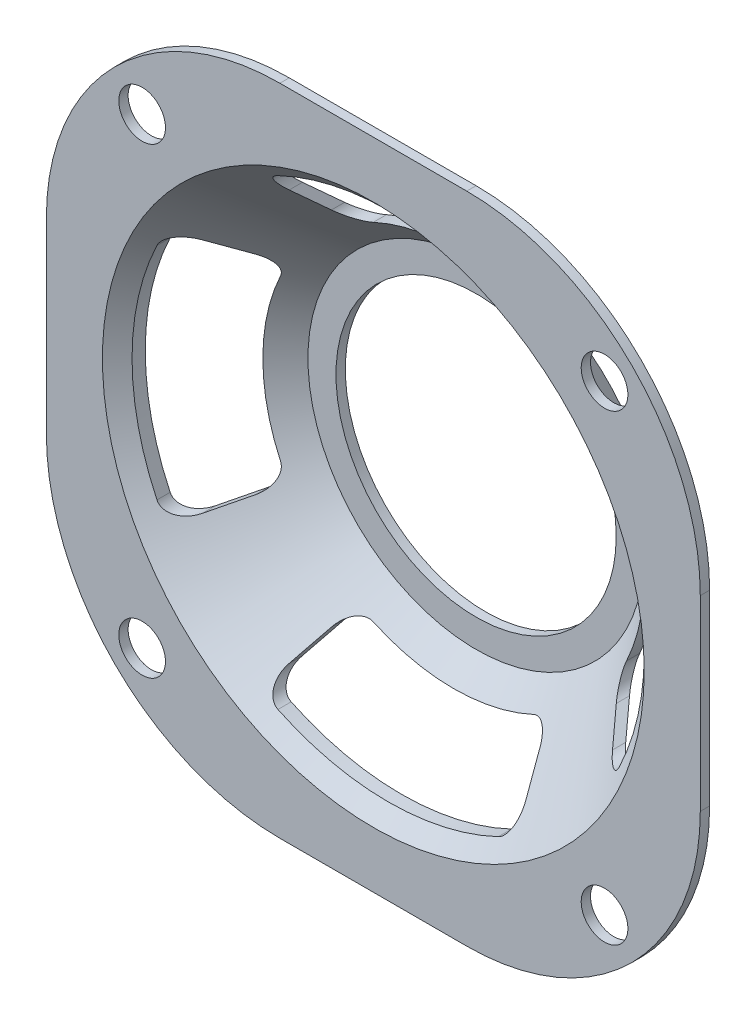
ISO-10303-21;
HEADER;
FILE_DESCRIPTION(('STEP AP214'),'2;1');
FILE_NAME('part.step','',(''),(''),'','','');
FILE_SCHEMA(('AUTOMOTIVE_DESIGN { 1 0 10303 214 1 1 1 1 }'));
ENDSEC;
DATA;
#1=APPLICATION_CONTEXT('core data for automotive mechanical design processes');
#2=APPLICATION_PROTOCOL_DEFINITION('international standard','automotive_design',2000,#1);
#3=PRODUCT_CONTEXT('',#1,'mechanical');
#4=PRODUCT('Part','Part','',(#3));
#5=PRODUCT_RELATED_PRODUCT_CATEGORY('part','',(#4));
#6=PRODUCT_DEFINITION_FORMATION('','',#4);
#7=PRODUCT_DEFINITION_CONTEXT('part definition',#1,'design');
#8=PRODUCT_DEFINITION('design','',#6,#7);
#9=PRODUCT_DEFINITION_SHAPE('','',#8);
#10=(LENGTH_UNIT() NAMED_UNIT(*) SI_UNIT(.MILLI.,.METRE.));
#11=(NAMED_UNIT(*) PLANE_ANGLE_UNIT() SI_UNIT($,.RADIAN.));
#12=(NAMED_UNIT(*) SI_UNIT($,.STERADIAN.) SOLID_ANGLE_UNIT());
#13=UNCERTAINTY_MEASURE_WITH_UNIT(LENGTH_MEASURE(1.E-05),#10,'distance_accuracy_value','');
#14=(GEOMETRIC_REPRESENTATION_CONTEXT(3) GLOBAL_UNCERTAINTY_ASSIGNED_CONTEXT((#13)) GLOBAL_UNIT_ASSIGNED_CONTEXT((#10,
#11,#12)) REPRESENTATION_CONTEXT('',''));
#15=CARTESIAN_POINT('',(0.,0.,0.));
#16=DIRECTION('',(0.,0.,1.));
#17=DIRECTION('',(1.,0.,0.));
#18=AXIS2_PLACEMENT_3D('',#15,#16,#17);
#19=CARTESIAN_POINT('',(-20.,20.,1.6836561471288));
#20=DIRECTION('',(0.,0.,1.));
#21=DIRECTION('',(1.,0.,0.));
#22=AXIS2_PLACEMENT_3D('',#19,#20,#21);
#23=CYLINDRICAL_SURFACE('',#22,50.);
#24=CARTESIAN_POINT('',(-20.,20.,3.6836561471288));
#25=DIRECTION('',(0.,0.,1.));
#26=DIRECTION('',(-1.,0.,0.));
#27=AXIS2_PLACEMENT_3D('',#24,#25,#26);
#28=CIRCLE('',#27,50.);
#29=CARTESIAN_POINT('',(-20.,70.,3.6836561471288));
#30=VERTEX_POINT('',#29);
#31=CARTESIAN_POINT('',(-70.,20.,3.6836561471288));
#32=VERTEX_POINT('',#31);
#33=EDGE_CURVE('E620',#30,#32,#28,.T.);
#34=ORIENTED_EDGE('',*,*,#33,.F.);
#35=DIRECTION('',(0.,0.,1.));
#36=VECTOR('',#35,1.);
#37=CARTESIAN_POINT('',(-20.,70.,1.6836561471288));
#38=LINE('',#37,#36);
#39=CARTESIAN_POINT('',(-20.,70.,1.6836561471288));
#40=VERTEX_POINT('',#39);
#41=EDGE_CURVE('E623',#40,#30,#38,.T.);
#42=ORIENTED_EDGE('',*,*,#41,.F.);
#43=CARTESIAN_POINT('',(-20.,20.,1.6836561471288));
#44=DIRECTION('',(0.,0.,1.));
#45=DIRECTION('',(-1.,0.,0.));
#46=AXIS2_PLACEMENT_3D('',#43,#44,#45);
#47=CIRCLE('',#46,50.);
#48=CARTESIAN_POINT('',(-70.,20.,1.6836561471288));
#49=VERTEX_POINT('',#48);
#50=EDGE_CURVE('E640',#40,#49,#47,.T.);
#51=ORIENTED_EDGE('',*,*,#50,.T.);
#52=DIRECTION('',(0.,0.,1.));
#53=VECTOR('',#52,1.);
#54=CARTESIAN_POINT('',(-70.,20.,1.6836561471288));
#55=LINE('',#54,#53);
#56=EDGE_CURVE('E625',#49,#32,#55,.T.);
#57=ORIENTED_EDGE('',*,*,#56,.T.);
#58=EDGE_LOOP('',(#34,#42,#51,#57));
#59=FACE_BOUND('',#58,.T.);
#60=ADVANCED_FACE('F38',(#59),#23,.T.);
#61=CARTESIAN_POINT('',(-20.,70.,1.6836561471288));
#62=DIRECTION('',(0.,1.,0.));
#63=DIRECTION('',(0.,0.,1.));
#64=AXIS2_PLACEMENT_3D('',#61,#62,#63);
#65=PLANE('',#64);
#66=DIRECTION('',(-1.,0.,0.));
#67=VECTOR('',#66,1.);
#68=CARTESIAN_POINT('',(-20.,70.,3.6836561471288));
#69=LINE('',#68,#67);
#70=CARTESIAN_POINT('',(20.,70.,3.6836561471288));
#71=VERTEX_POINT('',#70);
#72=EDGE_CURVE('E634',#71,#30,#69,.T.);
#73=ORIENTED_EDGE('',*,*,#72,.F.);
#74=DIRECTION('',(0.,0.,1.));
#75=VECTOR('',#74,1.);
#76=CARTESIAN_POINT('',(20.,70.,1.6836561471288));
#77=LINE('',#76,#75);
#78=CARTESIAN_POINT('',(20.,70.,1.6836561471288));
#79=VERTEX_POINT('',#78);
#80=EDGE_CURVE('E650',#79,#71,#77,.T.);
#81=ORIENTED_EDGE('',*,*,#80,.F.);
#82=DIRECTION('',(-1.,0.,0.));
#83=VECTOR('',#82,1.);
#84=CARTESIAN_POINT('',(-20.,70.,1.6836561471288));
#85=LINE('',#84,#83);
#86=EDGE_CURVE('E662',#79,#40,#85,.T.);
#87=ORIENTED_EDGE('',*,*,#86,.T.);
#88=ORIENTED_EDGE('',*,*,#41,.T.);
#89=EDGE_LOOP('',(#73,#81,#87,#88));
#90=FACE_BOUND('',#89,.T.);
#91=ADVANCED_FACE('F610',(#90),#65,.T.);
#92=CARTESIAN_POINT('',(20.,20.,1.6836561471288));
#93=DIRECTION('',(0.,0.,1.));
#94=DIRECTION('',(1.,0.,0.));
#95=AXIS2_PLACEMENT_3D('',#92,#93,#94);
#96=CYLINDRICAL_SURFACE('',#95,50.);
#97=CARTESIAN_POINT('',(20.,20.,3.6836561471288));
#98=DIRECTION('',(0.,0.,1.));
#99=DIRECTION('',(-1.,0.,0.));
#100=AXIS2_PLACEMENT_3D('',#97,#98,#99);
#101=CIRCLE('',#100,50.);
#102=CARTESIAN_POINT('',(70.,20.,3.6836561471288));
#103=VERTEX_POINT('',#102);
#104=EDGE_CURVE('E639',#103,#71,#101,.T.);
#105=ORIENTED_EDGE('',*,*,#104,.F.);
#106=DIRECTION('',(0.,0.,1.));
#107=VECTOR('',#106,1.);
#108=CARTESIAN_POINT('',(70.,20.,1.6836561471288));
#109=LINE('',#108,#107);
#110=CARTESIAN_POINT('',(70.,20.,1.6836561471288));
#111=VERTEX_POINT('',#110);
#112=EDGE_CURVE('E652',#111,#103,#109,.T.);
#113=ORIENTED_EDGE('',*,*,#112,.F.);
#114=CARTESIAN_POINT('',(20.,20.,1.6836561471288));
#115=DIRECTION('',(0.,0.,1.));
#116=DIRECTION('',(-1.,0.,0.));
#117=AXIS2_PLACEMENT_3D('',#114,#115,#116);
#118=CIRCLE('',#117,50.);
#119=EDGE_CURVE('E823',#111,#79,#118,.T.);
#120=ORIENTED_EDGE('',*,*,#119,.T.);
#121=ORIENTED_EDGE('',*,*,#80,.T.);
#122=EDGE_LOOP('',(#105,#113,#120,#121));
#123=FACE_BOUND('',#122,.T.);
#124=ADVANCED_FACE('F615',(#123),#96,.T.);
#125=CARTESIAN_POINT('',(70.,-20.,1.6836561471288));
#126=DIRECTION('',(1.,0.,0.));
#127=DIRECTION('',(0.,0.,-1.));
#128=AXIS2_PLACEMENT_3D('',#125,#126,#127);
#129=PLANE('',#128);
#130=DIRECTION('',(0.,1.,0.));
#131=VECTOR('',#130,1.);
#132=CARTESIAN_POINT('',(70.,-20.,3.6836561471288));
#133=LINE('',#132,#131);
#134=CARTESIAN_POINT('',(70.,-20.,3.6836561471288));
#135=VERTEX_POINT('',#134);
#136=EDGE_CURVE('E644',#135,#103,#133,.T.);
#137=ORIENTED_EDGE('',*,*,#136,.F.);
#138=DIRECTION('',(0.,0.,1.));
#139=VECTOR('',#138,1.);
#140=CARTESIAN_POINT('',(70.,-20.,1.6836561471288));
#141=LINE('',#140,#139);
#142=CARTESIAN_POINT('',(70.,-20.,1.6836561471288));
#143=VERTEX_POINT('',#142);
#144=EDGE_CURVE('E654',#143,#135,#141,.T.);
#145=ORIENTED_EDGE('',*,*,#144,.F.);
#146=DIRECTION('',(0.,1.,0.));
#147=VECTOR('',#146,1.);
#148=CARTESIAN_POINT('',(70.,-20.,1.6836561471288));
#149=LINE('',#148,#147);
#150=EDGE_CURVE('E820',#143,#111,#149,.T.);
#151=ORIENTED_EDGE('',*,*,#150,.T.);
#152=ORIENTED_EDGE('',*,*,#112,.T.);
#153=EDGE_LOOP('',(#137,#145,#151,#152));
#154=FACE_BOUND('',#153,.T.);
#155=ADVANCED_FACE('F840',(#154),#129,.T.);
#156=CARTESIAN_POINT('',(20.,-20.,1.6836561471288));
#157=DIRECTION('',(0.,0.,1.));
#158=DIRECTION('',(1.,0.,0.));
#159=AXIS2_PLACEMENT_3D('',#156,#157,#158);
#160=CYLINDRICAL_SURFACE('',#159,50.);
#161=CARTESIAN_POINT('',(20.,-20.,3.6836561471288));
#162=DIRECTION('',(0.,0.,1.));
#163=DIRECTION('',(1.,0.,0.));
#164=AXIS2_PLACEMENT_3D('',#161,#162,#163);
#165=CIRCLE('',#164,50.);
#166=CARTESIAN_POINT('',(20.,-70.,3.6836561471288));
#167=VERTEX_POINT('',#166);
#168=EDGE_CURVE('E835',#167,#135,#165,.T.);
#169=ORIENTED_EDGE('',*,*,#168,.F.);
#170=DIRECTION('',(0.,0.,1.));
#171=VECTOR('',#170,1.);
#172=CARTESIAN_POINT('',(20.,-70.,1.6836561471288));
#173=LINE('',#172,#171);
#174=CARTESIAN_POINT('',(20.,-70.,1.6836561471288));
#175=VERTEX_POINT('',#174);
#176=EDGE_CURVE('E656',#175,#167,#173,.T.);
#177=ORIENTED_EDGE('',*,*,#176,.F.);
#178=CARTESIAN_POINT('',(20.,-20.,1.6836561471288));
#179=DIRECTION('',(0.,0.,1.));
#180=DIRECTION('',(1.,0.,0.));
#181=AXIS2_PLACEMENT_3D('',#178,#179,#180);
#182=CIRCLE('',#181,50.);
#183=EDGE_CURVE('E817',#175,#143,#182,.T.);
#184=ORIENTED_EDGE('',*,*,#183,.T.);
#185=ORIENTED_EDGE('',*,*,#144,.T.);
#186=EDGE_LOOP('',(#169,#177,#184,#185));
#187=FACE_BOUND('',#186,.T.);
#188=ADVANCED_FACE('F860',(#187),#160,.T.);
#189=CARTESIAN_POINT('',(-20.,-70.,1.6836561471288));
#190=DIRECTION('',(0.,-1.,0.));
#191=DIRECTION('',(0.,0.,-1.));
#192=AXIS2_PLACEMENT_3D('',#189,#190,#191);
#193=PLANE('',#192);
#194=DIRECTION('',(1.,0.,0.));
#195=VECTOR('',#194,1.);
#196=CARTESIAN_POINT('',(-20.,-70.,3.6836561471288));
#197=LINE('',#196,#195);
#198=CARTESIAN_POINT('',(-20.,-70.,3.6836561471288));
#199=VERTEX_POINT('',#198);
#200=EDGE_CURVE('E832',#199,#167,#197,.T.);
#201=ORIENTED_EDGE('',*,*,#200,.F.);
#202=DIRECTION('',(0.,0.,1.));
#203=VECTOR('',#202,1.);
#204=CARTESIAN_POINT('',(-20.,-70.,1.6836561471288));
#205=LINE('',#204,#203);
#206=CARTESIAN_POINT('',(-20.,-70.,1.6836561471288));
#207=VERTEX_POINT('',#206);
#208=EDGE_CURVE('E658',#207,#199,#205,.T.);
#209=ORIENTED_EDGE('',*,*,#208,.F.);
#210=DIRECTION('',(1.,0.,0.));
#211=VECTOR('',#210,1.);
#212=CARTESIAN_POINT('',(-20.,-70.,1.6836561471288));
#213=LINE('',#212,#211);
#214=EDGE_CURVE('E814',#207,#175,#213,.T.);
#215=ORIENTED_EDGE('',*,*,#214,.T.);
#216=ORIENTED_EDGE('',*,*,#176,.T.);
#217=EDGE_LOOP('',(#201,#209,#215,#216));
#218=FACE_BOUND('',#217,.T.);
#219=ADVANCED_FACE('F857',(#218),#193,.T.);
#220=CARTESIAN_POINT('',(-20.,-20.,1.6836561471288));
#221=DIRECTION('',(0.,0.,1.));
#222=DIRECTION('',(1.,0.,0.));
#223=AXIS2_PLACEMENT_3D('',#220,#221,#222);
#224=CYLINDRICAL_SURFACE('',#223,50.);
#225=CARTESIAN_POINT('',(-20.,-20.,3.6836561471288));
#226=DIRECTION('',(0.,0.,1.));
#227=DIRECTION('',(-1.,0.,0.));
#228=AXIS2_PLACEMENT_3D('',#225,#226,#227);
#229=CIRCLE('',#228,50.);
#230=CARTESIAN_POINT('',(-70.,-20.,3.6836561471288));
#231=VERTEX_POINT('',#230);
#232=EDGE_CURVE('E829',#231,#199,#229,.T.);
#233=ORIENTED_EDGE('',*,*,#232,.F.);
#234=DIRECTION('',(0.,0.,1.));
#235=VECTOR('',#234,1.);
#236=CARTESIAN_POINT('',(-70.,-20.,1.6836561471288));
#237=LINE('',#236,#235);
#238=CARTESIAN_POINT('',(-70.,-20.,1.6836561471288));
#239=VERTEX_POINT('',#238);
#240=EDGE_CURVE('E660',#239,#231,#237,.T.);
#241=ORIENTED_EDGE('',*,*,#240,.F.);
#242=CARTESIAN_POINT('',(-20.,-20.,1.6836561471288));
#243=DIRECTION('',(0.,0.,1.));
#244=DIRECTION('',(-1.,0.,0.));
#245=AXIS2_PLACEMENT_3D('',#242,#243,#244);
#246=CIRCLE('',#245,50.);
#247=EDGE_CURVE('E811',#239,#207,#246,.T.);
#248=ORIENTED_EDGE('',*,*,#247,.T.);
#249=ORIENTED_EDGE('',*,*,#208,.T.);
#250=EDGE_LOOP('',(#233,#241,#248,#249));
#251=FACE_BOUND('',#250,.T.);
#252=ADVANCED_FACE('F855',(#251),#224,.T.);
#253=CARTESIAN_POINT('',(-70.,-20.,1.6836561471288));
#254=DIRECTION('',(-1.,0.,0.));
#255=DIRECTION('',(0.,0.,1.));
#256=AXIS2_PLACEMENT_3D('',#253,#254,#255);
#257=PLANE('',#256);
#258=DIRECTION('',(0.,-1.,0.));
#259=VECTOR('',#258,1.);
#260=CARTESIAN_POINT('',(-70.,-20.,3.6836561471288));
#261=LINE('',#260,#259);
#262=EDGE_CURVE('E629',#32,#231,#261,.T.);
#263=ORIENTED_EDGE('',*,*,#262,.F.);
#264=ORIENTED_EDGE('',*,*,#56,.F.);
#265=DIRECTION('',(0.,-1.,0.));
#266=VECTOR('',#265,1.);
#267=CARTESIAN_POINT('',(-70.,-20.,1.6836561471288));
#268=LINE('',#267,#266);
#269=EDGE_CURVE('E642',#49,#239,#268,.T.);
#270=ORIENTED_EDGE('',*,*,#269,.T.);
#271=ORIENTED_EDGE('',*,*,#240,.T.);
#272=EDGE_LOOP('',(#263,#264,#270,#271));
#273=FACE_BOUND('',#272,.T.);
#274=ADVANCED_FACE('F851',(#273),#257,.T.);
#275=CARTESIAN_POINT('',(-20.,20.,1.6836561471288));
#276=DIRECTION('',(0.,0.,-1.));
#277=DIRECTION('',(-1.,0.,0.));
#278=AXIS2_PLACEMENT_3D('',#275,#276,#277);
#279=PLANE('',#278);
#280=CARTESIAN_POINT('',(49.4974746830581,-49.4974746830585,1.6836561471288));
#281=DIRECTION('',(0.,0.,-1.));
#282=DIRECTION('',(-1.,0.,0.));
#283=AXIS2_PLACEMENT_3D('',#280,#281,#282);
#284=CIRCLE('',#283,5.);
#285=CARTESIAN_POINT('',(44.4974746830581,-49.4974746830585,1.6836561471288));
#286=VERTEX_POINT('',#285);
#287=EDGE_CURVE('E786',#286,#286,#284,.T.);
#288=ORIENTED_EDGE('',*,*,#287,.F.);
#289=EDGE_LOOP('',(#288));
#290=FACE_BOUND('',#289,.T.);
#291=CARTESIAN_POINT('',(-49.4974746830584,-49.4974746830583,1.6836561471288));
#292=DIRECTION('',(0.,0.,-1.));
#293=DIRECTION('',(-1.,0.,0.));
#294=AXIS2_PLACEMENT_3D('',#291,#292,#293);
#295=CIRCLE('',#294,5.);
#296=CARTESIAN_POINT('',(-54.4974746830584,-49.4974746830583,1.6836561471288));
#297=VERTEX_POINT('',#296);
#298=EDGE_CURVE('E790',#297,#297,#295,.T.);
#299=ORIENTED_EDGE('',*,*,#298,.F.);
#300=EDGE_LOOP('',(#299));
#301=FACE_BOUND('',#300,.T.);
#302=CARTESIAN_POINT('',(-49.4974746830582,49.4974746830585,1.6836561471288));
#303=DIRECTION('',(0.,0.,-1.));
#304=DIRECTION('',(-1.,0.,0.));
#305=AXIS2_PLACEMENT_3D('',#302,#303,#304);
#306=CIRCLE('',#305,5.);
#307=CARTESIAN_POINT('',(-54.4974746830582,49.4974746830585,1.6836561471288));
#308=VERTEX_POINT('',#307);
#309=EDGE_CURVE('E796',#308,#308,#306,.T.);
#310=ORIENTED_EDGE('',*,*,#309,.F.);
#311=EDGE_LOOP('',(#310));
#312=FACE_BOUND('',#311,.T.);
#313=CARTESIAN_POINT('',(49.4974746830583,49.4974746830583,1.6836561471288));
#314=DIRECTION('',(0.,0.,-1.));
#315=DIRECTION('',(-1.,0.,0.));
#316=AXIS2_PLACEMENT_3D('',#313,#314,#315);
#317=CIRCLE('',#316,5.);
#318=CARTESIAN_POINT('',(44.4974746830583,49.4974746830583,1.6836561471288));
#319=VERTEX_POINT('',#318);
#320=EDGE_CURVE('E802',#319,#319,#317,.T.);
#321=ORIENTED_EDGE('',*,*,#320,.F.);
#322=EDGE_LOOP('',(#321));
#323=FACE_BOUND('',#322,.T.);
#324=ORIENTED_EDGE('',*,*,#50,.F.);
#325=ORIENTED_EDGE('',*,*,#86,.F.);
#326=ORIENTED_EDGE('',*,*,#119,.F.);
#327=ORIENTED_EDGE('',*,*,#150,.F.);
#328=ORIENTED_EDGE('',*,*,#183,.F.);
#329=ORIENTED_EDGE('',*,*,#214,.F.);
#330=ORIENTED_EDGE('',*,*,#247,.F.);
#331=ORIENTED_EDGE('',*,*,#269,.F.);
#332=EDGE_LOOP('',(#324,#325,#326,#327,#328,#329,#330,#331));
#333=FACE_BOUND('',#332,.T.);
#334=CARTESIAN_POINT('',(0.,0.,1.6836561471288));
#335=DIRECTION('',(0.,0.,1.));
#336=DIRECTION('',(1.,0.,0.));
#337=AXIS2_PLACEMENT_3D('',#334,#335,#336);
#338=CIRCLE('',#337,58.8284271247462);
#339=CARTESIAN_POINT('',(58.8284271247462,0.,1.6836561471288));
#340=VERTEX_POINT('',#339);
#341=EDGE_CURVE('E773',#340,#340,#338,.T.);
#342=ORIENTED_EDGE('',*,*,#341,.T.);
#343=EDGE_LOOP('',(#342));
#344=FACE_BOUND('',#343,.T.);
#345=ADVANCED_FACE('F846',(#290,#301,#312,#323,#333,#344),#279,.T.);
#346=CARTESIAN_POINT('',(-20.,20.,3.6836561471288));
#347=DIRECTION('',(0.,0.,-1.));
#348=DIRECTION('',(-1.,0.,0.));
#349=AXIS2_PLACEMENT_3D('',#346,#347,#348);
#350=PLANE('',#349);
#351=CARTESIAN_POINT('',(49.4974746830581,-49.4974746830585,3.6836561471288));
#352=DIRECTION('',(0.,0.,-1.));
#353=DIRECTION('',(-1.,0.,0.));
#354=AXIS2_PLACEMENT_3D('',#351,#352,#353);
#355=CIRCLE('',#354,5.);
#356=CARTESIAN_POINT('',(44.4974746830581,-49.4974746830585,3.6836561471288));
#357=VERTEX_POINT('',#356);
#358=EDGE_CURVE('E787',#357,#357,#355,.T.);
#359=ORIENTED_EDGE('',*,*,#358,.T.);
#360=EDGE_LOOP('',(#359));
#361=FACE_BOUND('',#360,.T.);
#362=CARTESIAN_POINT('',(-49.4974746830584,-49.4974746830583,3.6836561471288));
#363=DIRECTION('',(0.,0.,-1.));
#364=DIRECTION('',(-1.,0.,0.));
#365=AXIS2_PLACEMENT_3D('',#362,#363,#364);
#366=CIRCLE('',#365,5.);
#367=CARTESIAN_POINT('',(-54.4974746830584,-49.4974746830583,3.6836561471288));
#368=VERTEX_POINT('',#367);
#369=EDGE_CURVE('E793',#368,#368,#366,.T.);
#370=ORIENTED_EDGE('',*,*,#369,.T.);
#371=EDGE_LOOP('',(#370));
#372=FACE_BOUND('',#371,.T.);
#373=CARTESIAN_POINT('',(-49.4974746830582,49.4974746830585,3.6836561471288));
#374=DIRECTION('',(0.,0.,-1.));
#375=DIRECTION('',(-1.,0.,0.));
#376=AXIS2_PLACEMENT_3D('',#373,#374,#375);
#377=CIRCLE('',#376,5.);
#378=CARTESIAN_POINT('',(-54.4974746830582,49.4974746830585,3.6836561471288));
#379=VERTEX_POINT('',#378);
#380=EDGE_CURVE('E799',#379,#379,#377,.T.);
#381=ORIENTED_EDGE('',*,*,#380,.T.);
#382=EDGE_LOOP('',(#381));
#383=FACE_BOUND('',#382,.T.);
#384=CARTESIAN_POINT('',(49.4974746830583,49.4974746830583,3.6836561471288));
#385=DIRECTION('',(0.,0.,-1.));
#386=DIRECTION('',(-1.,0.,0.));
#387=AXIS2_PLACEMENT_3D('',#384,#385,#386);
#388=CIRCLE('',#387,5.);
#389=CARTESIAN_POINT('',(44.4974746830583,49.4974746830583,3.6836561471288));
#390=VERTEX_POINT('',#389);
#391=EDGE_CURVE('E630',#390,#390,#388,.T.);
#392=ORIENTED_EDGE('',*,*,#391,.T.);
#393=EDGE_LOOP('',(#392));
#394=FACE_BOUND('',#393,.T.);
#395=ORIENTED_EDGE('',*,*,#33,.T.);
#396=ORIENTED_EDGE('',*,*,#262,.T.);
#397=ORIENTED_EDGE('',*,*,#232,.T.);
#398=ORIENTED_EDGE('',*,*,#200,.T.);
#399=ORIENTED_EDGE('',*,*,#168,.T.);
#400=ORIENTED_EDGE('',*,*,#136,.T.);
#401=ORIENTED_EDGE('',*,*,#104,.T.);
#402=ORIENTED_EDGE('',*,*,#72,.T.);
#403=EDGE_LOOP('',(#395,#396,#397,#398,#399,#400,#401,#402));
#404=FACE_BOUND('',#403,.T.);
#405=CARTESIAN_POINT('',(0.,0.,3.6836561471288));
#406=DIRECTION('',(0.,0.,1.));
#407=DIRECTION('',(1.,0.,0.));
#408=AXIS2_PLACEMENT_3D('',#405,#406,#407);
#409=CIRCLE('',#408,58.);
#410=CARTESIAN_POINT('',(58.,0.,3.6836561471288));
#411=VERTEX_POINT('',#410);
#412=EDGE_CURVE('E775',#411,#411,#409,.T.);
#413=ORIENTED_EDGE('',*,*,#412,.F.);
#414=EDGE_LOOP('',(#413));
#415=FACE_BOUND('',#414,.T.);
#416=ADVANCED_FACE('F635',(#361,#372,#383,#394,#404,#415),#350,.F.);
#417=CARTESIAN_POINT('',(49.4974746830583,49.4974746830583,3.6836561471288));
#418=DIRECTION('',(0.,0.,-1.));
#419=DIRECTION('',(-1.,0.,0.));
#420=AXIS2_PLACEMENT_3D('',#417,#418,#419);
#421=CYLINDRICAL_SURFACE('',#420,5.);
#422=ORIENTED_EDGE('',*,*,#391,.F.);
#423=EDGE_LOOP('',(#422));
#424=FACE_BOUND('',#423,.T.);
#425=ORIENTED_EDGE('',*,*,#320,.T.);
#426=EDGE_LOOP('',(#425));
#427=FACE_BOUND('',#426,.T.);
#428=ADVANCED_FACE('F881',(#424,#427),#421,.F.);
#429=CARTESIAN_POINT('',(-49.4974746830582,49.4974746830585,3.6836561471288));
#430=DIRECTION('',(0.,0.,-1.));
#431=DIRECTION('',(-1.,0.,0.));
#432=AXIS2_PLACEMENT_3D('',#429,#430,#431);
#433=CYLINDRICAL_SURFACE('',#432,5.);
#434=ORIENTED_EDGE('',*,*,#380,.F.);
#435=EDGE_LOOP('',(#434));
#436=FACE_BOUND('',#435,.T.);
#437=ORIENTED_EDGE('',*,*,#309,.T.);
#438=EDGE_LOOP('',(#437));
#439=FACE_BOUND('',#438,.T.);
#440=ADVANCED_FACE('F940',(#436,#439),#433,.F.);
#441=CARTESIAN_POINT('',(-49.4974746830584,-49.4974746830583,3.6836561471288));
#442=DIRECTION('',(0.,0.,-1.));
#443=DIRECTION('',(-1.,0.,0.));
#444=AXIS2_PLACEMENT_3D('',#441,#442,#443);
#445=CYLINDRICAL_SURFACE('',#444,5.);
#446=ORIENTED_EDGE('',*,*,#369,.F.);
#447=EDGE_LOOP('',(#446));
#448=FACE_BOUND('',#447,.T.);
#449=ORIENTED_EDGE('',*,*,#298,.T.);
#450=EDGE_LOOP('',(#449));
#451=FACE_BOUND('',#450,.T.);
#452=ADVANCED_FACE('F949',(#448,#451),#445,.F.);
#453=CARTESIAN_POINT('',(49.4974746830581,-49.4974746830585,3.6836561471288));
#454=DIRECTION('',(0.,0.,-1.));
#455=DIRECTION('',(-1.,0.,0.));
#456=AXIS2_PLACEMENT_3D('',#453,#454,#455);
#457=CYLINDRICAL_SURFACE('',#456,5.);
#458=ORIENTED_EDGE('',*,*,#358,.F.);
#459=EDGE_LOOP('',(#458));
#460=FACE_BOUND('',#459,.T.);
#461=ORIENTED_EDGE('',*,*,#287,.T.);
#462=EDGE_LOOP('',(#461));
#463=FACE_BOUND('',#462,.T.);
#464=ADVANCED_FACE('F958',(#460,#463),#457,.F.);
#465=CARTESIAN_POINT('',(0.,35.9999999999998,-18.3163438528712));
#466=DIRECTION('',(0.,0.,-1.));
#467=DIRECTION('',(-1.,0.,0.));
#468=AXIS2_PLACEMENT_3D('',#465,#466,#467);
#469=PLANE('',#468);
#470=CARTESIAN_POINT('',(0.,0.,-18.3163438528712));
#471=DIRECTION('',(0.,0.,1.));
#472=DIRECTION('',(1.,0.,0.));
#473=AXIS2_PLACEMENT_3D('',#470,#471,#472);
#474=CIRCLE('',#473,29.9999999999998);
#475=CARTESIAN_POINT('',(29.9999999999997,0.,-18.3163438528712));
#476=VERTEX_POINT('',#475);
#477=EDGE_CURVE('E1300',#476,#476,#474,.T.);
#478=ORIENTED_EDGE('',*,*,#477,.F.);
#479=EDGE_LOOP('',(#478));
#480=FACE_BOUND('',#479,.T.);
#481=CARTESIAN_POINT('',(0.,0.,-18.3163438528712));
#482=DIRECTION('',(0.,0.,1.));
#483=DIRECTION('',(1.,0.,0.));
#484=AXIS2_PLACEMENT_3D('',#481,#482,#483);
#485=CIRCLE('',#484,35.9999999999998);
#486=CARTESIAN_POINT('',(35.9999999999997,0.,-18.3163438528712));
#487=VERTEX_POINT('',#486);
#488=EDGE_CURVE('E778',#487,#487,#485,.T.);
#489=ORIENTED_EDGE('',*,*,#488,.T.);
#490=EDGE_LOOP('',(#489));
#491=FACE_BOUND('',#490,.T.);
#492=ADVANCED_FACE('F967',(#480,#491),#469,.F.);
#493=CARTESIAN_POINT('',(0.,0.,3.6836561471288));
#494=DIRECTION('',(0.,0.,1.));
#495=DIRECTION('',(1.,0.,0.));
#496=AXIS2_PLACEMENT_3D('',#493,#494,#495);
#497=CONICAL_SURFACE('',#496,58.,0.785398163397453);
#498=CARTESIAN_POINT('',(0.,0.,0.512083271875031));
#499=DIRECTION('',(0.,0.,1.));
#500=DIRECTION('',(1.,0.,0.));
#501=AXIS2_PLACEMENT_3D('',#498,#499,#500);
#502=CIRCLE('',#501,54.8284271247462);
#503=CARTESIAN_POINT('',(-49.4929422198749,-23.5924795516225,0.512083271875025));
#504=VERTEX_POINT('',#503);
#505=CARTESIAN_POINT('',(-49.4929422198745,23.5924795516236,0.512083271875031));
#506=VERTEX_POINT('',#505);
#507=EDGE_CURVE('E316',#504,#506,#502,.F.);
#508=ORIENTED_EDGE('',*,*,#507,.T.);
#509=CARTESIAN_POINT('',(-49.4931328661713,23.5920795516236,0.512083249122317));
#510=CARTESIAN_POINT('',(-49.453850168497,23.6745612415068,0.512111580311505));
#511=CARTESIAN_POINT('',(-49.4117103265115,23.7556648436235,0.509201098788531));
#512=CARTESIAN_POINT('',(-49.3222166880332,23.9144487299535,0.497648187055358));
#513=CARTESIAN_POINT('',(-49.2748663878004,23.9921312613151,0.489009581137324));
#514=CARTESIAN_POINT('',(-49.1757753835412,24.1429439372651,0.46623238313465));
#515=CARTESIAN_POINT('',(-49.1240706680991,24.2161041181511,0.452135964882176));
#516=CARTESIAN_POINT('',(-49.0165256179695,24.3580367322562,0.418709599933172));
#517=CARTESIAN_POINT('',(-48.9606847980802,24.4268086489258,0.399379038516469));
#518=CARTESIAN_POINT('',(-48.7880854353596,24.6256440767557,0.334098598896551));
#519=CARTESIAN_POINT('',(-48.66591502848,24.7487310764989,0.280780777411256));
#520=CARTESIAN_POINT('',(-48.411610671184,24.9747022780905,0.157452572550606));
#521=CARTESIAN_POINT('',(-48.2794571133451,25.0775452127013,0.087408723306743));
#522=CARTESIAN_POINT('',(-47.9595596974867,25.2968754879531,-0.0944649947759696));
#523=CARTESIAN_POINT('',(-47.769157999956,25.4046020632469,-0.212209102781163));
#524=CARTESIAN_POINT('',(-47.3843268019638,25.5846390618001,-0.466375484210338));
#525=CARTESIAN_POINT('',(-47.1898916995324,25.6568962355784,-0.602825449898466));
#526=CARTESIAN_POINT('',(-46.7331735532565,25.7892721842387,-0.939957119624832));
#527=CARTESIAN_POINT('',(-46.4711823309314,25.8360896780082,-1.14630335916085));
#528=CARTESIAN_POINT('',(-46.0851069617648,25.8682419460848,-1.46752224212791));
#529=CARTESIAN_POINT('',(-45.9573298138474,25.8725853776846,-1.57676491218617));
#530=CARTESIAN_POINT('',(-45.7046734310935,25.8693467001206,-1.79837971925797));
#531=CARTESIAN_POINT('',(-45.5797933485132,25.8617681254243,-1.91075091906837));
#532=CARTESIAN_POINT('',(-45.3139179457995,25.8333230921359,-2.15593300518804));
#533=CARTESIAN_POINT('',(-45.1735120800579,25.8105379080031,-2.28915638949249));
#534=CARTESIAN_POINT('',(-44.8979676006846,25.7508776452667,-2.55793007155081));
#535=CARTESIAN_POINT('',(-44.762830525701,25.713998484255,-2.6934810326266));
#536=CARTESIAN_POINT('',(-44.4995944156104,25.6272862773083,-2.96489906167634));
#537=CARTESIAN_POINT('',(-44.3714455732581,25.5775652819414,-3.10075378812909));
#538=CARTESIAN_POINT('',(-44.1216369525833,25.4656102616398,-3.37308004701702));
#539=CARTESIAN_POINT('',(-43.999972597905,25.4033852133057,-3.50955106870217));
#540=CARTESIAN_POINT('',(-43.8817917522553,25.3351642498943,-3.64601530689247));
#541=B_SPLINE_CURVE_WITH_KNOTS('',3,(#509,#510,#511,#512,#513,#514,#515,#516,#517,#518,#519,
#520,#521,#522,#523,#524,#525,#526,#527,#528,#529,#530,#531,#532,#533,#534,#535,#536,#537,#538,
#539,#540),.UNSPECIFIED.,.F.,.F.,(4,2,2,2,2,2,2,2,2,2,2,2,2,2,2,4),(0.,0.273949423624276,
0.54771613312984,0.819408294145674,1.09113237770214,1.63277439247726,2.17550935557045,
2.9166931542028,3.65898629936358,4.66345619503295,5.1676196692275,5.6716337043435,
6.25567228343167,6.839880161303,7.41915333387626,7.99801212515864),.UNSPECIFIED.);
#542=CARTESIAN_POINT('',(-43.8821917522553,25.335395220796,-3.64555341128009));
#543=VERTEX_POINT('',#542);
#544=EDGE_CURVE('E307',#506,#543,#541,.T.);
#545=ORIENTED_EDGE('',*,*,#544,.T.);
#546=DIRECTION('',(-0.612372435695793,0.353553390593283,0.707106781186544));
#547=VECTOR('',#546,1.);
#548=CARTESIAN_POINT('',(0.,0.,-54.3163438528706));
#549=LINE('',#548,#547);
#550=CARTESIAN_POINT('',(-38.667698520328,22.3248061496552,-9.66673155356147));
#551=VERTEX_POINT('',#550);
#552=EDGE_CURVE('E296',#543,#551,#549,.F.);
#553=ORIENTED_EDGE('',*,*,#552,.T.);
#554=CARTESIAN_POINT('',(-38.668098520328,22.325037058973,-9.6662696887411));
#555=CARTESIAN_POINT('',(-38.535767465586,22.2486035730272,-9.81907652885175));
#556=CARTESIAN_POINT('',(-38.4077631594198,22.1646571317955,-9.97191610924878));
#557=CARTESIAN_POINT('',(-38.1612603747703,21.9818343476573,-10.2767907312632));
#558=CARTESIAN_POINT('',(-38.0427767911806,21.8829352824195,-10.4288241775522));
#559=CARTESIAN_POINT('',(-37.8153847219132,21.6694165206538,-10.7323366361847));
#560=CARTESIAN_POINT('',(-37.7065907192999,21.5546416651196,-10.8837927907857));
#561=CARTESIAN_POINT('',(-37.5014920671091,21.3103089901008,-11.1829679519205));
#562=CARTESIAN_POINT('',(-37.4051781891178,21.1807622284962,-11.330689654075));
#563=CARTESIAN_POINT('',(-37.19674725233,20.8607615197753,-11.6694325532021));
#564=CARTESIAN_POINT('',(-37.0901334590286,20.6644359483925,-11.8583941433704));
#565=CARTESIAN_POINT('',(-36.9080764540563,20.245340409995,-12.220494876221));
#566=CARTESIAN_POINT('',(-36.8325250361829,20.0226657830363,-12.3936872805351));
#567=CARTESIAN_POINT('',(-36.7353484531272,19.6144143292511,-12.6726932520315));
#568=CARTESIAN_POINT('',(-36.7047014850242,19.4348640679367,-12.7841325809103));
#569=CARTESIAN_POINT('',(-36.6684783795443,19.0631387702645,-12.9889163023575));
#570=CARTESIAN_POINT('',(-36.6628759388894,18.8709771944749,-13.0822795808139));
#571=CARTESIAN_POINT('',(-36.6792980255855,18.5186915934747,-13.2275048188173));
#572=CARTESIAN_POINT('',(-36.6958175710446,18.3602192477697,-13.2839598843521));
#573=CARTESIAN_POINT('',(-36.7492314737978,18.0411863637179,-13.3777722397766));
#574=CARTESIAN_POINT('',(-36.7860786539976,17.8806314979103,-13.4151733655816));
#575=CARTESIAN_POINT('',(-36.8607540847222,17.6292592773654,-13.4568660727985));
#576=CARTESIAN_POINT('',(-36.8916486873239,17.5375184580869,-13.4684672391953));
#577=CARTESIAN_POINT('',(-36.9602975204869,17.3558234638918,-13.4840192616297));
#578=CARTESIAN_POINT('',(-36.9980618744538,17.2658721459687,-13.48795872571));
#579=CARTESIAN_POINT('',(-37.0391421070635,17.1773809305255,-13.4879167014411));
#580=B_SPLINE_CURVE_WITH_KNOTS('',3,(#554,#555,#556,#557,#558,#559,#560,#561,#562,#563,#564,
#565,#566,#567,#568,#569,#570,#571,#572,#573,#574,#575,#576,#577,#578,#579),.UNSPECIFIED.,.F.,
.F.,(4,2,2,2,2,2,2,2,2,2,2,2,4),(0.,0.648200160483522,1.29739542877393,1.95345466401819,
2.60902597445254,3.4840589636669,4.35601739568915,4.99455202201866,5.63241586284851,
6.13757990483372,6.64157644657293,6.93355133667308,7.22596002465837),.UNSPECIFIED.);
#581=CARTESIAN_POINT('',(-37.0389565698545,17.1777809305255,-13.4879167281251));
#582=VERTEX_POINT('',#581);
#583=EDGE_CURVE('E301',#551,#582,#580,.T.);
#584=ORIENTED_EDGE('',*,*,#583,.T.);
#585=CARTESIAN_POINT('',(0.,0.,-13.4879167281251));
#586=DIRECTION('',(0.,0.,1.));
#587=DIRECTION('',(1.,0.,0.));
#588=AXIS2_PLACEMENT_3D('',#585,#586,#587);
#589=CIRCLE('',#588,40.828427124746);
#590=CARTESIAN_POINT('',(-37.0389565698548,-17.1777809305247,-13.4879167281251));
#591=VERTEX_POINT('',#590);
#592=EDGE_CURVE('E553',#582,#591,#589,.T.);
#593=ORIENTED_EDGE('',*,*,#592,.T.);
#594=CARTESIAN_POINT('',(-37.0391421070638,-17.1773809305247,-13.4879167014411));
#595=CARTESIAN_POINT('',(-37.0022141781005,-17.2569261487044,-13.4879548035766));
#596=CARTESIAN_POINT('',(-36.9679531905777,-17.3376865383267,-13.4847721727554));
#597=CARTESIAN_POINT('',(-36.904963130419,-17.5007758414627,-13.4721772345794));
#598=CARTESIAN_POINT('',(-36.8762287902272,-17.583103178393,-13.4627708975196));
#599=CARTESIAN_POINT('',(-36.8246702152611,-17.7478163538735,-13.4380601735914));
#600=CARTESIAN_POINT('',(-36.8017913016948,-17.830193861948,-13.4228139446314));
#601=CARTESIAN_POINT('',(-36.7615624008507,-17.9950764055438,-13.3867902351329));
#602=CARTESIAN_POINT('',(-36.744213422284,-18.0775814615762,-13.3660117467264));
#603=CARTESIAN_POINT('',(-36.7004260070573,-18.3236982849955,-13.2961814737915));
#604=CARTESIAN_POINT('',(-36.682015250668,-18.4866691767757,-13.2395155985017));
#605=CARTESIAN_POINT('',(-36.6648194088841,-18.807104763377,-13.1096152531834));
#606=CARTESIAN_POINT('',(-36.666086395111,-18.9645537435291,-13.0363373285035));
#607=CARTESIAN_POINT('',(-36.69049629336,-19.3430577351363,-12.8397342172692));
#608=CARTESIAN_POINT('',(-36.7235449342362,-19.5596156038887,-12.7089880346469));
#609=CARTESIAN_POINT('',(-36.8195818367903,-19.9730153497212,-12.4286674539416));
#610=CARTESIAN_POINT('',(-36.8826330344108,-20.1698147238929,-12.2790539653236));
#611=CARTESIAN_POINT('',(-37.0113657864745,-20.4891063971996,-12.0122471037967));
#612=CARTESIAN_POINT('',(-37.0710671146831,-20.6166828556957,-11.8981165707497));
#613=CARTESIAN_POINT('',(-37.2013124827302,-20.8615579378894,-11.6650064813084));
#614=CARTESIAN_POINT('',(-37.2718615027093,-20.9788518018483,-11.5460247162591));
#615=CARTESIAN_POINT('',(-37.4226012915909,-21.2032738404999,-11.3044125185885));
#616=CARTESIAN_POINT('',(-37.5028015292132,-21.3103918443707,-11.1817785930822));
#617=CARTESIAN_POINT('',(-37.6717564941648,-21.5143556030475,-10.9340138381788));
#618=CARTESIAN_POINT('',(-37.7605087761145,-21.6112042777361,-10.8088837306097));
#619=CARTESIAN_POINT('',(-37.9766178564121,-21.8252068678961,-10.5149612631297));
#620=CARTESIAN_POINT('',(-38.1069990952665,-21.9384062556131,-10.3454840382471));
#621=CARTESIAN_POINT('',(-38.3113077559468,-22.0940773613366,-10.0907351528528));
#622=CARTESIAN_POINT('',(-38.3806731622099,-22.1435015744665,-10.0059534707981));
#623=CARTESIAN_POINT('',(-38.5222709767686,-22.2377394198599,-9.83620901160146));
#624=CARTESIAN_POINT('',(-38.5945035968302,-22.2825527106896,-9.75124622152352));
#625=CARTESIAN_POINT('',(-38.6680985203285,-22.3250370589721,-9.6662696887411));
#626=B_SPLINE_CURVE_WITH_KNOTS('',3,(#594,#595,#596,#597,#598,#599,#600,#601,#602,#603,#604,
#605,#606,#607,#608,#609,#610,#611,#612,#613,#614,#615,#616,#617,#618,#619,#620,#621,#622,#623,
#624,#625),.UNSPECIFIED.,.F.,.F.,(4,2,2,2,2,2,2,2,2,2,2,2,2,2,2,4),(0.,0.262957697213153,
0.525663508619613,0.785818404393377,1.04602072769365,1.56405506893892,2.08346047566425,
2.84457453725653,3.60729226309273,4.15048509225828,4.69392804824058,5.23790858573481,
5.78173403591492,6.5063665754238,6.86679373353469,7.22724756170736),.UNSPECIFIED.);
#627=CARTESIAN_POINT('',(-38.6676985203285,-22.3248061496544,-9.66673155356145));
#628=VERTEX_POINT('',#627);
#629=EDGE_CURVE('E546',#591,#628,#626,.T.);
#630=ORIENTED_EDGE('',*,*,#629,.T.);
#631=DIRECTION('',(0.612372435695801,0.35355339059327,-0.707106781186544));
#632=VECTOR('',#631,1.);
#633=CARTESIAN_POINT('',(0.,0.,-54.3163438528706));
#634=LINE('',#633,#632);
#635=CARTESIAN_POINT('',(-43.8821917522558,-25.3353952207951,-3.64555341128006));
#636=VERTEX_POINT('',#635);
#637=EDGE_CURVE('E543',#628,#636,#634,.F.);
#638=ORIENTED_EDGE('',*,*,#637,.T.);
#639=CARTESIAN_POINT('',(-43.8817917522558,-25.3351642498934,-3.64601530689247));
#640=CARTESIAN_POINT('',(-44.0145759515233,-25.4118009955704,-3.49269271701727));
#641=CARTESIAN_POINT('',(-44.1517535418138,-25.4808860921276,-3.33936030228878));
#642=CARTESIAN_POINT('',(-44.4342709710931,-25.60322918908,-3.03350845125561));
#643=CARTESIAN_POINT('',(-44.5796212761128,-25.6564663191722,-2.88099034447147));
#644=CARTESIAN_POINT('',(-44.8788757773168,-25.7465966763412,-2.57661518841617));
#645=CARTESIAN_POINT('',(-45.0328463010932,-25.7833352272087,-2.42477709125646));
#646=CARTESIAN_POINT('',(-45.3470774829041,-25.8385458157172,-2.12453429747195));
#647=CARTESIAN_POINT('',(-45.507334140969,-25.8570292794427,-1.97612751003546));
#648=CARTESIAN_POINT('',(-45.9045285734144,-25.8781072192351,-1.6201290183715));
#649=CARTESIAN_POINT('',(-46.1443765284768,-25.8702307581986,-1.4150094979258));
#650=CARTESIAN_POINT('',(-46.6302853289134,-25.8083087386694,-1.02064751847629));
#651=CARTESIAN_POINT('',(-46.8763224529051,-25.7544192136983,-0.831353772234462));
#652=CARTESIAN_POINT('',(-47.3070223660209,-25.6139655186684,-0.520342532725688));
#653=CARTESIAN_POINT('',(-47.4917177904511,-25.5388736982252,-0.393532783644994));
#654=CARTESIAN_POINT('',(-47.8565137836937,-25.3560581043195,-0.157799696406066));
#655=CARTESIAN_POINT('',(-48.0366183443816,-25.2483638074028,-0.0488603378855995));
#656=CARTESIAN_POINT('',(-48.3511510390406,-25.023092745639,0.1259695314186));
#657=CARTESIAN_POINT('',(-48.4875709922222,-24.9116768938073,0.196112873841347));
#658=CARTESIAN_POINT('',(-48.6832067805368,-24.7282709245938,0.28708935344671));
#659=CARTESIAN_POINT('',(-48.746890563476,-24.6644572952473,0.315031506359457));
#660=CARTESIAN_POINT('',(-48.8706936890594,-24.5315729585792,0.365784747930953));
#661=CARTESIAN_POINT('',(-48.9308148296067,-24.4625049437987,0.388598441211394));
#662=CARTESIAN_POINT('',(-49.0376649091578,-24.330765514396,0.425532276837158));
#663=CARTESIAN_POINT('',(-49.0850066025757,-24.2688140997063,0.440457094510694));
#664=CARTESIAN_POINT('',(-49.1763445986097,-24.1416860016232,0.466207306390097));
#665=CARTESIAN_POINT('',(-49.2203415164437,-24.0765099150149,0.477033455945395));
#666=CARTESIAN_POINT('',(-49.3048595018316,-23.9429156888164,0.49447798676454));
#667=CARTESIAN_POINT('',(-49.3453613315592,-23.8744824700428,0.501074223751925));
#668=CARTESIAN_POINT('',(-49.4223458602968,-23.7350747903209,0.509887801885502));
#669=CARTESIAN_POINT('',(-49.4588265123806,-23.6640990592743,0.512102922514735));
#670=CARTESIAN_POINT('',(-49.4931328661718,-23.5920795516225,0.512083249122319));
#671=B_SPLINE_CURVE_WITH_KNOTS('',3,(#639,#640,#641,#642,#643,#644,#645,#646,#647,#648,#649,
#650,#651,#652,#653,#654,#655,#656,#657,#658,#659,#660,#661,#662,#663,#664,#665,#666,#667,#668,
#669,#670),.UNSPECIFIED.,.F.,.F.,(4,2,2,2,2,2,2,2,2,2,2,2,2,2,2,4),(0.,0.650336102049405,
1.30152488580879,1.95869732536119,2.61545817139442,3.55917597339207,4.49970621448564,
5.20612094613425,5.911898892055,6.47817297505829,6.76103183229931,7.04374670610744,
7.28167468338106,7.51955879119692,7.75867830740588,7.9979189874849),.UNSPECIFIED.);
#672=EDGE_CURVE('E321',#636,#504,#671,.T.);
#673=ORIENTED_EDGE('',*,*,#672,.T.);
#674=EDGE_LOOP('',(#508,#545,#553,#584,#593,#630,#638,#673));
#675=FACE_BOUND('',#674,.T.);
#676=CARTESIAN_POINT('',(0.,0.,0.512083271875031));
#677=DIRECTION('',(0.,0.,1.));
#678=DIRECTION('',(1.,0.,0.));
#679=AXIS2_PLACEMENT_3D('',#676,#677,#678);
#680=CIRCLE('',#679,54.8284271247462);
#681=CARTESIAN_POINT('',(23.5924795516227,-49.4929422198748,0.512083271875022));
#682=VERTEX_POINT('',#681);
#683=CARTESIAN_POINT('',(-23.5924795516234,-49.4929422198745,0.512083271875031));
#684=VERTEX_POINT('',#683);
#685=EDGE_CURVE('E372',#682,#684,#680,.F.);
#686=ORIENTED_EDGE('',*,*,#685,.T.);
#687=CARTESIAN_POINT('',(-23.5920795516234,-49.4931328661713,0.512083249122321));
#688=CARTESIAN_POINT('',(-23.6745612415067,-49.453850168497,0.512111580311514));
#689=CARTESIAN_POINT('',(-23.7556648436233,-49.4117103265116,0.509201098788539));
#690=CARTESIAN_POINT('',(-23.9144487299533,-49.3222166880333,0.497648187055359));
#691=CARTESIAN_POINT('',(-23.9921312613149,-49.2748663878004,0.48900958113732));
#692=CARTESIAN_POINT('',(-24.142943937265,-49.1757753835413,0.466232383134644));
#693=CARTESIAN_POINT('',(-24.216104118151,-49.1240706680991,0.452135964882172));
#694=CARTESIAN_POINT('',(-24.3580367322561,-49.0165256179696,0.418709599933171));
#695=CARTESIAN_POINT('',(-24.4268086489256,-48.9606847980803,0.399379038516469));
#696=CARTESIAN_POINT('',(-24.6256440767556,-48.7880854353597,0.334098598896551));
#697=CARTESIAN_POINT('',(-24.7487310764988,-48.6659150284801,0.280780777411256));
#698=CARTESIAN_POINT('',(-24.9747022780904,-48.4116106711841,0.157452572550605));
#699=CARTESIAN_POINT('',(-25.0775452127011,-48.2794571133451,0.0874087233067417));
#700=CARTESIAN_POINT('',(-25.2968754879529,-47.9595596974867,-0.094464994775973));
#701=CARTESIAN_POINT('',(-25.4046020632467,-47.769157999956,-0.212209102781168));
#702=CARTESIAN_POINT('',(-25.5846390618,-47.3843268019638,-0.466375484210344));
#703=CARTESIAN_POINT('',(-25.6568962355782,-47.1898916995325,-0.602825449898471));
#704=CARTESIAN_POINT('',(-25.7892721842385,-46.7331735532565,-0.93995711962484));
#705=CARTESIAN_POINT('',(-25.8360896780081,-46.4711823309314,-1.14630335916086));
#706=CARTESIAN_POINT('',(-25.8682419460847,-46.0851069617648,-1.46752224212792));
#707=CARTESIAN_POINT('',(-25.8725853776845,-45.9573298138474,-1.57676491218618));
#708=CARTESIAN_POINT('',(-25.8693467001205,-45.7046734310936,-1.79837971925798));
#709=CARTESIAN_POINT('',(-25.8617681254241,-45.5797933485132,-1.91075091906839));
#710=CARTESIAN_POINT('',(-25.8333230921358,-45.3139179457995,-2.15593300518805));
#711=CARTESIAN_POINT('',(-25.810537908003,-45.1735120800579,-2.2891563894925));
#712=CARTESIAN_POINT('',(-25.7508776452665,-44.8979676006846,-2.55793007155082));
#713=CARTESIAN_POINT('',(-25.7139984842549,-44.762830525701,-2.69348103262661));
#714=CARTESIAN_POINT('',(-25.6272862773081,-44.4995944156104,-2.96489906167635));
#715=CARTESIAN_POINT('',(-25.5775652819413,-44.3714455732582,-3.1007537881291));
#716=CARTESIAN_POINT('',(-25.4656102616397,-44.1216369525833,-3.37308004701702));
#717=CARTESIAN_POINT('',(-25.4033852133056,-43.9999725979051,-3.50955106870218));
#718=CARTESIAN_POINT('',(-25.3351642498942,-43.8817917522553,-3.64601530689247));
#719=B_SPLINE_CURVE_WITH_KNOTS('',3,(#687,#688,#689,#690,#691,#692,#693,#694,#695,#696,#697,
#698,#699,#700,#701,#702,#703,#704,#705,#706,#707,#708,#709,#710,#711,#712,#713,#714,#715,#716,
#717,#718),.UNSPECIFIED.,.F.,.F.,(4,2,2,2,2,2,2,2,2,2,2,2,2,2,2,4),(0.,0.273949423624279,
0.547716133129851,0.819408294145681,1.09113237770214,1.63277439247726,2.17550935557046,
2.91669315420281,3.65898629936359,4.66345619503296,5.16761966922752,5.67163370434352,
6.25567228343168,6.83988016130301,7.41915333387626,7.99801212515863),.UNSPECIFIED.);
#720=CARTESIAN_POINT('',(-25.3353952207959,-43.8821917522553,-3.64555341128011));
#721=VERTEX_POINT('',#720);
#722=EDGE_CURVE('E377',#684,#721,#719,.T.);
#723=ORIENTED_EDGE('',*,*,#722,.T.);
#724=DIRECTION('',(-0.353553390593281,-0.612372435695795,0.707106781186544));
#725=VECTOR('',#724,1.);
#726=CARTESIAN_POINT('',(0.,0.,-54.3163438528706));
#727=LINE('',#726,#725);
#728=CARTESIAN_POINT('',(-22.3248061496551,-38.6676985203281,-9.66673155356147));
#729=VERTEX_POINT('',#728);
#730=EDGE_CURVE('E763',#721,#729,#727,.F.);
#731=ORIENTED_EDGE('',*,*,#730,.T.);
#732=CARTESIAN_POINT('',(-22.3250370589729,-38.6680985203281,-9.66626968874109));
#733=CARTESIAN_POINT('',(-22.248603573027,-38.535767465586,-9.81907652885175));
#734=CARTESIAN_POINT('',(-22.1646571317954,-38.4077631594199,-9.97191610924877));
#735=CARTESIAN_POINT('',(-21.9818343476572,-38.1612603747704,-10.2767907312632));
#736=CARTESIAN_POINT('',(-21.8829352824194,-38.0427767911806,-10.4288241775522));
#737=CARTESIAN_POINT('',(-21.6694165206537,-37.8153847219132,-10.7323366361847));
#738=CARTESIAN_POINT('',(-21.5546416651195,-37.7065907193,-10.8837927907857));
#739=CARTESIAN_POINT('',(-21.3103089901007,-37.5014920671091,-11.1829679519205));
#740=CARTESIAN_POINT('',(-21.1807622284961,-37.4051781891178,-11.330689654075));
#741=CARTESIAN_POINT('',(-20.8607615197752,-37.19674725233,-11.6694325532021));
#742=CARTESIAN_POINT('',(-20.6644359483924,-37.0901334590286,-11.8583941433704));
#743=CARTESIAN_POINT('',(-20.2453404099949,-36.9080764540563,-12.220494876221));
#744=CARTESIAN_POINT('',(-20.0226657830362,-36.8325250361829,-12.3936872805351));
#745=CARTESIAN_POINT('',(-19.6144143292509,-36.7353484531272,-12.6726932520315));
#746=CARTESIAN_POINT('',(-19.4348640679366,-36.7047014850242,-12.7841325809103));
#747=CARTESIAN_POINT('',(-19.0631387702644,-36.6684783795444,-12.9889163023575));
#748=CARTESIAN_POINT('',(-18.8709771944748,-36.6628759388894,-13.0822795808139));
#749=CARTESIAN_POINT('',(-18.5186915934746,-36.6792980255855,-13.2275048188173));
#750=CARTESIAN_POINT('',(-18.3602192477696,-36.6958175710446,-13.2839598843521));
#751=CARTESIAN_POINT('',(-18.0411863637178,-36.7492314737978,-13.3777722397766));
#752=CARTESIAN_POINT('',(-17.8806314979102,-36.7860786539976,-13.4151733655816));
#753=CARTESIAN_POINT('',(-17.6292592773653,-36.8607540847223,-13.4568660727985));
#754=CARTESIAN_POINT('',(-17.5375184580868,-36.8916486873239,-13.4684672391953));
#755=CARTESIAN_POINT('',(-17.3558234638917,-36.9602975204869,-13.4840192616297));
#756=CARTESIAN_POINT('',(-17.2658721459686,-36.9980618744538,-13.48795872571));
#757=CARTESIAN_POINT('',(-17.1773809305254,-37.0391421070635,-13.4879167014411));
#758=B_SPLINE_CURVE_WITH_KNOTS('',3,(#732,#733,#734,#735,#736,#737,#738,#739,#740,#741,#742,
#743,#744,#745,#746,#747,#748,#749,#750,#751,#752,#753,#754,#755,#756,#757),.UNSPECIFIED.,.F.,
.F.,(4,2,2,2,2,2,2,2,2,2,2,2,4),(0.,0.648200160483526,1.29739542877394,1.9534546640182,
2.60902597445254,3.4840589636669,4.35601739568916,4.99455202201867,5.63241586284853,
6.13757990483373,6.64157644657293,6.93355133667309,7.22596002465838),.UNSPECIFIED.);
#759=CARTESIAN_POINT('',(-17.1777809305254,-37.0389565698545,-13.4879167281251));
#760=VERTEX_POINT('',#759);
#761=EDGE_CURVE('E1262',#729,#760,#758,.T.);
#762=ORIENTED_EDGE('',*,*,#761,.T.);
#763=CARTESIAN_POINT('',(0.,0.,-13.4879167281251));
#764=DIRECTION('',(0.,0.,1.));
#765=DIRECTION('',(1.,0.,0.));
#766=AXIS2_PLACEMENT_3D('',#763,#764,#765);
#767=CIRCLE('',#766,40.828427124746);
#768=CARTESIAN_POINT('',(17.1777809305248,-37.0389565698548,-13.4879167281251));
#769=VERTEX_POINT('',#768);
#770=EDGE_CURVE('E1268',#760,#769,#767,.T.);
#771=ORIENTED_EDGE('',*,*,#770,.T.);
#772=CARTESIAN_POINT('',(17.1773809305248,-37.0391421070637,-13.4879167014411));
#773=CARTESIAN_POINT('',(17.2569261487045,-37.0022141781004,-13.4879548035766));
#774=CARTESIAN_POINT('',(17.3376865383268,-36.9679531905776,-13.4847721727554));
#775=CARTESIAN_POINT('',(17.5007758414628,-36.9049631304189,-13.4721772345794));
#776=CARTESIAN_POINT('',(17.5831031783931,-36.8762287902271,-13.4627708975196));
#777=CARTESIAN_POINT('',(17.7478163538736,-36.824670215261,-13.4380601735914));
#778=CARTESIAN_POINT('',(17.8301938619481,-36.8017913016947,-13.4228139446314));
#779=CARTESIAN_POINT('',(17.9950764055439,-36.7615624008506,-13.3867902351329));
#780=CARTESIAN_POINT('',(18.0775814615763,-36.7442134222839,-13.3660117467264));
#781=CARTESIAN_POINT('',(18.3236982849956,-36.7004260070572,-13.2961814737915));
#782=CARTESIAN_POINT('',(18.4866691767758,-36.6820152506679,-13.2395155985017));
#783=CARTESIAN_POINT('',(18.8071047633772,-36.664819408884,-13.1096152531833));
#784=CARTESIAN_POINT('',(18.9645537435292,-36.6660863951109,-13.0363373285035));
#785=CARTESIAN_POINT('',(19.3430577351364,-36.6904962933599,-12.8397342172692));
#786=CARTESIAN_POINT('',(19.5596156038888,-36.7235449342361,-12.7089880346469));
#787=CARTESIAN_POINT('',(19.9730153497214,-36.8195818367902,-12.4286674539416));
#788=CARTESIAN_POINT('',(20.169814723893,-36.8826330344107,-12.2790539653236));
#789=CARTESIAN_POINT('',(20.4891063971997,-37.0113657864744,-12.0122471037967));
#790=CARTESIAN_POINT('',(20.6166828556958,-37.071067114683,-11.8981165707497));
#791=CARTESIAN_POINT('',(20.8615579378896,-37.2013124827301,-11.6650064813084));
#792=CARTESIAN_POINT('',(20.9788518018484,-37.2718615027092,-11.5460247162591));
#793=CARTESIAN_POINT('',(21.2032738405,-37.4226012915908,-11.3044125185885));
#794=CARTESIAN_POINT('',(21.3103918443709,-37.5028015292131,-11.1817785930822));
#795=CARTESIAN_POINT('',(21.5143556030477,-37.6717564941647,-10.9340138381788));
#796=CARTESIAN_POINT('',(21.6112042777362,-37.7605087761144,-10.8088837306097));
#797=CARTESIAN_POINT('',(21.8252068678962,-37.976617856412,-10.5149612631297));
#798=CARTESIAN_POINT('',(21.9384062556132,-38.1069990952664,-10.3454840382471));
#799=CARTESIAN_POINT('',(22.0940773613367,-38.3113077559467,-10.0907351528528));
#800=CARTESIAN_POINT('',(22.1435015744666,-38.3806731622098,-10.0059534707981));
#801=CARTESIAN_POINT('',(22.23773941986,-38.5222709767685,-9.83620901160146));
#802=CARTESIAN_POINT('',(22.2825527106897,-38.5945035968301,-9.75124622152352));
#803=CARTESIAN_POINT('',(22.3250370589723,-38.6680985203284,-9.6662696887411));
#804=B_SPLINE_CURVE_WITH_KNOTS('',3,(#772,#773,#774,#775,#776,#777,#778,#779,#780,#781,#782,
#783,#784,#785,#786,#787,#788,#789,#790,#791,#792,#793,#794,#795,#796,#797,#798,#799,#800,#801,
#802,#803),.UNSPECIFIED.,.F.,.F.,(4,2,2,2,2,2,2,2,2,2,2,2,2,2,2,4),(0.,0.262957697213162,
0.525663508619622,0.785818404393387,1.04602072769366,1.56405506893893,2.08346047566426,
2.84457453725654,3.60729226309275,4.1504850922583,4.69392804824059,5.23790858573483,
5.78173403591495,6.50636657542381,6.86679373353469,7.22724756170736),.UNSPECIFIED.);
#805=CARTESIAN_POINT('',(22.3248061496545,-38.6676985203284,-9.66673155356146));
#806=VERTEX_POINT('',#805);
#807=EDGE_CURVE('E1273',#769,#806,#804,.T.);
#808=ORIENTED_EDGE('',*,*,#807,.T.);
#809=DIRECTION('',(-0.353553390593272,0.6123724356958,-0.707106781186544));
#810=VECTOR('',#809,1.);
#811=CARTESIAN_POINT('',(0.,0.,-54.3163438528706));
#812=LINE('',#811,#810);
#813=CARTESIAN_POINT('',(25.3353952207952,-43.8821917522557,-3.64555341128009));
#814=VERTEX_POINT('',#813);
#815=EDGE_CURVE('E373',#806,#814,#812,.F.);
#816=ORIENTED_EDGE('',*,*,#815,.T.);
#817=CARTESIAN_POINT('',(25.3351642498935,-43.8817917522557,-3.64601530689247));
#818=CARTESIAN_POINT('',(25.4118009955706,-44.0145759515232,-3.49269271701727));
#819=CARTESIAN_POINT('',(25.4808860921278,-44.1517535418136,-3.33936030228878));
#820=CARTESIAN_POINT('',(25.6032291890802,-44.434270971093,-3.03350845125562));
#821=CARTESIAN_POINT('',(25.6564663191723,-44.5796212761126,-2.88099034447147));
#822=CARTESIAN_POINT('',(25.7465966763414,-44.8788757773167,-2.57661518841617));
#823=CARTESIAN_POINT('',(25.7833352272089,-45.0328463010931,-2.42477709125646));
#824=CARTESIAN_POINT('',(25.8385458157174,-45.3470774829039,-2.12453429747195));
#825=CARTESIAN_POINT('',(25.8570292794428,-45.5073341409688,-1.97612751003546));
#826=CARTESIAN_POINT('',(25.8781072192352,-45.9045285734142,-1.6201290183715));
#827=CARTESIAN_POINT('',(25.8702307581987,-46.1443765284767,-1.4150094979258));
#828=CARTESIAN_POINT('',(25.8083087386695,-46.6302853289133,-1.02064751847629));
#829=CARTESIAN_POINT('',(25.7544192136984,-46.8763224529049,-0.831353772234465));
#830=CARTESIAN_POINT('',(25.6139655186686,-47.3070223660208,-0.520342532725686));
#831=CARTESIAN_POINT('',(25.5388736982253,-47.4917177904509,-0.393532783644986));
#832=CARTESIAN_POINT('',(25.3560581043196,-47.8565137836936,-0.157799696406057));
#833=CARTESIAN_POINT('',(25.248363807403,-48.0366183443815,-0.0488603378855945));
#834=CARTESIAN_POINT('',(25.0230927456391,-48.3511510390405,0.125969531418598));
#835=CARTESIAN_POINT('',(24.9116768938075,-48.487570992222,0.196112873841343));
#836=CARTESIAN_POINT('',(24.728270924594,-48.6832067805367,0.287089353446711));
#837=CARTESIAN_POINT('',(24.6644572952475,-48.7468905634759,0.315031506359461));
#838=CARTESIAN_POINT('',(24.5315729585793,-48.8706936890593,0.365784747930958));
#839=CARTESIAN_POINT('',(24.4625049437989,-48.9308148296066,0.388598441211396));
#840=CARTESIAN_POINT('',(24.3307655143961,-49.0376649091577,0.425532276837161));
#841=CARTESIAN_POINT('',(24.2688140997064,-49.0850066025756,0.440457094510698));
#842=CARTESIAN_POINT('',(24.1416860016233,-49.1763445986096,0.466207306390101));
#843=CARTESIAN_POINT('',(24.0765099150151,-49.2203415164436,0.477033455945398));
#844=CARTESIAN_POINT('',(23.9429156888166,-49.3048595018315,0.494477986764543));
#845=CARTESIAN_POINT('',(23.874482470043,-49.345361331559,0.501074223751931));
#846=CARTESIAN_POINT('',(23.7350747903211,-49.4223458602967,0.509887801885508));
#847=CARTESIAN_POINT('',(23.6640990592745,-49.4588265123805,0.512102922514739));
#848=CARTESIAN_POINT('',(23.5920795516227,-49.4931328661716,0.512083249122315));
#849=B_SPLINE_CURVE_WITH_KNOTS('',3,(#817,#818,#819,#820,#821,#822,#823,#824,#825,#826,#827,
#828,#829,#830,#831,#832,#833,#834,#835,#836,#837,#838,#839,#840,#841,#842,#843,#844,#845,#846,
#847,#848),.UNSPECIFIED.,.F.,.F.,(4,2,2,2,2,2,2,2,2,2,2,2,2,2,2,4),(0.,0.650336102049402,
1.30152488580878,1.95869732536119,2.61545817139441,3.55917597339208,4.49970621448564,
5.20612094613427,5.91189889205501,6.47817297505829,6.76103183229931,7.04374670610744,
7.28167468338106,7.51955879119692,7.75867830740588,7.99791898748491),.UNSPECIFIED.);
#850=EDGE_CURVE('E364',#814,#682,#849,.T.);
#851=ORIENTED_EDGE('',*,*,#850,.T.);
#852=EDGE_LOOP('',(#686,#723,#731,#762,#771,#808,#816,#851));
#853=FACE_BOUND('',#852,.T.);
#854=CARTESIAN_POINT('',(0.,0.,0.512083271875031));
#855=DIRECTION('',(0.,0.,1.));
#856=DIRECTION('',(1.,0.,0.));
#857=AXIS2_PLACEMENT_3D('',#854,#855,#856);
#858=CIRCLE('',#857,54.8284271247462);
#859=CARTESIAN_POINT('',(49.4929422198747,23.5924795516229,0.512083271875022));
#860=VERTEX_POINT('',#859);
#861=CARTESIAN_POINT('',(49.4929422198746,-23.5924795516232,0.512083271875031));
#862=VERTEX_POINT('',#861);
#863=EDGE_CURVE('E1285',#860,#862,#858,.F.);
#864=ORIENTED_EDGE('',*,*,#863,.T.);
#865=CARTESIAN_POINT('',(49.4931328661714,-23.5920795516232,0.512083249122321));
#866=CARTESIAN_POINT('',(49.4538501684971,-23.6745612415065,0.512111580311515));
#867=CARTESIAN_POINT('',(49.4117103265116,-23.7556648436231,0.50920109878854));
#868=CARTESIAN_POINT('',(49.3222166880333,-23.9144487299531,0.497648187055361));
#869=CARTESIAN_POINT('',(49.2748663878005,-23.9921312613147,0.489009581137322));
#870=CARTESIAN_POINT('',(49.1757753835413,-24.1429439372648,0.466232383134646));
#871=CARTESIAN_POINT('',(49.1240706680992,-24.2161041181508,0.452135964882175));
#872=CARTESIAN_POINT('',(49.0165256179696,-24.3580367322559,0.41870959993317));
#873=CARTESIAN_POINT('',(48.9606847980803,-24.4268086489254,0.399379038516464));
#874=CARTESIAN_POINT('',(48.7880854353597,-24.6256440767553,0.334098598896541));
#875=CARTESIAN_POINT('',(48.6659150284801,-24.7487310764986,0.28078077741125));
#876=CARTESIAN_POINT('',(48.4116106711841,-24.9747022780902,0.157452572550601));
#877=CARTESIAN_POINT('',(48.2794571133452,-25.0775452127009,0.0874087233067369));
#878=CARTESIAN_POINT('',(47.9595596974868,-25.2968754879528,-0.0944649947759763));
#879=CARTESIAN_POINT('',(47.7691579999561,-25.4046020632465,-0.212209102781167));
#880=CARTESIAN_POINT('',(47.3843268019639,-25.5846390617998,-0.466375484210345));
#881=CARTESIAN_POINT('',(47.1898916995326,-25.656896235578,-0.602825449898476));
#882=CARTESIAN_POINT('',(46.7331735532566,-25.7892721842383,-0.939957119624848));
#883=CARTESIAN_POINT('',(46.4711823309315,-25.8360896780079,-1.14630335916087));
#884=CARTESIAN_POINT('',(46.0851069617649,-25.8682419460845,-1.46752224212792));
#885=CARTESIAN_POINT('',(45.9573298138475,-25.8725853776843,-1.57676491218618));
#886=CARTESIAN_POINT('',(45.7046734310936,-25.8693467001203,-1.79837971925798));
#887=CARTESIAN_POINT('',(45.5797933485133,-25.8617681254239,-1.91075091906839));
#888=CARTESIAN_POINT('',(45.3139179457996,-25.8333230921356,-2.15593300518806));
#889=CARTESIAN_POINT('',(45.173512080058,-25.8105379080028,-2.28915638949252));
#890=CARTESIAN_POINT('',(44.8979676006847,-25.7508776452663,-2.55793007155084));
#891=CARTESIAN_POINT('',(44.7628305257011,-25.7139984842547,-2.69348103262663));
#892=CARTESIAN_POINT('',(44.4995944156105,-25.6272862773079,-2.96489906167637));
#893=CARTESIAN_POINT('',(44.3714455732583,-25.5775652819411,-3.10075378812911));
#894=CARTESIAN_POINT('',(44.1216369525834,-25.4656102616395,-3.37308004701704));
#895=CARTESIAN_POINT('',(43.9999725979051,-25.4033852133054,-3.50955106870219));
#896=CARTESIAN_POINT('',(43.8817917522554,-25.335164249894,-3.64601530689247));
#897=B_SPLINE_CURVE_WITH_KNOTS('',3,(#865,#866,#867,#868,#869,#870,#871,#872,#873,#874,#875,
#876,#877,#878,#879,#880,#881,#882,#883,#884,#885,#886,#887,#888,#889,#890,#891,#892,#893,#894,
#895,#896),.UNSPECIFIED.,.F.,.F.,(4,2,2,2,2,2,2,2,2,2,2,2,2,2,2,4),(0.,0.273949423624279,
0.547716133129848,0.819408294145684,1.09113237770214,1.63277439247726,2.17550935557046,
2.91669315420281,3.6589862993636,4.66345619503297,5.16761966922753,5.67163370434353,
6.2556722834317,6.83988016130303,7.41915333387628,7.99801212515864),.UNSPECIFIED.);
#898=CARTESIAN_POINT('',(43.8821917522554,-25.3353952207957,-3.64555341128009));
#899=VERTEX_POINT('',#898);
#900=EDGE_CURVE('E1345',#862,#899,#897,.T.);
#901=ORIENTED_EDGE('',*,*,#900,.T.);
#902=DIRECTION('',(0.612372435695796,-0.353553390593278,0.707106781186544));
#903=VECTOR('',#902,1.);
#904=CARTESIAN_POINT('',(0.,0.,-54.3163438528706));
#905=LINE('',#904,#903);
#906=CARTESIAN_POINT('',(38.6676985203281,-22.324806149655,-9.66673155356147));
#907=VERTEX_POINT('',#906);
#908=EDGE_CURVE('E1397',#899,#907,#905,.F.);
#909=ORIENTED_EDGE('',*,*,#908,.T.);
#910=CARTESIAN_POINT('',(38.6680985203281,-22.3250370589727,-9.6662696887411));
#911=CARTESIAN_POINT('',(38.5357674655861,-22.2486035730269,-9.81907652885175));
#912=CARTESIAN_POINT('',(38.4077631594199,-22.1646571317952,-9.97191610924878));
#913=CARTESIAN_POINT('',(38.1612603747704,-21.9818343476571,-10.2767907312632));
#914=CARTESIAN_POINT('',(38.0427767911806,-21.8829352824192,-10.4288241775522));
#915=CARTESIAN_POINT('',(37.8153847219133,-21.6694165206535,-10.7323366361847));
#916=CARTESIAN_POINT('',(37.7065907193,-21.5546416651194,-10.8837927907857));
#917=CARTESIAN_POINT('',(37.5014920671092,-21.3103089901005,-11.1829679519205));
#918=CARTESIAN_POINT('',(37.4051781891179,-21.1807622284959,-11.330689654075));
#919=CARTESIAN_POINT('',(37.1967472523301,-20.860761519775,-11.6694325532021));
#920=CARTESIAN_POINT('',(37.0901334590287,-20.6644359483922,-11.8583941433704));
#921=CARTESIAN_POINT('',(36.9080764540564,-20.2453404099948,-12.220494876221));
#922=CARTESIAN_POINT('',(36.832525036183,-20.022665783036,-12.3936872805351));
#923=CARTESIAN_POINT('',(36.7353484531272,-19.6144143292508,-12.6726932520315));
#924=CARTESIAN_POINT('',(36.7047014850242,-19.4348640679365,-12.7841325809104));
#925=CARTESIAN_POINT('',(36.6684783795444,-19.0631387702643,-12.9889163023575));
#926=CARTESIAN_POINT('',(36.6628759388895,-18.8709771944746,-13.0822795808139));
#927=CARTESIAN_POINT('',(36.6792980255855,-18.5186915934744,-13.2275048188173));
#928=CARTESIAN_POINT('',(36.6958175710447,-18.3602192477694,-13.2839598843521));
#929=CARTESIAN_POINT('',(36.7492314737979,-18.0411863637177,-13.3777722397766));
#930=CARTESIAN_POINT('',(36.7860786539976,-17.8806314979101,-13.4151733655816));
#931=CARTESIAN_POINT('',(36.8607540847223,-17.6292592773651,-13.4568660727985));
#932=CARTESIAN_POINT('',(36.8916486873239,-17.5375184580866,-13.4684672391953));
#933=CARTESIAN_POINT('',(36.9602975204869,-17.3558234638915,-13.4840192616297));
#934=CARTESIAN_POINT('',(36.9980618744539,-17.2658721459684,-13.48795872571));
#935=CARTESIAN_POINT('',(37.0391421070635,-17.1773809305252,-13.4879167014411));
#936=B_SPLINE_CURVE_WITH_KNOTS('',3,(#910,#911,#912,#913,#914,#915,#916,#917,#918,#919,#920,
#921,#922,#923,#924,#925,#926,#927,#928,#929,#930,#931,#932,#933,#934,#935),.UNSPECIFIED.,.F.,
.F.,(4,2,2,2,2,2,2,2,2,2,2,2,4),(0.,0.648200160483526,1.29739542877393,1.95345466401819,
2.60902597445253,3.4840589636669,4.35601739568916,4.99455202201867,5.63241586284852,
6.13757990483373,6.64157644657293,6.93355133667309,7.22596002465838),.UNSPECIFIED.);
#937=CARTESIAN_POINT('',(37.0389565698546,-17.1777809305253,-13.4879167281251));
#938=VERTEX_POINT('',#937);
#939=EDGE_CURVE('E1390',#907,#938,#936,.T.);
#940=ORIENTED_EDGE('',*,*,#939,.T.);
#941=CARTESIAN_POINT('',(0.,0.,-13.4879167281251));
#942=DIRECTION('',(0.,0.,1.));
#943=DIRECTION('',(1.,0.,0.));
#944=AXIS2_PLACEMENT_3D('',#941,#942,#943);
#945=CIRCLE('',#944,40.828427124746);
#946=CARTESIAN_POINT('',(37.0389565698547,17.177780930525,-13.4879167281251));
#947=VERTEX_POINT('',#946);
#948=EDGE_CURVE('E1387',#938,#947,#945,.T.);
#949=ORIENTED_EDGE('',*,*,#948,.T.);
#950=CARTESIAN_POINT('',(37.0391421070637,17.177380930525,-13.4879167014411));
#951=CARTESIAN_POINT('',(37.0022141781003,17.2569261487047,-13.4879548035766));
#952=CARTESIAN_POINT('',(36.9679531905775,17.3376865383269,-13.4847721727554));
#953=CARTESIAN_POINT('',(36.9049631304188,17.500775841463,-13.4721772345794));
#954=CARTESIAN_POINT('',(36.876228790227,17.5831031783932,-13.4627708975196));
#955=CARTESIAN_POINT('',(36.8246702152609,17.7478163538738,-13.4380601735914));
#956=CARTESIAN_POINT('',(36.8017913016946,17.8301938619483,-13.4228139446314));
#957=CARTESIAN_POINT('',(36.7615624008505,17.9950764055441,-13.3867902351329));
#958=CARTESIAN_POINT('',(36.7442134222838,18.0775814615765,-13.3660117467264));
#959=CARTESIAN_POINT('',(36.7004260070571,18.3236982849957,-13.2961814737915));
#960=CARTESIAN_POINT('',(36.6820152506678,18.4866691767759,-13.2395155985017));
#961=CARTESIAN_POINT('',(36.6648194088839,18.8071047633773,-13.1096152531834));
#962=CARTESIAN_POINT('',(36.6660863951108,18.9645537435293,-13.0363373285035));
#963=CARTESIAN_POINT('',(36.6904962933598,19.3430577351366,-12.8397342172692));
#964=CARTESIAN_POINT('',(36.723544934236,19.559615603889,-12.7089880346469));
#965=CARTESIAN_POINT('',(36.8195818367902,19.9730153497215,-12.4286674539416));
#966=CARTESIAN_POINT('',(36.8826330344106,20.1698147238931,-12.2790539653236));
#967=CARTESIAN_POINT('',(37.0113657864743,20.4891063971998,-12.0122471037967));
#968=CARTESIAN_POINT('',(37.0710671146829,20.6166828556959,-11.8981165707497));
#969=CARTESIAN_POINT('',(37.20131248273,20.8615579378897,-11.6650064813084));
#970=CARTESIAN_POINT('',(37.2718615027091,20.9788518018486,-11.5460247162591));
#971=CARTESIAN_POINT('',(37.4226012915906,21.2032738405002,-11.3044125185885));
#972=CARTESIAN_POINT('',(37.502801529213,21.310391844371,-11.1817785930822));
#973=CARTESIAN_POINT('',(37.6717564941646,21.5143556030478,-10.9340138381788));
#974=CARTESIAN_POINT('',(37.7605087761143,21.6112042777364,-10.8088837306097));
#975=CARTESIAN_POINT('',(37.9766178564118,21.8252068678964,-10.5149612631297));
#976=CARTESIAN_POINT('',(38.1069990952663,21.9384062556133,-10.3454840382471));
#977=CARTESIAN_POINT('',(38.3113077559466,22.0940773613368,-10.0907351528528));
#978=CARTESIAN_POINT('',(38.3806731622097,22.1435015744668,-10.0059534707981));
#979=CARTESIAN_POINT('',(38.5222709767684,22.2377394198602,-9.83620901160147));
#980=CARTESIAN_POINT('',(38.59450359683,22.2825527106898,-9.75124622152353));
#981=CARTESIAN_POINT('',(38.6680985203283,22.3250370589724,-9.6662696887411));
#982=B_SPLINE_CURVE_WITH_KNOTS('',3,(#950,#951,#952,#953,#954,#955,#956,#957,#958,#959,#960,
#961,#962,#963,#964,#965,#966,#967,#968,#969,#970,#971,#972,#973,#974,#975,#976,#977,#978,#979,
#980,#981),.UNSPECIFIED.,.F.,.F.,(4,2,2,2,2,2,2,2,2,2,2,2,2,2,2,4),(0.,0.262957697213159,
0.525663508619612,0.785818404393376,1.04602072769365,1.56405506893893,2.08346047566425,
2.84457453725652,3.60729226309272,4.15048509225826,4.69392804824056,5.23790858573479,
5.7817340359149,6.50636657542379,6.86679373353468,7.22724756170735),.UNSPECIFIED.);
#983=CARTESIAN_POINT('',(38.6676985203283,22.3248061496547,-9.66673155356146));
#984=VERTEX_POINT('',#983);
#985=EDGE_CURVE('E1380',#947,#984,#982,.T.);
#986=ORIENTED_EDGE('',*,*,#985,.T.);
#987=DIRECTION('',(-0.612372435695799,-0.353553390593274,-0.707106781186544));
#988=VECTOR('',#987,1.);
#989=CARTESIAN_POINT('',(0.,0.,-54.3163438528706));
#990=LINE('',#989,#988);
#991=CARTESIAN_POINT('',(43.8821917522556,25.3353952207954,-3.64555341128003));
#992=VERTEX_POINT('',#991);
#993=EDGE_CURVE('E1374',#984,#992,#990,.F.);
#994=ORIENTED_EDGE('',*,*,#993,.T.);
#995=CARTESIAN_POINT('',(43.8817917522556,25.3351642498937,-3.64601530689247));
#996=CARTESIAN_POINT('',(44.0145759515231,25.4118009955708,-3.49269271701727));
#997=CARTESIAN_POINT('',(44.1517535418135,25.4808860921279,-3.33936030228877));
#998=CARTESIAN_POINT('',(44.4342709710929,25.6032291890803,-3.03350845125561));
#999=CARTESIAN_POINT('',(44.5796212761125,25.6564663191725,-2.88099034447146));
#1000=CARTESIAN_POINT('',(44.8788757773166,25.7465966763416,-2.57661518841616));
#1001=CARTESIAN_POINT('',(45.0328463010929,25.7833352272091,-2.42477709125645));
#1002=CARTESIAN_POINT('',(45.3470774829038,25.8385458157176,-2.12453429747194));
#1003=CARTESIAN_POINT('',(45.5073341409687,25.857029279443,-1.97612751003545));
#1004=CARTESIAN_POINT('',(45.9045285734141,25.8781072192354,-1.6201290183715));
#1005=CARTESIAN_POINT('',(46.1443765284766,25.8702307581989,-1.41500949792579));
#1006=CARTESIAN_POINT('',(46.6302853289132,25.8083087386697,-1.02064751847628));
#1007=CARTESIAN_POINT('',(46.8763224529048,25.7544192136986,-0.831353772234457));
#1008=CARTESIAN_POINT('',(47.3070223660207,25.6139655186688,-0.520342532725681));
#1009=CARTESIAN_POINT('',(47.4917177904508,25.5388736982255,-0.393532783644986));
#1010=CARTESIAN_POINT('',(47.8565137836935,25.3560581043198,-0.157799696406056));
#1011=CARTESIAN_POINT('',(48.0366183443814,25.2483638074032,-0.048860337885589));
#1012=CARTESIAN_POINT('',(48.3511510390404,25.0230927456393,0.125969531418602));
#1013=CARTESIAN_POINT('',(48.4875709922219,24.9116768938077,0.196112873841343));
#1014=CARTESIAN_POINT('',(48.6832067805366,24.7282709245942,0.287089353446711));
#1015=CARTESIAN_POINT('',(48.7468905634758,24.6644572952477,0.315031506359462));
#1016=CARTESIAN_POINT('',(48.8706936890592,24.5315729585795,0.365784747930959));
#1017=CARTESIAN_POINT('',(48.9308148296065,24.4625049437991,0.388598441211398));
#1018=CARTESIAN_POINT('',(49.0376649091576,24.3307655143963,0.425532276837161));
#1019=CARTESIAN_POINT('',(49.0850066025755,24.2688140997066,0.440457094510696));
#1020=CARTESIAN_POINT('',(49.1763445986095,24.1416860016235,0.466207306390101));
#1021=CARTESIAN_POINT('',(49.2203415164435,24.0765099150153,0.4770334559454));
#1022=CARTESIAN_POINT('',(49.3048595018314,23.9429156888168,0.494477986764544));
#1023=CARTESIAN_POINT('',(49.3453613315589,23.8744824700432,0.501074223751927));
#1024=CARTESIAN_POINT('',(49.4223458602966,23.7350747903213,0.5098878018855));
#1025=CARTESIAN_POINT('',(49.4588265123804,23.6640990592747,0.512102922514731));
#1026=CARTESIAN_POINT('',(49.4931328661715,23.5920795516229,0.512083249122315));
#1027=B_SPLINE_CURVE_WITH_KNOTS('',3,(#995,#996,#997,#998,#999,#1000,#1001,#1002,#1003,#1004,
#1005,#1006,#1007,#1008,#1009,#1010,#1011,#1012,#1013,#1014,#1015,#1016,#1017,#1018,#1019,#1020,
#1021,#1022,#1023,#1024,#1025,#1026),.UNSPECIFIED.,.F.,.F.,(4,2,2,2,2,2,2,2,2,2,2,2,2,2,2,4),
(0.,0.650336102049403,1.30152488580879,1.95869732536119,2.61545817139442,3.55917597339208,
4.49970621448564,5.20612094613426,5.91189889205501,6.47817297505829,6.76103183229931,
7.04374670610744,7.28167468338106,7.51955879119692,7.75867830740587,7.9979189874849),.UNSPECIFIED.);
#1028=EDGE_CURVE('E1368',#992,#860,#1027,.T.);
#1029=ORIENTED_EDGE('',*,*,#1028,.T.);
#1030=EDGE_LOOP('',(#864,#901,#909,#940,#949,#986,#994,#1029));
#1031=FACE_BOUND('',#1030,.T.);
#1032=CARTESIAN_POINT('',(0.,0.,0.512083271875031));
#1033=DIRECTION('',(0.,0.,1.));
#1034=DIRECTION('',(1.,0.,0.));
#1035=AXIS2_PLACEMENT_3D('',#1032,#1033,#1034);
#1036=CIRCLE('',#1035,54.8284271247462);
#1037=CARTESIAN_POINT('',(-23.5924795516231,49.4929422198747,0.512083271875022));
#1038=VERTEX_POINT('',#1037);
#1039=CARTESIAN_POINT('',(23.592479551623,49.4929422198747,0.512083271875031));
#1040=VERTEX_POINT('',#1039);
#1041=EDGE_CURVE('E1290',#1038,#1040,#1036,.F.);
#1042=ORIENTED_EDGE('',*,*,#1041,.T.);
#1043=CARTESIAN_POINT('',(23.592079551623,49.4931328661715,0.51208324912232));
#1044=CARTESIAN_POINT('',(23.6745612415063,49.4538501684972,0.512111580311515));
#1045=CARTESIAN_POINT('',(23.7556648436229,49.4117103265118,0.50920109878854));
#1046=CARTESIAN_POINT('',(23.914448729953,49.3222166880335,0.49764818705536));
#1047=CARTESIAN_POINT('',(23.9921312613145,49.2748663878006,0.48900958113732));
#1048=CARTESIAN_POINT('',(24.1429439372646,49.1757753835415,0.466232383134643));
#1049=CARTESIAN_POINT('',(24.2161041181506,49.1240706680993,0.452135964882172));
#1050=CARTESIAN_POINT('',(24.3580367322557,49.0165256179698,0.418709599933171));
#1051=CARTESIAN_POINT('',(24.4268086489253,48.9606847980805,0.399379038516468));
#1052=CARTESIAN_POINT('',(24.6256440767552,48.7880854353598,0.334098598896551));
#1053=CARTESIAN_POINT('',(24.7487310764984,48.6659150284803,0.280780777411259));
#1054=CARTESIAN_POINT('',(24.97470227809,48.4116106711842,0.157452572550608));
#1055=CARTESIAN_POINT('',(25.0775452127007,48.2794571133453,0.0874087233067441));
#1056=CARTESIAN_POINT('',(25.2968754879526,47.9595596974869,-0.0944649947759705));
#1057=CARTESIAN_POINT('',(25.4046020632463,47.7691579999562,-0.212209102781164));
#1058=CARTESIAN_POINT('',(25.5846390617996,47.384326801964,-0.466375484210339));
#1059=CARTESIAN_POINT('',(25.6568962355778,47.1898916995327,-0.602825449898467));
#1060=CARTESIAN_POINT('',(25.7892721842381,46.7331735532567,-0.939957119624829));
#1061=CARTESIAN_POINT('',(25.8360896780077,46.4711823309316,-1.14630335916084));
#1062=CARTESIAN_POINT('',(25.8682419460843,46.085106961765,-1.4675222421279));
#1063=CARTESIAN_POINT('',(25.8725853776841,45.9573298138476,-1.57676491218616));
#1064=CARTESIAN_POINT('',(25.8693467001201,45.7046734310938,-1.79837971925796));
#1065=CARTESIAN_POINT('',(25.8617681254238,45.5797933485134,-1.91075091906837));
#1066=CARTESIAN_POINT('',(25.8333230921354,45.3139179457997,-2.15593300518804));
#1067=CARTESIAN_POINT('',(25.8105379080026,45.1735120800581,-2.28915638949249));
#1068=CARTESIAN_POINT('',(25.7508776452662,44.8979676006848,-2.55793007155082));
#1069=CARTESIAN_POINT('',(25.7139984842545,44.7628305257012,-2.6934810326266));
#1070=CARTESIAN_POINT('',(25.6272862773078,44.4995944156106,-2.96489906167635));
#1071=CARTESIAN_POINT('',(25.5775652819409,44.3714455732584,-3.1007537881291));
#1072=CARTESIAN_POINT('',(25.4656102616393,44.1216369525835,-3.37308004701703));
#1073=CARTESIAN_POINT('',(25.4033852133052,43.9999725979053,-3.50955106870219));
#1074=CARTESIAN_POINT('',(25.3351642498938,43.8817917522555,-3.64601530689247));
#1075=B_SPLINE_CURVE_WITH_KNOTS('',3,(#1043,#1044,#1045,#1046,#1047,#1048,#1049,#1050,#1051,
#1052,#1053,#1054,#1055,#1056,#1057,#1058,#1059,#1060,#1061,#1062,#1063,#1064,#1065,#1066,#1067,
#1068,#1069,#1070,#1071,#1072,#1073,#1074),.UNSPECIFIED.,.F.,.F.,(4,2,2,2,2,2,2,2,2,2,2,2,2,2,2,
4),(0.,0.273949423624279,0.547716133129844,0.819408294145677,1.09113237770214,1.63277439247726,
2.17550935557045,2.91669315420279,3.65898629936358,4.66345619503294,5.16761966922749,
5.6716337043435,6.25567228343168,6.83988016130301,7.41915333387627,7.99801212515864),.UNSPECIFIED.);
#1076=CARTESIAN_POINT('',(25.3353952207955,43.8821917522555,-3.64555341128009));
#1077=VERTEX_POINT('',#1076);
#1078=EDGE_CURVE('E1296',#1040,#1077,#1075,.T.);
#1079=ORIENTED_EDGE('',*,*,#1078,.T.);
#1080=DIRECTION('',(0.353553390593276,0.612372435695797,0.707106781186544));
#1081=VECTOR('',#1080,1.);
#1082=CARTESIAN_POINT('',(0.,0.,-54.3163438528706));
#1083=LINE('',#1082,#1081);
#1084=CARTESIAN_POINT('',(22.3248061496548,38.6676985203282,-9.66673155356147));
#1085=VERTEX_POINT('',#1084);
#1086=EDGE_CURVE('E1328',#1077,#1085,#1083,.F.);
#1087=ORIENTED_EDGE('',*,*,#1086,.T.);
#1088=CARTESIAN_POINT('',(22.3250370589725,38.6680985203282,-9.6662696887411));
#1089=CARTESIAN_POINT('',(22.2486035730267,38.5357674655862,-9.81907652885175));
#1090=CARTESIAN_POINT('',(22.1646571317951,38.40776315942,-9.97191610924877));
#1091=CARTESIAN_POINT('',(21.9818343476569,38.1612603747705,-10.2767907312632));
#1092=CARTESIAN_POINT('',(21.8829352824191,38.0427767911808,-10.4288241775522));
#1093=CARTESIAN_POINT('',(21.6694165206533,37.8153847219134,-10.7323366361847));
#1094=CARTESIAN_POINT('',(21.5546416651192,37.7065907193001,-10.8837927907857));
#1095=CARTESIAN_POINT('',(21.3103089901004,37.5014920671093,-11.1829679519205));
#1096=CARTESIAN_POINT('',(21.1807622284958,37.405178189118,-11.330689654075));
#1097=CARTESIAN_POINT('',(20.8607615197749,37.1967472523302,-11.6694325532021));
#1098=CARTESIAN_POINT('',(20.6644359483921,37.0901334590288,-11.8583941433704));
#1099=CARTESIAN_POINT('',(20.2453404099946,36.9080764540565,-12.220494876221));
#1100=CARTESIAN_POINT('',(20.0226657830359,36.8325250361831,-12.3936872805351));
#1101=CARTESIAN_POINT('',(19.6144143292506,36.7353484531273,-12.6726932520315));
#1102=CARTESIAN_POINT('',(19.4348640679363,36.7047014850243,-12.7841325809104));
#1103=CARTESIAN_POINT('',(19.0631387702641,36.6684783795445,-12.9889163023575));
#1104=CARTESIAN_POINT('',(18.8709771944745,36.6628759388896,-13.0822795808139));
#1105=CARTESIAN_POINT('',(18.5186915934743,36.6792980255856,-13.2275048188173));
#1106=CARTESIAN_POINT('',(18.3602192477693,36.6958175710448,-13.2839598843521));
#1107=CARTESIAN_POINT('',(18.0411863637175,36.7492314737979,-13.3777722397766));
#1108=CARTESIAN_POINT('',(17.8806314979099,36.7860786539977,-13.4151733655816));
#1109=CARTESIAN_POINT('',(17.6292592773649,36.8607540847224,-13.4568660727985));
#1110=CARTESIAN_POINT('',(17.5375184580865,36.891648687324,-13.4684672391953));
#1111=CARTESIAN_POINT('',(17.3558234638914,36.960297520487,-13.4840192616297));
#1112=CARTESIAN_POINT('',(17.2658721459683,36.998061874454,-13.48795872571));
#1113=CARTESIAN_POINT('',(17.1773809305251,37.0391421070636,-13.4879167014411));
#1114=B_SPLINE_CURVE_WITH_KNOTS('',3,(#1088,#1089,#1090,#1091,#1092,#1093,#1094,#1095,#1096,
#1097,#1098,#1099,#1100,#1101,#1102,#1103,#1104,#1105,#1106,#1107,#1108,#1109,#1110,#1111,#1112,
#1113),.UNSPECIFIED.,.F.,.F.,(4,2,2,2,2,2,2,2,2,2,2,2,4),(0.,0.648200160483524,1.29739542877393,
1.95345466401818,2.60902597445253,3.4840589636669,4.35601739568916,4.99455202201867,
5.63241586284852,6.13757990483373,6.64157644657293,6.93355133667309,7.22596002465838),.UNSPECIFIED.);
#1115=CARTESIAN_POINT('',(17.1777809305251,37.0389565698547,-13.4879167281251));
#1116=VERTEX_POINT('',#1115);
#1117=EDGE_CURVE('E1319',#1085,#1116,#1114,.T.);
#1118=ORIENTED_EDGE('',*,*,#1117,.T.);
#1119=CARTESIAN_POINT('',(0.,0.,-13.4879167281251));
#1120=DIRECTION('',(0.,0.,1.));
#1121=DIRECTION('',(1.,0.,0.));
#1122=AXIS2_PLACEMENT_3D('',#1119,#1120,#1121);
#1123=CIRCLE('',#1122,40.828427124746);
#1124=CARTESIAN_POINT('',(-17.1777809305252,37.0389565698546,-13.4879167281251));
#1125=VERTEX_POINT('',#1124);
#1126=EDGE_CURVE('E1327',#1116,#1125,#1123,.T.);
#1127=ORIENTED_EDGE('',*,*,#1126,.T.);
#1128=CARTESIAN_POINT('',(-17.1773809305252,37.0391421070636,-13.4879167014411));
#1129=CARTESIAN_POINT('',(-17.2569261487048,37.0022141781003,-13.4879548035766));
#1130=CARTESIAN_POINT('',(-17.3376865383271,36.9679531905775,-13.4847721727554));
#1131=CARTESIAN_POINT('',(-17.5007758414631,36.9049631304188,-13.4721772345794));
#1132=CARTESIAN_POINT('',(-17.5831031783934,36.876228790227,-13.4627708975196));
#1133=CARTESIAN_POINT('',(-17.7478163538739,36.8246702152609,-13.4380601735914));
#1134=CARTESIAN_POINT('',(-17.8301938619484,36.8017913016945,-13.4228139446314));
#1135=CARTESIAN_POINT('',(-17.9950764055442,36.7615624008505,-13.3867902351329));
#1136=CARTESIAN_POINT('',(-18.0775814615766,36.7442134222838,-13.3660117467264));
#1137=CARTESIAN_POINT('',(-18.3236982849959,36.7004260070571,-13.2961814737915));
#1138=CARTESIAN_POINT('',(-18.4866691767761,36.6820152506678,-13.2395155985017));
#1139=CARTESIAN_POINT('',(-18.8071047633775,36.6648194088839,-13.1096152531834));
#1140=CARTESIAN_POINT('',(-18.9645537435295,36.6660863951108,-13.0363373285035));
#1141=CARTESIAN_POINT('',(-19.3430577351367,36.6904962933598,-12.8397342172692));
#1142=CARTESIAN_POINT('',(-19.5596156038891,36.723544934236,-12.7089880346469));
#1143=CARTESIAN_POINT('',(-19.9730153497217,36.8195818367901,-12.4286674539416));
#1144=CARTESIAN_POINT('',(-20.1698147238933,36.8826330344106,-12.2790539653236));
#1145=CARTESIAN_POINT('',(-20.4891063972,37.0113657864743,-12.0122471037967));
#1146=CARTESIAN_POINT('',(-20.6166828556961,37.0710671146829,-11.8981165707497));
#1147=CARTESIAN_POINT('',(-20.8615579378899,37.20131248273,-11.6650064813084));
#1148=CARTESIAN_POINT('',(-20.9788518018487,37.2718615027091,-11.5460247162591));
#1149=CARTESIAN_POINT('',(-21.2032738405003,37.4226012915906,-11.3044125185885));
#1150=CARTESIAN_POINT('',(-21.3103918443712,37.502801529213,-11.1817785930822));
#1151=CARTESIAN_POINT('',(-21.514355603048,37.6717564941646,-10.9340138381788));
#1152=CARTESIAN_POINT('',(-21.6112042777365,37.7605087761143,-10.8088837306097));
#1153=CARTESIAN_POINT('',(-21.8252068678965,37.9766178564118,-10.5149612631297));
#1154=CARTESIAN_POINT('',(-21.9384062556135,38.1069990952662,-10.3454840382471));
#1155=CARTESIAN_POINT('',(-22.094077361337,38.3113077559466,-10.0907351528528));
#1156=CARTESIAN_POINT('',(-22.1435015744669,38.3806731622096,-10.0059534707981));
#1157=CARTESIAN_POINT('',(-22.2377394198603,38.5222709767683,-9.83620901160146));
#1158=CARTESIAN_POINT('',(-22.28255271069,38.59450359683,-9.75124622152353));
#1159=CARTESIAN_POINT('',(-22.3250370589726,38.6680985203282,-9.6662696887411));
#1160=B_SPLINE_CURVE_WITH_KNOTS('',3,(#1128,#1129,#1130,#1131,#1132,#1133,#1134,#1135,#1136,
#1137,#1138,#1139,#1140,#1141,#1142,#1143,#1144,#1145,#1146,#1147,#1148,#1149,#1150,#1151,#1152,
#1153,#1154,#1155,#1156,#1157,#1158,#1159),.UNSPECIFIED.,.F.,.F.,(4,2,2,2,2,2,2,2,2,2,2,2,2,2,2,
4),(0.,0.262957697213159,0.525663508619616,0.785818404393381,1.04602072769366,1.56405506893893,
2.08346047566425,2.84457453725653,3.60729226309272,4.15048509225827,4.69392804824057,
5.2379085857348,5.78173403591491,6.50636657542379,6.86679373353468,7.22724756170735),.UNSPECIFIED.);
#1161=CARTESIAN_POINT('',(-22.3248061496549,38.6676985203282,-9.66673155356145));
#1162=VERTEX_POINT('',#1161);
#1163=EDGE_CURVE('E1332',#1125,#1162,#1160,.T.);
#1164=ORIENTED_EDGE('',*,*,#1163,.T.);
#1165=DIRECTION('',(0.353553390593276,-0.612372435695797,-0.707106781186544));
#1166=VECTOR('',#1165,1.);
#1167=CARTESIAN_POINT('',(0.,0.,-54.3163438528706));
#1168=LINE('',#1167,#1166);
#1169=CARTESIAN_POINT('',(-25.3353952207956,43.8821917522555,-3.64555341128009));
#1170=VERTEX_POINT('',#1169);
#1171=EDGE_CURVE('E1302',#1162,#1170,#1168,.F.);
#1172=ORIENTED_EDGE('',*,*,#1171,.T.);
#1173=CARTESIAN_POINT('',(-25.3351642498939,43.8817917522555,-3.64601530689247));
#1174=CARTESIAN_POINT('',(-25.4118009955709,44.014575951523,-3.49269271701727));
#1175=CARTESIAN_POINT('',(-25.4808860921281,44.1517535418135,-3.33936030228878));
#1176=CARTESIAN_POINT('',(-25.6032291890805,44.4342709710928,-3.03350845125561));
#1177=CARTESIAN_POINT('',(-25.6564663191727,44.5796212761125,-2.88099034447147));
#1178=CARTESIAN_POINT('',(-25.7465966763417,44.8788757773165,-2.57661518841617));
#1179=CARTESIAN_POINT('',(-25.7833352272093,45.0328463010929,-2.42477709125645));
#1180=CARTESIAN_POINT('',(-25.8385458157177,45.3470774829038,-2.12453429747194));
#1181=CARTESIAN_POINT('',(-25.8570292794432,45.5073341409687,-1.97612751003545));
#1182=CARTESIAN_POINT('',(-25.8781072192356,45.9045285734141,-1.6201290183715));
#1183=CARTESIAN_POINT('',(-25.8702307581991,46.1443765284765,-1.4150094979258));
#1184=CARTESIAN_POINT('',(-25.8083087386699,46.6302853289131,-1.02064751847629));
#1185=CARTESIAN_POINT('',(-25.7544192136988,46.8763224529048,-0.831353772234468));
#1186=CARTESIAN_POINT('',(-25.6139655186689,47.3070223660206,-0.520342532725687));
#1187=CARTESIAN_POINT('',(-25.5388736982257,47.4917177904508,-0.393532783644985));
#1188=CARTESIAN_POINT('',(-25.35605810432,47.8565137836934,-0.157799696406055));
#1189=CARTESIAN_POINT('',(-25.2483638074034,48.0366183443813,-0.0488603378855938));
#1190=CARTESIAN_POINT('',(-25.0230927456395,48.3511510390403,0.125969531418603));
#1191=CARTESIAN_POINT('',(-24.9116768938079,48.4875709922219,0.196112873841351));
#1192=CARTESIAN_POINT('',(-24.7282709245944,48.6832067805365,0.287089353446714));
#1193=CARTESIAN_POINT('',(-24.6644572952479,48.7468905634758,0.315031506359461));
#1194=CARTESIAN_POINT('',(-24.5315729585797,48.8706936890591,0.365784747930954));
#1195=CARTESIAN_POINT('',(-24.4625049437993,48.9308148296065,0.388598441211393));
#1196=CARTESIAN_POINT('',(-24.3307655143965,49.0376649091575,0.425532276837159));
#1197=CARTESIAN_POINT('',(-24.2688140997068,49.0850066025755,0.440457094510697));
#1198=CARTESIAN_POINT('',(-24.1416860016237,49.1763445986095,0.466207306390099));
#1199=CARTESIAN_POINT('',(-24.0765099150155,49.2203415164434,0.477033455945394));
#1200=CARTESIAN_POINT('',(-23.942915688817,49.3048595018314,0.494477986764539));
#1201=CARTESIAN_POINT('',(-23.8744824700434,49.3453613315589,0.501074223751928));
#1202=CARTESIAN_POINT('',(-23.7350747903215,49.4223458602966,0.509887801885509));
#1203=CARTESIAN_POINT('',(-23.6640990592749,49.4588265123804,0.512102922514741));
#1204=CARTESIAN_POINT('',(-23.5920795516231,49.4931328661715,0.512083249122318));
#1205=B_SPLINE_CURVE_WITH_KNOTS('',3,(#1173,#1174,#1175,#1176,#1177,#1178,#1179,#1180,#1181,
#1182,#1183,#1184,#1185,#1186,#1187,#1188,#1189,#1190,#1191,#1192,#1193,#1194,#1195,#1196,#1197,
#1198,#1199,#1200,#1201,#1202,#1203,#1204),.UNSPECIFIED.,.F.,.F.,(4,2,2,2,2,2,2,2,2,2,2,2,2,2,2,
4),(0.,0.650336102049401,1.30152488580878,1.9586973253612,2.61545817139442,3.55917597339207,
4.49970621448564,5.20612094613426,5.91189889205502,6.47817297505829,6.76103183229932,
7.04374670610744,7.28167468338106,7.51955879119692,7.75867830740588,7.99791898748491),.UNSPECIFIED.);
#1206=EDGE_CURVE('E1298',#1170,#1038,#1205,.T.);
#1207=ORIENTED_EDGE('',*,*,#1206,.T.);
#1208=EDGE_LOOP('',(#1042,#1079,#1087,#1118,#1127,#1164,#1172,#1207));
#1209=FACE_BOUND('',#1208,.T.);
#1210=ORIENTED_EDGE('',*,*,#488,.F.);
#1211=EDGE_LOOP('',(#1210));
#1212=FACE_BOUND('',#1211,.T.);
#1213=ORIENTED_EDGE('',*,*,#412,.T.);
#1214=EDGE_LOOP('',(#1213));
#1215=FACE_BOUND('',#1214,.T.);
#1216=ADVANCED_FACE('F313',(#675,#853,#1031,#1209,#1212,#1215),#497,.F.);
#1217=CARTESIAN_POINT('',(0.,0.,1.6836561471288));
#1218=DIRECTION('',(0.,0.,1.));
#1219=DIRECTION('',(1.,0.,0.));
#1220=AXIS2_PLACEMENT_3D('',#1217,#1218,#1219);
#1221=CONICAL_SURFACE('',#1220,58.8284271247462,0.785398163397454);
#1222=CARTESIAN_POINT('',(-49.4931328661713,23.5920795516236,-2.31634387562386));
#1223=CARTESIAN_POINT('',(-49.453850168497,23.6745612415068,-2.31631554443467));
#1224=CARTESIAN_POINT('',(-49.4117103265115,23.7556648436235,-2.31922602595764));
#1225=CARTESIAN_POINT('',(-49.3222166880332,23.9144487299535,-2.33077893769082));
#1226=CARTESIAN_POINT('',(-49.2748663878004,23.9921312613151,-2.33941754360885));
#1227=CARTESIAN_POINT('',(-49.1757753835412,24.1429439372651,-2.36219474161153));
#1228=CARTESIAN_POINT('',(-49.1240706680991,24.2161041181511,-2.376291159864));
#1229=CARTESIAN_POINT('',(-49.0165256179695,24.3580367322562,-2.409717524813));
#1230=CARTESIAN_POINT('',(-48.9606847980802,24.4268086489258,-2.42904808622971));
#1231=CARTESIAN_POINT('',(-48.7880854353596,24.6256440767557,-2.49432852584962));
#1232=CARTESIAN_POINT('',(-48.66591502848,24.7487310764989,-2.54764634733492));
#1233=CARTESIAN_POINT('',(-48.411610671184,24.9747022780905,-2.67097455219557));
#1234=CARTESIAN_POINT('',(-48.2794571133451,25.0775452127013,-2.74101840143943));
#1235=CARTESIAN_POINT('',(-47.9595596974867,25.2968754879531,-2.92289211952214));
#1236=CARTESIAN_POINT('',(-47.769157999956,25.4046020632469,-3.04063622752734));
#1237=CARTESIAN_POINT('',(-47.3843268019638,25.5846390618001,-3.29480260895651));
#1238=CARTESIAN_POINT('',(-47.1898916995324,25.6568962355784,-3.43125257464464));
#1239=CARTESIAN_POINT('',(-46.7331735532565,25.7892721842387,-3.76838424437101));
#1240=CARTESIAN_POINT('',(-46.4711823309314,25.8360896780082,-3.97473048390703));
#1241=CARTESIAN_POINT('',(-46.0851069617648,25.8682419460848,-4.29594936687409));
#1242=CARTESIAN_POINT('',(-45.9573298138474,25.8725853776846,-4.40519203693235));
#1243=CARTESIAN_POINT('',(-45.7046734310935,25.8693467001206,-4.62680684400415));
#1244=CARTESIAN_POINT('',(-45.5797933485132,25.8617681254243,-4.73917804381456));
#1245=CARTESIAN_POINT('',(-45.3139179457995,25.8333230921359,-4.98436012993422));
#1246=CARTESIAN_POINT('',(-45.1735120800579,25.8105379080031,-5.11758351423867));
#1247=CARTESIAN_POINT('',(-44.8979676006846,25.7508776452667,-5.38635719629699));
#1248=CARTESIAN_POINT('',(-44.762830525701,25.713998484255,-5.52190815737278));
#1249=CARTESIAN_POINT('',(-44.4995944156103,25.6272862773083,-5.79332618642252));
#1250=CARTESIAN_POINT('',(-44.3714455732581,25.5775652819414,-5.92918091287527));
#1251=CARTESIAN_POINT('',(-44.1216369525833,25.4656102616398,-6.2015071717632));
#1252=CARTESIAN_POINT('',(-43.999972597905,25.4033852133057,-6.33797819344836));
#1253=CARTESIAN_POINT('',(-43.8817917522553,25.3351642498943,-6.47444243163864));
#1254=B_SPLINE_CURVE_WITH_KNOTS('',3,(#1222,#1223,#1224,#1225,#1226,#1227,#1228,#1229,#1230,
#1231,#1232,#1233,#1234,#1235,#1236,#1237,#1238,#1239,#1240,#1241,#1242,#1243,#1244,#1245,#1246,
#1247,#1248,#1249,#1250,#1251,#1252,#1253),.UNSPECIFIED.,.F.,.F.,(4,2,2,2,2,2,2,2,2,2,2,2,2,2,2,
4),(0.,0.273949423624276,0.54771613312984,0.819408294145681,1.09113237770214,1.63277439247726,
2.17550935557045,2.9166931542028,3.65898629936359,4.66345619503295,5.16761966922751,
5.67163370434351,6.25567228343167,6.83988016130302,7.41915333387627,7.99801212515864),.UNSPECIFIED.);
#1255=CARTESIAN_POINT('',(-49.4929422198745,23.5924795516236,-2.31634385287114));
#1256=VERTEX_POINT('',#1255);
#1257=CARTESIAN_POINT('',(-43.8821917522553,25.335395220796,-6.47398053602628));
#1258=VERTEX_POINT('',#1257);
#1259=EDGE_CURVE('E11',#1256,#1258,#1254,.T.);
#1260=ORIENTED_EDGE('',*,*,#1259,.F.);
#1261=CARTESIAN_POINT('',(0.,0.,-2.31634385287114));
#1262=DIRECTION('',(0.,0.,1.));
#1263=DIRECTION('',(1.,0.,0.));
#1264=AXIS2_PLACEMENT_3D('',#1261,#1262,#1263);
#1265=CIRCLE('',#1264,54.8284271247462);
#1266=CARTESIAN_POINT('',(-49.4929422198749,-23.5924795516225,-2.31634385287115));
#1267=VERTEX_POINT('',#1266);
#1268=EDGE_CURVE('E51',#1267,#1256,#1265,.F.);
#1269=ORIENTED_EDGE('',*,*,#1268,.F.);
#1270=CARTESIAN_POINT('',(-43.8817917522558,-25.3351642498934,-6.47444243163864));
#1271=CARTESIAN_POINT('',(-44.0145759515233,-25.4118009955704,-6.32111984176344));
#1272=CARTESIAN_POINT('',(-44.1517535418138,-25.4808860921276,-6.16778742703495));
#1273=CARTESIAN_POINT('',(-44.4342709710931,-25.60322918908,-5.86193557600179));
#1274=CARTESIAN_POINT('',(-44.5796212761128,-25.6564663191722,-5.70941746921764));
#1275=CARTESIAN_POINT('',(-44.8788757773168,-25.7465966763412,-5.40504231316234));
#1276=CARTESIAN_POINT('',(-45.0328463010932,-25.7833352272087,-5.25320421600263));
#1277=CARTESIAN_POINT('',(-45.3470774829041,-25.8385458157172,-4.95296142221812));
#1278=CARTESIAN_POINT('',(-45.507334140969,-25.8570292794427,-4.80455463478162));
#1279=CARTESIAN_POINT('',(-45.9045285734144,-25.8781072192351,-4.44855614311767));
#1280=CARTESIAN_POINT('',(-46.1443765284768,-25.8702307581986,-4.24343662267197));
#1281=CARTESIAN_POINT('',(-46.6302853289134,-25.8083087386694,-3.84907464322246));
#1282=CARTESIAN_POINT('',(-46.8763224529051,-25.7544192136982,-3.65978089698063));
#1283=CARTESIAN_POINT('',(-47.3070223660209,-25.6139655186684,-3.34876965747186));
#1284=CARTESIAN_POINT('',(-47.4917177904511,-25.5388736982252,-3.22195990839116));
#1285=CARTESIAN_POINT('',(-47.8565137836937,-25.3560581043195,-2.98622682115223));
#1286=CARTESIAN_POINT('',(-48.0366183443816,-25.2483638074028,-2.87728746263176));
#1287=CARTESIAN_POINT('',(-48.3511510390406,-25.023092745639,-2.70245759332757));
#1288=CARTESIAN_POINT('',(-48.4875709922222,-24.9116768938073,-2.63231425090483));
#1289=CARTESIAN_POINT('',(-48.6832067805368,-24.7282709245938,-2.54133777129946));
#1290=CARTESIAN_POINT('',(-48.7468905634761,-24.6644572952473,-2.51339561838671));
#1291=CARTESIAN_POINT('',(-48.8706936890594,-24.5315729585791,-2.46264237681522));
#1292=CARTESIAN_POINT('',(-48.9308148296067,-24.4625049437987,-2.43982868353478));
#1293=CARTESIAN_POINT('',(-49.0376649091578,-24.3307655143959,-2.40289484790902));
#1294=CARTESIAN_POINT('',(-49.0850066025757,-24.2688140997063,-2.38797003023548));
#1295=CARTESIAN_POINT('',(-49.1763445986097,-24.1416860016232,-2.36221981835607));
#1296=CARTESIAN_POINT('',(-49.2203415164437,-24.0765099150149,-2.35139366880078));
#1297=CARTESIAN_POINT('',(-49.3048595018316,-23.9429156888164,-2.33394913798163));
#1298=CARTESIAN_POINT('',(-49.3453613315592,-23.8744824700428,-2.32735290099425));
#1299=CARTESIAN_POINT('',(-49.4223458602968,-23.7350747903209,-2.31853932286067));
#1300=CARTESIAN_POINT('',(-49.4588265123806,-23.6640990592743,-2.31632420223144));
#1301=CARTESIAN_POINT('',(-49.4931328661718,-23.5920795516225,-2.31634387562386));
#1302=B_SPLINE_CURVE_WITH_KNOTS('',3,(#1270,#1271,#1272,#1273,#1274,#1275,#1276,#1277,#1278,
#1279,#1280,#1281,#1282,#1283,#1284,#1285,#1286,#1287,#1288,#1289,#1290,#1291,#1292,#1293,#1294,
#1295,#1296,#1297,#1298,#1299,#1300,#1301),.UNSPECIFIED.,.F.,.F.,(4,2,2,2,2,2,2,2,2,2,2,2,2,2,2,
4),(0.,0.650336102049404,1.30152488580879,1.9586973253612,2.61545817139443,3.55917597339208,
4.49970621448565,5.20612094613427,5.91189889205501,6.47817297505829,6.76103183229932,
7.04374670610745,7.28167468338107,7.51955879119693,7.75867830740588,7.9979189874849),.UNSPECIFIED.);
#1303=CARTESIAN_POINT('',(-43.8821917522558,-25.3353952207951,-6.47398053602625));
#1304=VERTEX_POINT('',#1303);
#1305=EDGE_CURVE('E523',#1304,#1267,#1302,.T.);
#1306=ORIENTED_EDGE('',*,*,#1305,.F.);
#1307=DIRECTION('',(0.612372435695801,0.35355339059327,-0.707106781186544));
#1308=VECTOR('',#1307,1.);
#1309=CARTESIAN_POINT('',(0.,0.,-57.1447709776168));
#1310=LINE('',#1309,#1308);
#1311=CARTESIAN_POINT('',(-38.6676985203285,-22.3248061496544,-12.4951586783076));
#1312=VERTEX_POINT('',#1311);
#1313=EDGE_CURVE('E529',#1312,#1304,#1310,.F.);
#1314=ORIENTED_EDGE('',*,*,#1313,.F.);
#1315=CARTESIAN_POINT('',(-37.0391421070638,-17.1773809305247,-16.3163438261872));
#1316=CARTESIAN_POINT('',(-37.0022141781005,-17.2569261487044,-16.3163819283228));
#1317=CARTESIAN_POINT('',(-36.9679531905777,-17.3376865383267,-16.3131992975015));
#1318=CARTESIAN_POINT('',(-36.904963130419,-17.5007758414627,-16.3006043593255));
#1319=CARTESIAN_POINT('',(-36.8762287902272,-17.583103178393,-16.2911980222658));
#1320=CARTESIAN_POINT('',(-36.8246702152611,-17.7478163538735,-16.2664872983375));
#1321=CARTESIAN_POINT('',(-36.8017913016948,-17.830193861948,-16.2512410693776));
#1322=CARTESIAN_POINT('',(-36.7615624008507,-17.9950764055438,-16.2152173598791));
#1323=CARTESIAN_POINT('',(-36.744213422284,-18.0775814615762,-16.1944388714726));
#1324=CARTESIAN_POINT('',(-36.7004260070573,-18.3236982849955,-16.1246085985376));
#1325=CARTESIAN_POINT('',(-36.682015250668,-18.4866691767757,-16.0679427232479));
#1326=CARTESIAN_POINT('',(-36.6648194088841,-18.8071047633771,-15.9380423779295));
#1327=CARTESIAN_POINT('',(-36.666086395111,-18.9645537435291,-15.8647644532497));
#1328=CARTESIAN_POINT('',(-36.69049629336,-19.3430577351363,-15.6681613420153));
#1329=CARTESIAN_POINT('',(-36.7235449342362,-19.5596156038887,-15.5374151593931));
#1330=CARTESIAN_POINT('',(-36.8195818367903,-19.9730153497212,-15.2570945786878));
#1331=CARTESIAN_POINT('',(-36.8826330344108,-20.1698147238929,-15.1074810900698));
#1332=CARTESIAN_POINT('',(-37.0113657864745,-20.4891063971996,-14.8406742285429));
#1333=CARTESIAN_POINT('',(-37.0710671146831,-20.6166828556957,-14.7265436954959));
#1334=CARTESIAN_POINT('',(-37.2013124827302,-20.8615579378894,-14.4934336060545));
#1335=CARTESIAN_POINT('',(-37.2718615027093,-20.9788518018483,-14.3744518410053));
#1336=CARTESIAN_POINT('',(-37.4226012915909,-21.2032738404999,-14.1328396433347));
#1337=CARTESIAN_POINT('',(-37.5028015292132,-21.3103918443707,-14.0102057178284));
#1338=CARTESIAN_POINT('',(-37.6717564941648,-21.5143556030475,-13.762440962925));
#1339=CARTESIAN_POINT('',(-37.7605087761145,-21.6112042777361,-13.6373108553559));
#1340=CARTESIAN_POINT('',(-37.9766178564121,-21.8252068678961,-13.3433883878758));
#1341=CARTESIAN_POINT('',(-38.1069990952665,-21.9384062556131,-13.1739111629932));
#1342=CARTESIAN_POINT('',(-38.3113077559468,-22.0940773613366,-12.9191622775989));
#1343=CARTESIAN_POINT('',(-38.3806731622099,-22.1435015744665,-12.8343805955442));
#1344=CARTESIAN_POINT('',(-38.5222709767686,-22.2377394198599,-12.6646361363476));
#1345=CARTESIAN_POINT('',(-38.5945035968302,-22.2825527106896,-12.5796733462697));
#1346=CARTESIAN_POINT('',(-38.6680985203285,-22.3250370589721,-12.4946968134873));
#1347=B_SPLINE_CURVE_WITH_KNOTS('',3,(#1315,#1316,#1317,#1318,#1319,#1320,#1321,#1322,#1323,
#1324,#1325,#1326,#1327,#1328,#1329,#1330,#1331,#1332,#1333,#1334,#1335,#1336,#1337,#1338,#1339,
#1340,#1341,#1342,#1343,#1344,#1345,#1346),.UNSPECIFIED.,.F.,.F.,(4,2,2,2,2,2,2,2,2,2,2,2,2,2,2,
4),(0.,0.262957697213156,0.525663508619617,0.785818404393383,1.04602072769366,1.56405506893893,
2.08346047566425,2.84457453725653,3.60729226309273,4.15048509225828,4.69392804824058,
5.23790858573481,5.78173403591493,6.50636657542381,6.86679373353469,7.22724756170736),.UNSPECIFIED.);
#1348=CARTESIAN_POINT('',(-37.0389565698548,-17.1777809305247,-16.3163438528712));
#1349=VERTEX_POINT('',#1348);
#1350=EDGE_CURVE('E515',#1349,#1312,#1347,.T.);
#1351=ORIENTED_EDGE('',*,*,#1350,.F.);
#1352=CARTESIAN_POINT('',(0.,0.,-16.3163438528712));
#1353=DIRECTION('',(0.,0.,1.));
#1354=DIRECTION('',(1.,0.,0.));
#1355=AXIS2_PLACEMENT_3D('',#1352,#1353,#1354);
#1356=CIRCLE('',#1355,40.828427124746);
#1357=CARTESIAN_POINT('',(-37.0389565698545,17.1777809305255,-16.3163438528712));
#1358=VERTEX_POINT('',#1357);
#1359=EDGE_CURVE('E596',#1358,#1349,#1356,.T.);
#1360=ORIENTED_EDGE('',*,*,#1359,.F.);
#1361=CARTESIAN_POINT('',(-38.668098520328,22.325037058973,-12.4946968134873));
#1362=CARTESIAN_POINT('',(-38.535767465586,22.2486035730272,-12.6475036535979));
#1363=CARTESIAN_POINT('',(-38.4077631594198,22.1646571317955,-12.8003432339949));
#1364=CARTESIAN_POINT('',(-38.1612603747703,21.9818343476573,-13.1052178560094));
#1365=CARTESIAN_POINT('',(-38.0427767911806,21.8829352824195,-13.2572513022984));
#1366=CARTESIAN_POINT('',(-37.8153847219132,21.6694165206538,-13.5607637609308));
#1367=CARTESIAN_POINT('',(-37.7065907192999,21.5546416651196,-13.7122199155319));
#1368=CARTESIAN_POINT('',(-37.5014920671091,21.3103089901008,-14.0113950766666));
#1369=CARTESIAN_POINT('',(-37.4051781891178,21.1807622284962,-14.1591167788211));
#1370=CARTESIAN_POINT('',(-37.19674725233,20.8607615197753,-14.4978596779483));
#1371=CARTESIAN_POINT('',(-37.0901334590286,20.6644359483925,-14.6868212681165));
#1372=CARTESIAN_POINT('',(-36.9080764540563,20.245340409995,-15.0489220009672));
#1373=CARTESIAN_POINT('',(-36.8325250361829,20.0226657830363,-15.2221144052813));
#1374=CARTESIAN_POINT('',(-36.7353484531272,19.614414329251,-15.5011203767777));
#1375=CARTESIAN_POINT('',(-36.7047014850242,19.4348640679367,-15.6125597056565));
#1376=CARTESIAN_POINT('',(-36.6684783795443,19.0631387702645,-15.8173434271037));
#1377=CARTESIAN_POINT('',(-36.6628759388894,18.8709771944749,-15.91070670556));
#1378=CARTESIAN_POINT('',(-36.6792980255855,18.5186915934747,-16.0559319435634));
#1379=CARTESIAN_POINT('',(-36.6958175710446,18.3602192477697,-16.1123870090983));
#1380=CARTESIAN_POINT('',(-36.7492314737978,18.0411863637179,-16.2061993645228));
#1381=CARTESIAN_POINT('',(-36.7860786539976,17.8806314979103,-16.2436004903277));
#1382=CARTESIAN_POINT('',(-36.8607540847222,17.6292592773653,-16.2852931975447));
#1383=CARTESIAN_POINT('',(-36.8916486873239,17.5375184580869,-16.2968943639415));
#1384=CARTESIAN_POINT('',(-36.9602975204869,17.3558234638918,-16.3124463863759));
#1385=CARTESIAN_POINT('',(-36.9980618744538,17.2658721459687,-16.3163858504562));
#1386=CARTESIAN_POINT('',(-37.0391421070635,17.1773809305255,-16.3163438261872));
#1387=B_SPLINE_CURVE_WITH_KNOTS('',3,(#1361,#1362,#1363,#1364,#1365,#1366,#1367,#1368,#1369,
#1370,#1371,#1372,#1373,#1374,#1375,#1376,#1377,#1378,#1379,#1380,#1381,#1382,#1383,#1384,#1385,
#1386),.UNSPECIFIED.,.F.,.F.,(4,2,2,2,2,2,2,2,2,2,2,2,4),(0.,0.648200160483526,1.29739542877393,
1.95345466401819,2.60902597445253,3.4840589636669,4.35601739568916,4.99455202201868,
5.63241586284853,6.13757990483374,6.64157644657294,6.93355133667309,7.22596002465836),.UNSPECIFIED.);
#1388=CARTESIAN_POINT('',(-38.667698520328,22.3248061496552,-12.4951586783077));
#1389=VERTEX_POINT('',#1388);
#1390=EDGE_CURVE('E508',#1389,#1358,#1387,.T.);
#1391=ORIENTED_EDGE('',*,*,#1390,.F.);
#1392=DIRECTION('',(-0.612372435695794,0.353553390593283,0.707106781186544));
#1393=VECTOR('',#1392,1.);
#1394=CARTESIAN_POINT('',(0.,0.,-57.1447709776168));
#1395=LINE('',#1394,#1393);
#1396=EDGE_CURVE('E406',#1258,#1389,#1395,.F.);
#1397=ORIENTED_EDGE('',*,*,#1396,.F.);
#1398=EDGE_LOOP('',(#1260,#1269,#1306,#1314,#1351,#1360,#1391,#1397));
#1399=FACE_BOUND('',#1398,.T.);
#1400=CARTESIAN_POINT('',(-23.5920795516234,-49.4931328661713,-2.31634387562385));
#1401=CARTESIAN_POINT('',(-23.6745612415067,-49.453850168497,-2.31631554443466));
#1402=CARTESIAN_POINT('',(-23.7556648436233,-49.4117103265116,-2.31922602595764));
#1403=CARTESIAN_POINT('',(-23.9144487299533,-49.3222166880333,-2.33077893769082));
#1404=CARTESIAN_POINT('',(-23.9921312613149,-49.2748663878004,-2.33941754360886));
#1405=CARTESIAN_POINT('',(-24.142943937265,-49.1757753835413,-2.36219474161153));
#1406=CARTESIAN_POINT('',(-24.216104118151,-49.1240706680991,-2.376291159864));
#1407=CARTESIAN_POINT('',(-24.3580367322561,-49.0165256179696,-2.409717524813));
#1408=CARTESIAN_POINT('',(-24.4268086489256,-48.9606847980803,-2.42904808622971));
#1409=CARTESIAN_POINT('',(-24.6256440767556,-48.7880854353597,-2.49432852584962));
#1410=CARTESIAN_POINT('',(-24.7487310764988,-48.6659150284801,-2.54764634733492));
#1411=CARTESIAN_POINT('',(-24.9747022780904,-48.4116106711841,-2.67097455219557));
#1412=CARTESIAN_POINT('',(-25.0775452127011,-48.2794571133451,-2.74101840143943));
#1413=CARTESIAN_POINT('',(-25.2968754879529,-47.9595596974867,-2.92289211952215));
#1414=CARTESIAN_POINT('',(-25.4046020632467,-47.7691579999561,-3.04063622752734));
#1415=CARTESIAN_POINT('',(-25.5846390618,-47.3843268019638,-3.29480260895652));
#1416=CARTESIAN_POINT('',(-25.6568962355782,-47.1898916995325,-3.43125257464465));
#1417=CARTESIAN_POINT('',(-25.7892721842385,-46.7331735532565,-3.76838424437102));
#1418=CARTESIAN_POINT('',(-25.8360896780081,-46.4711823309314,-3.97473048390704));
#1419=CARTESIAN_POINT('',(-25.8682419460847,-46.0851069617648,-4.29594936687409));
#1420=CARTESIAN_POINT('',(-25.8725853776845,-45.9573298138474,-4.40519203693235));
#1421=CARTESIAN_POINT('',(-25.8693467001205,-45.7046734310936,-4.62680684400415));
#1422=CARTESIAN_POINT('',(-25.8617681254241,-45.5797933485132,-4.73917804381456));
#1423=CARTESIAN_POINT('',(-25.8333230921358,-45.3139179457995,-4.98436012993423));
#1424=CARTESIAN_POINT('',(-25.810537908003,-45.1735120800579,-5.11758351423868));
#1425=CARTESIAN_POINT('',(-25.7508776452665,-44.8979676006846,-5.386357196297));
#1426=CARTESIAN_POINT('',(-25.7139984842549,-44.762830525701,-5.52190815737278));
#1427=CARTESIAN_POINT('',(-25.6272862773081,-44.4995944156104,-5.79332618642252));
#1428=CARTESIAN_POINT('',(-25.5775652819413,-44.3714455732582,-5.92918091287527));
#1429=CARTESIAN_POINT('',(-25.4656102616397,-44.1216369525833,-6.2015071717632));
#1430=CARTESIAN_POINT('',(-25.4033852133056,-43.9999725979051,-6.33797819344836));
#1431=CARTESIAN_POINT('',(-25.3351642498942,-43.8817917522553,-6.47444243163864));
#1432=B_SPLINE_CURVE_WITH_KNOTS('',3,(#1400,#1401,#1402,#1403,#1404,#1405,#1406,#1407,#1408,
#1409,#1410,#1411,#1412,#1413,#1414,#1415,#1416,#1417,#1418,#1419,#1420,#1421,#1422,#1423,#1424,
#1425,#1426,#1427,#1428,#1429,#1430,#1431),.UNSPECIFIED.,.F.,.F.,(4,2,2,2,2,2,2,2,2,2,2,2,2,2,2,
4),(0.,0.273949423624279,0.547716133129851,0.819408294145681,1.09113237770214,1.63277439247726,
2.17550935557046,2.9166931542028,3.65898629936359,4.66345619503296,5.16761966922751,
5.67163370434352,6.25567228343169,6.83988016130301,7.41915333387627,7.99801212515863),.UNSPECIFIED.);
#1433=CARTESIAN_POINT('',(-23.5924795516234,-49.4929422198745,-2.31634385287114));
#1434=VERTEX_POINT('',#1433);
#1435=CARTESIAN_POINT('',(-25.3353952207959,-43.8821917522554,-6.47398053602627));
#1436=VERTEX_POINT('',#1435);
#1437=EDGE_CURVE('E399',#1434,#1436,#1432,.T.);
#1438=ORIENTED_EDGE('',*,*,#1437,.F.);
#1439=CARTESIAN_POINT('',(0.,0.,-2.31634385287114));
#1440=DIRECTION('',(0.,0.,1.));
#1441=DIRECTION('',(1.,0.,0.));
#1442=AXIS2_PLACEMENT_3D('',#1439,#1440,#1441);
#1443=CIRCLE('',#1442,54.8284271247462);
#1444=CARTESIAN_POINT('',(23.5924795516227,-49.4929422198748,-2.31634385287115));
#1445=VERTEX_POINT('',#1444);
#1446=EDGE_CURVE('E407',#1445,#1434,#1443,.F.);
#1447=ORIENTED_EDGE('',*,*,#1446,.F.);
#1448=CARTESIAN_POINT('',(25.3351642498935,-43.8817917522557,-6.47444243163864));
#1449=CARTESIAN_POINT('',(25.4118009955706,-44.0145759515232,-6.32111984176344));
#1450=CARTESIAN_POINT('',(25.4808860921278,-44.1517535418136,-6.16778742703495));
#1451=CARTESIAN_POINT('',(25.6032291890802,-44.434270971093,-5.86193557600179));
#1452=CARTESIAN_POINT('',(25.6564663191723,-44.5796212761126,-5.70941746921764));
#1453=CARTESIAN_POINT('',(25.7465966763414,-44.8788757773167,-5.40504231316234));
#1454=CARTESIAN_POINT('',(25.7833352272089,-45.0328463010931,-5.25320421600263));
#1455=CARTESIAN_POINT('',(25.8385458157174,-45.3470774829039,-4.95296142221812));
#1456=CARTESIAN_POINT('',(25.8570292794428,-45.5073341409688,-4.80455463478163));
#1457=CARTESIAN_POINT('',(25.8781072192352,-45.9045285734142,-4.44855614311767));
#1458=CARTESIAN_POINT('',(25.8702307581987,-46.1443765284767,-4.24343662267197));
#1459=CARTESIAN_POINT('',(25.8083087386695,-46.6302853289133,-3.84907464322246));
#1460=CARTESIAN_POINT('',(25.7544192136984,-46.8763224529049,-3.65978089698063));
#1461=CARTESIAN_POINT('',(25.6139655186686,-47.3070223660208,-3.34876965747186));
#1462=CARTESIAN_POINT('',(25.5388736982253,-47.4917177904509,-3.22195990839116));
#1463=CARTESIAN_POINT('',(25.3560581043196,-47.8565137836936,-2.98622682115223));
#1464=CARTESIAN_POINT('',(25.248363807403,-48.0366183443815,-2.87728746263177));
#1465=CARTESIAN_POINT('',(25.0230927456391,-48.3511510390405,-2.70245759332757));
#1466=CARTESIAN_POINT('',(24.9116768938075,-48.4875709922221,-2.63231425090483));
#1467=CARTESIAN_POINT('',(24.728270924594,-48.6832067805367,-2.54133777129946));
#1468=CARTESIAN_POINT('',(24.6644572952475,-48.7468905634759,-2.51339561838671));
#1469=CARTESIAN_POINT('',(24.5315729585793,-48.8706936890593,-2.46264237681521));
#1470=CARTESIAN_POINT('',(24.4625049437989,-48.9308148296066,-2.43982868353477));
#1471=CARTESIAN_POINT('',(24.3307655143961,-49.0376649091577,-2.40289484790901));
#1472=CARTESIAN_POINT('',(24.2688140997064,-49.0850066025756,-2.38797003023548));
#1473=CARTESIAN_POINT('',(24.1416860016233,-49.1763445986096,-2.36221981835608));
#1474=CARTESIAN_POINT('',(24.0765099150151,-49.2203415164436,-2.35139366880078));
#1475=CARTESIAN_POINT('',(23.9429156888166,-49.3048595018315,-2.33394913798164));
#1476=CARTESIAN_POINT('',(23.874482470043,-49.345361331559,-2.32735290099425));
#1477=CARTESIAN_POINT('',(23.7350747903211,-49.4223458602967,-2.31853932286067));
#1478=CARTESIAN_POINT('',(23.6640990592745,-49.4588265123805,-2.31632420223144));
#1479=CARTESIAN_POINT('',(23.5920795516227,-49.4931328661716,-2.31634387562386));
#1480=B_SPLINE_CURVE_WITH_KNOTS('',3,(#1448,#1449,#1450,#1451,#1452,#1453,#1454,#1455,#1456,
#1457,#1458,#1459,#1460,#1461,#1462,#1463,#1464,#1465,#1466,#1467,#1468,#1469,#1470,#1471,#1472,
#1473,#1474,#1475,#1476,#1477,#1478,#1479),.UNSPECIFIED.,.F.,.F.,(4,2,2,2,2,2,2,2,2,2,2,2,2,2,2,
4),(0.,0.650336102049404,1.30152488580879,1.95869732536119,2.61545817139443,3.55917597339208,
4.49970621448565,5.20612094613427,5.91189889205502,6.4781729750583,6.76103183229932,
7.04374670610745,7.28167468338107,7.51955879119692,7.75867830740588,7.99791898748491),.UNSPECIFIED.);
#1481=CARTESIAN_POINT('',(25.3353952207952,-43.8821917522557,-6.47398053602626));
#1482=VERTEX_POINT('',#1481);
#1483=EDGE_CURVE('E356',#1482,#1445,#1480,.T.);
#1484=ORIENTED_EDGE('',*,*,#1483,.F.);
#1485=DIRECTION('',(-0.353553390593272,0.6123724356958,-0.707106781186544));
#1486=VECTOR('',#1485,1.);
#1487=CARTESIAN_POINT('',(0.,0.,-57.1447709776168));
#1488=LINE('',#1487,#1486);
#1489=CARTESIAN_POINT('',(22.3248061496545,-38.6676985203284,-12.4951586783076));
#1490=VERTEX_POINT('',#1489);
#1491=EDGE_CURVE('E745',#1490,#1482,#1488,.F.);
#1492=ORIENTED_EDGE('',*,*,#1491,.F.);
#1493=CARTESIAN_POINT('',(17.1773809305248,-37.0391421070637,-16.3163438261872));
#1494=CARTESIAN_POINT('',(17.2569261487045,-37.0022141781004,-16.3163819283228));
#1495=CARTESIAN_POINT('',(17.3376865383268,-36.9679531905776,-16.3131992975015));
#1496=CARTESIAN_POINT('',(17.5007758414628,-36.9049631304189,-16.3006043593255));
#1497=CARTESIAN_POINT('',(17.5831031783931,-36.8762287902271,-16.2911980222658));
#1498=CARTESIAN_POINT('',(17.7478163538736,-36.824670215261,-16.2664872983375));
#1499=CARTESIAN_POINT('',(17.8301938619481,-36.8017913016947,-16.2512410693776));
#1500=CARTESIAN_POINT('',(17.9950764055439,-36.7615624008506,-16.215217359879));
#1501=CARTESIAN_POINT('',(18.0775814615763,-36.7442134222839,-16.1944388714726));
#1502=CARTESIAN_POINT('',(18.3236982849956,-36.7004260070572,-16.1246085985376));
#1503=CARTESIAN_POINT('',(18.4866691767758,-36.6820152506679,-16.0679427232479));
#1504=CARTESIAN_POINT('',(18.8071047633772,-36.664819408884,-15.9380423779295));
#1505=CARTESIAN_POINT('',(18.9645537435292,-36.6660863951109,-15.8647644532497));
#1506=CARTESIAN_POINT('',(19.3430577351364,-36.6904962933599,-15.6681613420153));
#1507=CARTESIAN_POINT('',(19.5596156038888,-36.7235449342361,-15.5374151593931));
#1508=CARTESIAN_POINT('',(19.9730153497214,-36.8195818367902,-15.2570945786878));
#1509=CARTESIAN_POINT('',(20.169814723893,-36.8826330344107,-15.1074810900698));
#1510=CARTESIAN_POINT('',(20.4891063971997,-37.0113657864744,-14.8406742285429));
#1511=CARTESIAN_POINT('',(20.6166828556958,-37.071067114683,-14.7265436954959));
#1512=CARTESIAN_POINT('',(20.8615579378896,-37.2013124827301,-14.4934336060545));
#1513=CARTESIAN_POINT('',(20.9788518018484,-37.2718615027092,-14.3744518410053));
#1514=CARTESIAN_POINT('',(21.2032738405,-37.4226012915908,-14.1328396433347));
#1515=CARTESIAN_POINT('',(21.3103918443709,-37.5028015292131,-14.0102057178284));
#1516=CARTESIAN_POINT('',(21.5143556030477,-37.6717564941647,-13.762440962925));
#1517=CARTESIAN_POINT('',(21.6112042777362,-37.7605087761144,-13.6373108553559));
#1518=CARTESIAN_POINT('',(21.8252068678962,-37.976617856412,-13.3433883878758));
#1519=CARTESIAN_POINT('',(21.9384062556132,-38.1069990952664,-13.1739111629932));
#1520=CARTESIAN_POINT('',(22.0940773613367,-38.3113077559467,-12.9191622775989));
#1521=CARTESIAN_POINT('',(22.1435015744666,-38.3806731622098,-12.8343805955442));
#1522=CARTESIAN_POINT('',(22.23773941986,-38.5222709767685,-12.6646361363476));
#1523=CARTESIAN_POINT('',(22.2825527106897,-38.5945035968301,-12.5796733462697));
#1524=CARTESIAN_POINT('',(22.3250370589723,-38.6680985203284,-12.4946968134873));
#1525=B_SPLINE_CURVE_WITH_KNOTS('',3,(#1493,#1494,#1495,#1496,#1497,#1498,#1499,#1500,#1501,
#1502,#1503,#1504,#1505,#1506,#1507,#1508,#1509,#1510,#1511,#1512,#1513,#1514,#1515,#1516,#1517,
#1518,#1519,#1520,#1521,#1522,#1523,#1524),.UNSPECIFIED.,.F.,.F.,(4,2,2,2,2,2,2,2,2,2,2,2,2,2,2,
4),(0.,0.262957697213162,0.525663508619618,0.785818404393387,1.04602072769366,1.56405506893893,
2.08346047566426,2.84457453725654,3.60729226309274,4.15048509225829,4.69392804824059,
5.23790858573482,5.78173403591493,6.50636657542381,6.86679373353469,7.22724756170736),.UNSPECIFIED.);
#1526=CARTESIAN_POINT('',(17.1777809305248,-37.0389565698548,-16.3163438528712));
#1527=VERTEX_POINT('',#1526);
#1528=EDGE_CURVE('E500',#1527,#1490,#1525,.T.);
#1529=ORIENTED_EDGE('',*,*,#1528,.F.);
#1530=CARTESIAN_POINT('',(0.,0.,-16.3163438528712));
#1531=DIRECTION('',(0.,0.,1.));
#1532=DIRECTION('',(1.,0.,0.));
#1533=AXIS2_PLACEMENT_3D('',#1530,#1531,#1532);
#1534=CIRCLE('',#1533,40.828427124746);
#1535=CARTESIAN_POINT('',(-17.1777809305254,-37.0389565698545,-16.3163438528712));
#1536=VERTEX_POINT('',#1535);
#1537=EDGE_CURVE('E736',#1536,#1527,#1534,.T.);
#1538=ORIENTED_EDGE('',*,*,#1537,.F.);
#1539=CARTESIAN_POINT('',(-22.3250370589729,-38.6680985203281,-12.4946968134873));
#1540=CARTESIAN_POINT('',(-22.248603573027,-38.535767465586,-12.6475036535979));
#1541=CARTESIAN_POINT('',(-22.1646571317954,-38.4077631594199,-12.8003432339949));
#1542=CARTESIAN_POINT('',(-21.9818343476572,-38.1612603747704,-13.1052178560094));
#1543=CARTESIAN_POINT('',(-21.8829352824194,-38.0427767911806,-13.2572513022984));
#1544=CARTESIAN_POINT('',(-21.6694165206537,-37.8153847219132,-13.5607637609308));
#1545=CARTESIAN_POINT('',(-21.5546416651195,-37.7065907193,-13.7122199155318));
#1546=CARTESIAN_POINT('',(-21.3103089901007,-37.5014920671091,-14.0113950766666));
#1547=CARTESIAN_POINT('',(-21.1807622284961,-37.4051781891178,-14.1591167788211));
#1548=CARTESIAN_POINT('',(-20.8607615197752,-37.19674725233,-14.4978596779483));
#1549=CARTESIAN_POINT('',(-20.6644359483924,-37.0901334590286,-14.6868212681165));
#1550=CARTESIAN_POINT('',(-20.2453404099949,-36.9080764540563,-15.0489220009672));
#1551=CARTESIAN_POINT('',(-20.0226657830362,-36.8325250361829,-15.2221144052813));
#1552=CARTESIAN_POINT('',(-19.6144143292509,-36.7353484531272,-15.5011203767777));
#1553=CARTESIAN_POINT('',(-19.4348640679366,-36.7047014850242,-15.6125597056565));
#1554=CARTESIAN_POINT('',(-19.0631387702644,-36.6684783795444,-15.8173434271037));
#1555=CARTESIAN_POINT('',(-18.8709771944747,-36.6628759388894,-15.91070670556));
#1556=CARTESIAN_POINT('',(-18.5186915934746,-36.6792980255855,-16.0559319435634));
#1557=CARTESIAN_POINT('',(-18.3602192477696,-36.6958175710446,-16.1123870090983));
#1558=CARTESIAN_POINT('',(-18.0411863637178,-36.7492314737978,-16.2061993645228));
#1559=CARTESIAN_POINT('',(-17.8806314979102,-36.7860786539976,-16.2436004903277));
#1560=CARTESIAN_POINT('',(-17.6292592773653,-36.8607540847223,-16.2852931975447));
#1561=CARTESIAN_POINT('',(-17.5375184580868,-36.8916486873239,-16.2968943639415));
#1562=CARTESIAN_POINT('',(-17.3558234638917,-36.9602975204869,-16.3124463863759));
#1563=CARTESIAN_POINT('',(-17.2658721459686,-36.9980618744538,-16.3163858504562));
#1564=CARTESIAN_POINT('',(-17.1773809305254,-37.0391421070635,-16.3163438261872));
#1565=B_SPLINE_CURVE_WITH_KNOTS('',3,(#1539,#1540,#1541,#1542,#1543,#1544,#1545,#1546,#1547,
#1548,#1549,#1550,#1551,#1552,#1553,#1554,#1555,#1556,#1557,#1558,#1559,#1560,#1561,#1562,#1563,
#1564),.UNSPECIFIED.,.F.,.F.,(4,2,2,2,2,2,2,2,2,2,2,2,4),(0.,0.648200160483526,1.29739542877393,
1.95345466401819,2.60902597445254,3.48405896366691,4.35601739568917,4.99455202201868,
5.63241586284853,6.13757990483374,6.64157644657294,6.9335513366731,7.22596002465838),.UNSPECIFIED.);
#1566=CARTESIAN_POINT('',(-22.3248061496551,-38.6676985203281,-12.4951586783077));
#1567=VERTEX_POINT('',#1566);
#1568=EDGE_CURVE('E492',#1567,#1536,#1565,.T.);
#1569=ORIENTED_EDGE('',*,*,#1568,.F.);
#1570=DIRECTION('',(-0.353553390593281,-0.612372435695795,0.707106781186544));
#1571=VECTOR('',#1570,1.);
#1572=CARTESIAN_POINT('',(0.,0.,-57.1447709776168));
#1573=LINE('',#1572,#1571);
#1574=EDGE_CURVE('E729',#1436,#1567,#1573,.F.);
#1575=ORIENTED_EDGE('',*,*,#1574,.F.);
#1576=EDGE_LOOP('',(#1438,#1447,#1484,#1492,#1529,#1538,#1569,#1575));
#1577=FACE_BOUND('',#1576,.T.);
#1578=CARTESIAN_POINT('',(49.4931328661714,-23.5920795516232,-2.31634387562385));
#1579=CARTESIAN_POINT('',(49.4538501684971,-23.6745612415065,-2.31631554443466));
#1580=CARTESIAN_POINT('',(49.4117103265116,-23.7556648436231,-2.31922602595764));
#1581=CARTESIAN_POINT('',(49.3222166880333,-23.9144487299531,-2.33077893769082));
#1582=CARTESIAN_POINT('',(49.2748663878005,-23.9921312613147,-2.33941754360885));
#1583=CARTESIAN_POINT('',(49.1757753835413,-24.1429439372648,-2.36219474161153));
#1584=CARTESIAN_POINT('',(49.1240706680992,-24.2161041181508,-2.376291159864));
#1585=CARTESIAN_POINT('',(49.0165256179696,-24.3580367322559,-2.40971752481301));
#1586=CARTESIAN_POINT('',(48.9606847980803,-24.4268086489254,-2.42904808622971));
#1587=CARTESIAN_POINT('',(48.7880854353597,-24.6256440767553,-2.49432852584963));
#1588=CARTESIAN_POINT('',(48.6659150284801,-24.7487310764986,-2.54764634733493));
#1589=CARTESIAN_POINT('',(48.4116106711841,-24.9747022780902,-2.67097455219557));
#1590=CARTESIAN_POINT('',(48.2794571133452,-25.0775452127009,-2.74101840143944));
#1591=CARTESIAN_POINT('',(47.9595596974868,-25.2968754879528,-2.92289211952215));
#1592=CARTESIAN_POINT('',(47.7691579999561,-25.4046020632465,-3.04063622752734));
#1593=CARTESIAN_POINT('',(47.3843268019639,-25.5846390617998,-3.29480260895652));
#1594=CARTESIAN_POINT('',(47.1898916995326,-25.656896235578,-3.43125257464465));
#1595=CARTESIAN_POINT('',(46.7331735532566,-25.7892721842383,-3.76838424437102));
#1596=CARTESIAN_POINT('',(46.4711823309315,-25.8360896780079,-3.97473048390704));
#1597=CARTESIAN_POINT('',(46.0851069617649,-25.8682419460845,-4.29594936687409));
#1598=CARTESIAN_POINT('',(45.9573298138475,-25.8725853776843,-4.40519203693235));
#1599=CARTESIAN_POINT('',(45.7046734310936,-25.8693467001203,-4.62680684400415));
#1600=CARTESIAN_POINT('',(45.5797933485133,-25.8617681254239,-4.73917804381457));
#1601=CARTESIAN_POINT('',(45.3139179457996,-25.8333230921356,-4.98436012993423));
#1602=CARTESIAN_POINT('',(45.173512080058,-25.8105379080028,-5.11758351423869));
#1603=CARTESIAN_POINT('',(44.8979676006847,-25.7508776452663,-5.38635719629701));
#1604=CARTESIAN_POINT('',(44.7628305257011,-25.7139984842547,-5.52190815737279));
#1605=CARTESIAN_POINT('',(44.4995944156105,-25.6272862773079,-5.79332618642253));
#1606=CARTESIAN_POINT('',(44.3714455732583,-25.5775652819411,-5.92918091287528));
#1607=CARTESIAN_POINT('',(44.1216369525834,-25.4656102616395,-6.2015071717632));
#1608=CARTESIAN_POINT('',(43.9999725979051,-25.4033852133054,-6.33797819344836));
#1609=CARTESIAN_POINT('',(43.8817917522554,-25.335164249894,-6.47444243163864));
#1610=B_SPLINE_CURVE_WITH_KNOTS('',3,(#1578,#1579,#1580,#1581,#1582,#1583,#1584,#1585,#1586,
#1587,#1588,#1589,#1590,#1591,#1592,#1593,#1594,#1595,#1596,#1597,#1598,#1599,#1600,#1601,#1602,
#1603,#1604,#1605,#1606,#1607,#1608,#1609),.UNSPECIFIED.,.F.,.F.,(4,2,2,2,2,2,2,2,2,2,2,2,2,2,2,
4),(0.,0.273949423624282,0.547716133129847,0.819408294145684,1.09113237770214,1.63277439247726,
2.17550935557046,2.91669315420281,3.65898629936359,4.66345619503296,5.16761966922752,
5.67163370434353,6.2556722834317,6.83988016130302,7.41915333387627,7.99801212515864),.UNSPECIFIED.);
#1611=CARTESIAN_POINT('',(49.4929422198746,-23.5924795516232,-2.31634385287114));
#1612=VERTEX_POINT('',#1611);
#1613=CARTESIAN_POINT('',(43.8821917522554,-25.3353952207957,-6.47398053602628));
#1614=VERTEX_POINT('',#1613);
#1615=EDGE_CURVE('E483',#1612,#1614,#1610,.T.);
#1616=ORIENTED_EDGE('',*,*,#1615,.F.);
#1617=CARTESIAN_POINT('',(0.,0.,-2.31634385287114));
#1618=DIRECTION('',(0.,0.,1.));
#1619=DIRECTION('',(1.,0.,0.));
#1620=AXIS2_PLACEMENT_3D('',#1617,#1618,#1619);
#1621=CIRCLE('',#1620,54.8284271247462);
#1622=CARTESIAN_POINT('',(49.4929422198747,23.5924795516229,-2.31634385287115));
#1623=VERTEX_POINT('',#1622);
#1624=EDGE_CURVE('E719',#1623,#1612,#1621,.F.);
#1625=ORIENTED_EDGE('',*,*,#1624,.F.);
#1626=CARTESIAN_POINT('',(43.8817917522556,25.3351642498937,-6.47444243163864));
#1627=CARTESIAN_POINT('',(44.0145759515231,25.4118009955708,-6.32111984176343));
#1628=CARTESIAN_POINT('',(44.1517535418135,25.4808860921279,-6.16778742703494));
#1629=CARTESIAN_POINT('',(44.4342709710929,25.6032291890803,-5.86193557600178));
#1630=CARTESIAN_POINT('',(44.5796212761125,25.6564663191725,-5.70941746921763));
#1631=CARTESIAN_POINT('',(44.8788757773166,25.7465966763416,-5.40504231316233));
#1632=CARTESIAN_POINT('',(45.032846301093,25.7833352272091,-5.25320421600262));
#1633=CARTESIAN_POINT('',(45.3470774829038,25.8385458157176,-4.95296142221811));
#1634=CARTESIAN_POINT('',(45.5073341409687,25.857029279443,-4.80455463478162));
#1635=CARTESIAN_POINT('',(45.9045285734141,25.8781072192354,-4.44855614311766));
#1636=CARTESIAN_POINT('',(46.1443765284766,25.8702307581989,-4.24343662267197));
#1637=CARTESIAN_POINT('',(46.6302853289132,25.8083087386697,-3.84907464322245));
#1638=CARTESIAN_POINT('',(46.8763224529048,25.7544192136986,-3.65978089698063));
#1639=CARTESIAN_POINT('',(47.3070223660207,25.6139655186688,-3.34876965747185));
#1640=CARTESIAN_POINT('',(47.4917177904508,25.5388736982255,-3.22195990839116));
#1641=CARTESIAN_POINT('',(47.8565137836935,25.3560581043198,-2.98622682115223));
#1642=CARTESIAN_POINT('',(48.0366183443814,25.2483638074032,-2.87728746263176));
#1643=CARTESIAN_POINT('',(48.3511510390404,25.0230927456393,-2.70245759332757));
#1644=CARTESIAN_POINT('',(48.4875709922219,24.9116768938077,-2.63231425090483));
#1645=CARTESIAN_POINT('',(48.6832067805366,24.7282709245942,-2.54133777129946));
#1646=CARTESIAN_POINT('',(48.7468905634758,24.6644572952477,-2.51339561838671));
#1647=CARTESIAN_POINT('',(48.8706936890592,24.5315729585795,-2.46264237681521));
#1648=CARTESIAN_POINT('',(48.9308148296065,24.4625049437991,-2.43982868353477));
#1649=CARTESIAN_POINT('',(49.0376649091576,24.3307655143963,-2.40289484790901));
#1650=CARTESIAN_POINT('',(49.0850066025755,24.2688140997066,-2.38797003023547));
#1651=CARTESIAN_POINT('',(49.1763445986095,24.1416860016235,-2.36221981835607));
#1652=CARTESIAN_POINT('',(49.2203415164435,24.0765099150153,-2.35139366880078));
#1653=CARTESIAN_POINT('',(49.3048595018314,23.9429156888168,-2.33394913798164));
#1654=CARTESIAN_POINT('',(49.3453613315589,23.8744824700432,-2.32735290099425));
#1655=CARTESIAN_POINT('',(49.4223458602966,23.7350747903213,-2.31853932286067));
#1656=CARTESIAN_POINT('',(49.4588265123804,23.6640990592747,-2.31632420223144));
#1657=CARTESIAN_POINT('',(49.4931328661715,23.5920795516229,-2.31634387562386));
#1658=B_SPLINE_CURVE_WITH_KNOTS('',3,(#1626,#1627,#1628,#1629,#1630,#1631,#1632,#1633,#1634,
#1635,#1636,#1637,#1638,#1639,#1640,#1641,#1642,#1643,#1644,#1645,#1646,#1647,#1648,#1649,#1650,
#1651,#1652,#1653,#1654,#1655,#1656,#1657),.UNSPECIFIED.,.F.,.F.,(4,2,2,2,2,2,2,2,2,2,2,2,2,2,2,
4),(0.,0.650336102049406,1.30152488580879,1.9586973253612,2.61545817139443,3.55917597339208,
4.49970621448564,5.20612094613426,5.91189889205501,6.47817297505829,6.76103183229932,
7.04374670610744,7.28167468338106,7.51955879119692,7.75867830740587,7.9979189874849),.UNSPECIFIED.);
#1659=CARTESIAN_POINT('',(43.8821917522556,25.3353952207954,-6.47398053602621));
#1660=VERTEX_POINT('',#1659);
#1661=EDGE_CURVE('E475',#1660,#1623,#1658,.T.);
#1662=ORIENTED_EDGE('',*,*,#1661,.F.);
#1663=DIRECTION('',(-0.612372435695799,-0.353553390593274,-0.707106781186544));
#1664=VECTOR('',#1663,1.);
#1665=CARTESIAN_POINT('',(0.,0.,-57.1447709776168));
#1666=LINE('',#1665,#1664);
#1667=CARTESIAN_POINT('',(38.6676985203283,22.3248061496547,-12.4951586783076));
#1668=VERTEX_POINT('',#1667);
#1669=EDGE_CURVE('E710',#1668,#1660,#1666,.F.);
#1670=ORIENTED_EDGE('',*,*,#1669,.F.);
#1671=CARTESIAN_POINT('',(37.0391421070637,17.177380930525,-16.3163438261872));
#1672=CARTESIAN_POINT('',(37.0022141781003,17.2569261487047,-16.3163819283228));
#1673=CARTESIAN_POINT('',(36.9679531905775,17.3376865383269,-16.3131992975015));
#1674=CARTESIAN_POINT('',(36.9049631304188,17.500775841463,-16.3006043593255));
#1675=CARTESIAN_POINT('',(36.876228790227,17.5831031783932,-16.2911980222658));
#1676=CARTESIAN_POINT('',(36.8246702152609,17.7478163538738,-16.2664872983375));
#1677=CARTESIAN_POINT('',(36.8017913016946,17.8301938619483,-16.2512410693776));
#1678=CARTESIAN_POINT('',(36.7615624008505,17.9950764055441,-16.215217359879));
#1679=CARTESIAN_POINT('',(36.7442134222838,18.0775814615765,-16.1944388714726));
#1680=CARTESIAN_POINT('',(36.7004260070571,18.3236982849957,-16.1246085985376));
#1681=CARTESIAN_POINT('',(36.6820152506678,18.4866691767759,-16.0679427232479));
#1682=CARTESIAN_POINT('',(36.6648194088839,18.8071047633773,-15.9380423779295));
#1683=CARTESIAN_POINT('',(36.6660863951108,18.9645537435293,-15.8647644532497));
#1684=CARTESIAN_POINT('',(36.6904962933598,19.3430577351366,-15.6681613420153));
#1685=CARTESIAN_POINT('',(36.723544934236,19.559615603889,-15.5374151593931));
#1686=CARTESIAN_POINT('',(36.8195818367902,19.9730153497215,-15.2570945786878));
#1687=CARTESIAN_POINT('',(36.8826330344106,20.1698147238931,-15.1074810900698));
#1688=CARTESIAN_POINT('',(37.0113657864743,20.4891063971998,-14.8406742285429));
#1689=CARTESIAN_POINT('',(37.0710671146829,20.6166828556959,-14.7265436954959));
#1690=CARTESIAN_POINT('',(37.20131248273,20.8615579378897,-14.4934336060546));
#1691=CARTESIAN_POINT('',(37.2718615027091,20.9788518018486,-14.3744518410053));
#1692=CARTESIAN_POINT('',(37.4226012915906,21.2032738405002,-14.1328396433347));
#1693=CARTESIAN_POINT('',(37.502801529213,21.310391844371,-14.0102057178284));
#1694=CARTESIAN_POINT('',(37.6717564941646,21.5143556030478,-13.762440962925));
#1695=CARTESIAN_POINT('',(37.7605087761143,21.6112042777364,-13.6373108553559));
#1696=CARTESIAN_POINT('',(37.9766178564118,21.8252068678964,-13.3433883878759));
#1697=CARTESIAN_POINT('',(38.1069990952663,21.9384062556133,-13.1739111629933));
#1698=CARTESIAN_POINT('',(38.3113077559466,22.0940773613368,-12.919162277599));
#1699=CARTESIAN_POINT('',(38.3806731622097,22.1435015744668,-12.8343805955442));
#1700=CARTESIAN_POINT('',(38.5222709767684,22.2377394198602,-12.6646361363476));
#1701=CARTESIAN_POINT('',(38.59450359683,22.2825527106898,-12.5796733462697));
#1702=CARTESIAN_POINT('',(38.6680985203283,22.3250370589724,-12.4946968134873));
#1703=B_SPLINE_CURVE_WITH_KNOTS('',3,(#1671,#1672,#1673,#1674,#1675,#1676,#1677,#1678,#1679,
#1680,#1681,#1682,#1683,#1684,#1685,#1686,#1687,#1688,#1689,#1690,#1691,#1692,#1693,#1694,#1695,
#1696,#1697,#1698,#1699,#1700,#1701,#1702),.UNSPECIFIED.,.F.,.F.,(4,2,2,2,2,2,2,2,2,2,2,2,2,2,2,
4),(0.,0.262957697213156,0.525663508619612,0.785818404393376,1.04602072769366,1.56405506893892,
2.08346047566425,2.84457453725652,3.60729226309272,4.15048509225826,4.69392804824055,
5.23790858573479,5.7817340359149,6.50636657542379,6.86679373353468,7.22724756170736),.UNSPECIFIED.);
#1704=CARTESIAN_POINT('',(37.0389565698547,17.177780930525,-16.3163438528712));
#1705=VERTEX_POINT('',#1704);
#1706=EDGE_CURVE('E466',#1705,#1668,#1703,.T.);
#1707=ORIENTED_EDGE('',*,*,#1706,.F.);
#1708=CARTESIAN_POINT('',(0.,0.,-16.3163438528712));
#1709=DIRECTION('',(0.,0.,1.));
#1710=DIRECTION('',(1.,0.,0.));
#1711=AXIS2_PLACEMENT_3D('',#1708,#1709,#1710);
#1712=CIRCLE('',#1711,40.828427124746);
#1713=CARTESIAN_POINT('',(37.0389565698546,-17.1777809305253,-16.3163438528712));
#1714=VERTEX_POINT('',#1713);
#1715=EDGE_CURVE('E701',#1714,#1705,#1712,.T.);
#1716=ORIENTED_EDGE('',*,*,#1715,.F.);
#1717=CARTESIAN_POINT('',(38.6680985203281,-22.3250370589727,-12.4946968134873));
#1718=CARTESIAN_POINT('',(38.5357674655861,-22.2486035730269,-12.6475036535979));
#1719=CARTESIAN_POINT('',(38.4077631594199,-22.1646571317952,-12.8003432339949));
#1720=CARTESIAN_POINT('',(38.1612603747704,-21.9818343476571,-13.1052178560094));
#1721=CARTESIAN_POINT('',(38.0427767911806,-21.8829352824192,-13.2572513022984));
#1722=CARTESIAN_POINT('',(37.8153847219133,-21.6694165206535,-13.5607637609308));
#1723=CARTESIAN_POINT('',(37.7065907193,-21.5546416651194,-13.7122199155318));
#1724=CARTESIAN_POINT('',(37.5014920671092,-21.3103089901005,-14.0113950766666));
#1725=CARTESIAN_POINT('',(37.4051781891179,-21.1807622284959,-14.1591167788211));
#1726=CARTESIAN_POINT('',(37.1967472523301,-20.860761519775,-14.4978596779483));
#1727=CARTESIAN_POINT('',(37.0901334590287,-20.6644359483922,-14.6868212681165));
#1728=CARTESIAN_POINT('',(36.9080764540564,-20.2453404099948,-15.0489220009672));
#1729=CARTESIAN_POINT('',(36.832525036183,-20.022665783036,-15.2221144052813));
#1730=CARTESIAN_POINT('',(36.7353484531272,-19.6144143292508,-15.5011203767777));
#1731=CARTESIAN_POINT('',(36.7047014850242,-19.4348640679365,-15.6125597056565));
#1732=CARTESIAN_POINT('',(36.6684783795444,-19.0631387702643,-15.8173434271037));
#1733=CARTESIAN_POINT('',(36.6628759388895,-18.8709771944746,-15.91070670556));
#1734=CARTESIAN_POINT('',(36.6792980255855,-18.5186915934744,-16.0559319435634));
#1735=CARTESIAN_POINT('',(36.6958175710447,-18.3602192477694,-16.1123870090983));
#1736=CARTESIAN_POINT('',(36.7492314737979,-18.0411863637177,-16.2061993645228));
#1737=CARTESIAN_POINT('',(36.7860786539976,-17.8806314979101,-16.2436004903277));
#1738=CARTESIAN_POINT('',(36.8607540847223,-17.6292592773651,-16.2852931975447));
#1739=CARTESIAN_POINT('',(36.8916486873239,-17.5375184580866,-16.2968943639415));
#1740=CARTESIAN_POINT('',(36.9602975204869,-17.3558234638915,-16.3124463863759));
#1741=CARTESIAN_POINT('',(36.9980618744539,-17.2658721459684,-16.3163858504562));
#1742=CARTESIAN_POINT('',(37.0391421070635,-17.1773809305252,-16.3163438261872));
#1743=B_SPLINE_CURVE_WITH_KNOTS('',3,(#1717,#1718,#1719,#1720,#1721,#1722,#1723,#1724,#1725,
#1726,#1727,#1728,#1729,#1730,#1731,#1732,#1733,#1734,#1735,#1736,#1737,#1738,#1739,#1740,#1741,
#1742),.UNSPECIFIED.,.F.,.F.,(4,2,2,2,2,2,2,2,2,2,2,2,4),(0.,0.648200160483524,1.29739542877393,
1.95345466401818,2.60902597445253,3.48405896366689,4.35601739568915,4.99455202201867,
5.63241586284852,6.13757990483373,6.64157644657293,6.93355133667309,7.22596002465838),.UNSPECIFIED.);
#1744=CARTESIAN_POINT('',(38.6676985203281,-22.324806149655,-12.4951586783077));
#1745=VERTEX_POINT('',#1744);
#1746=EDGE_CURVE('E457',#1745,#1714,#1743,.T.);
#1747=ORIENTED_EDGE('',*,*,#1746,.F.);
#1748=DIRECTION('',(0.612372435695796,-0.353553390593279,0.707106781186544));
#1749=VECTOR('',#1748,1.);
#1750=CARTESIAN_POINT('',(0.,0.,-57.1447709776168));
#1751=LINE('',#1750,#1749);
#1752=EDGE_CURVE('E694',#1614,#1745,#1751,.F.);
#1753=ORIENTED_EDGE('',*,*,#1752,.F.);
#1754=EDGE_LOOP('',(#1616,#1625,#1662,#1670,#1707,#1716,#1747,#1753));
#1755=FACE_BOUND('',#1754,.T.);
#1756=CARTESIAN_POINT('',(23.592079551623,49.4931328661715,-2.31634387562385));
#1757=CARTESIAN_POINT('',(23.6745612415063,49.4538501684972,-2.31631554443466));
#1758=CARTESIAN_POINT('',(23.7556648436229,49.4117103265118,-2.31922602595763));
#1759=CARTESIAN_POINT('',(23.914448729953,49.3222166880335,-2.33077893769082));
#1760=CARTESIAN_POINT('',(23.9921312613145,49.2748663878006,-2.33941754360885));
#1761=CARTESIAN_POINT('',(24.1429439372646,49.1757753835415,-2.36219474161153));
#1762=CARTESIAN_POINT('',(24.2161041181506,49.1240706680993,-2.376291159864));
#1763=CARTESIAN_POINT('',(24.3580367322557,49.0165256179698,-2.409717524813));
#1764=CARTESIAN_POINT('',(24.4268086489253,48.9606847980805,-2.42904808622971));
#1765=CARTESIAN_POINT('',(24.6256440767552,48.7880854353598,-2.49432852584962));
#1766=CARTESIAN_POINT('',(24.7487310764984,48.6659150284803,-2.54764634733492));
#1767=CARTESIAN_POINT('',(24.97470227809,48.4116106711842,-2.67097455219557));
#1768=CARTESIAN_POINT('',(25.0775452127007,48.2794571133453,-2.74101840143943));
#1769=CARTESIAN_POINT('',(25.2968754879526,47.9595596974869,-2.92289211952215));
#1770=CARTESIAN_POINT('',(25.4046020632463,47.7691579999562,-3.04063622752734));
#1771=CARTESIAN_POINT('',(25.5846390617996,47.384326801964,-3.29480260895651));
#1772=CARTESIAN_POINT('',(25.6568962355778,47.1898916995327,-3.43125257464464));
#1773=CARTESIAN_POINT('',(25.7892721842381,46.7331735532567,-3.76838424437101));
#1774=CARTESIAN_POINT('',(25.8360896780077,46.4711823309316,-3.97473048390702));
#1775=CARTESIAN_POINT('',(25.8682419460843,46.085106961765,-4.29594936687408));
#1776=CARTESIAN_POINT('',(25.8725853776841,45.9573298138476,-4.40519203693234));
#1777=CARTESIAN_POINT('',(25.8693467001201,45.7046734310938,-4.62680684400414));
#1778=CARTESIAN_POINT('',(25.8617681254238,45.5797933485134,-4.73917804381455));
#1779=CARTESIAN_POINT('',(25.8333230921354,45.3139179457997,-4.98436012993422));
#1780=CARTESIAN_POINT('',(25.8105379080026,45.1735120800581,-5.11758351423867));
#1781=CARTESIAN_POINT('',(25.7508776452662,44.8979676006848,-5.38635719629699));
#1782=CARTESIAN_POINT('',(25.7139984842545,44.7628305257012,-5.52190815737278));
#1783=CARTESIAN_POINT('',(25.6272862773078,44.4995944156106,-5.79332618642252));
#1784=CARTESIAN_POINT('',(25.5775652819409,44.3714455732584,-5.92918091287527));
#1785=CARTESIAN_POINT('',(25.4656102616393,44.1216369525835,-6.2015071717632));
#1786=CARTESIAN_POINT('',(25.4033852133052,43.9999725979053,-6.33797819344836));
#1787=CARTESIAN_POINT('',(25.3351642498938,43.8817917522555,-6.47444243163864));
#1788=B_SPLINE_CURVE_WITH_KNOTS('',3,(#1756,#1757,#1758,#1759,#1760,#1761,#1762,#1763,#1764,
#1765,#1766,#1767,#1768,#1769,#1770,#1771,#1772,#1773,#1774,#1775,#1776,#1777,#1778,#1779,#1780,
#1781,#1782,#1783,#1784,#1785,#1786,#1787),.UNSPECIFIED.,.F.,.F.,(4,2,2,2,2,2,2,2,2,2,2,2,2,2,2,
4),(0.,0.273949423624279,0.547716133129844,0.819408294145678,1.09113237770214,1.63277439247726,
2.17550935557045,2.91669315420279,3.65898629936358,4.66345619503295,5.1676196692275,
5.6716337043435,6.25567228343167,6.83988016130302,7.41915333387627,7.99801212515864),.UNSPECIFIED.);
#1789=CARTESIAN_POINT('',(23.592479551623,49.4929422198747,-2.31634385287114));
#1790=VERTEX_POINT('',#1789);
#1791=CARTESIAN_POINT('',(25.3353952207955,43.8821917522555,-6.47398053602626));
#1792=VERTEX_POINT('',#1791);
#1793=EDGE_CURVE('E448',#1790,#1792,#1788,.T.);
#1794=ORIENTED_EDGE('',*,*,#1793,.F.);
#1795=CARTESIAN_POINT('',(0.,0.,-2.31634385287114));
#1796=DIRECTION('',(0.,0.,1.));
#1797=DIRECTION('',(1.,0.,0.));
#1798=AXIS2_PLACEMENT_3D('',#1795,#1796,#1797);
#1799=CIRCLE('',#1798,54.8284271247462);
#1800=CARTESIAN_POINT('',(-23.5924795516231,49.4929422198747,-2.31634385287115));
#1801=VERTEX_POINT('',#1800);
#1802=EDGE_CURVE('E684',#1801,#1790,#1799,.F.);
#1803=ORIENTED_EDGE('',*,*,#1802,.F.);
#1804=CARTESIAN_POINT('',(-25.3351642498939,43.8817917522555,-6.47444243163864));
#1805=CARTESIAN_POINT('',(-25.4118009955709,44.014575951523,-6.32111984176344));
#1806=CARTESIAN_POINT('',(-25.4808860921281,44.1517535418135,-6.16778742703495));
#1807=CARTESIAN_POINT('',(-25.6032291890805,44.4342709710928,-5.86193557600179));
#1808=CARTESIAN_POINT('',(-25.6564663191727,44.5796212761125,-5.70941746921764));
#1809=CARTESIAN_POINT('',(-25.7465966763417,44.8788757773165,-5.40504231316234));
#1810=CARTESIAN_POINT('',(-25.7833352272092,45.0328463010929,-5.25320421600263));
#1811=CARTESIAN_POINT('',(-25.8385458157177,45.3470774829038,-4.95296142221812));
#1812=CARTESIAN_POINT('',(-25.8570292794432,45.5073341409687,-4.80455463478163));
#1813=CARTESIAN_POINT('',(-25.8781072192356,45.9045285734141,-4.44855614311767));
#1814=CARTESIAN_POINT('',(-25.8702307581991,46.1443765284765,-4.24343662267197));
#1815=CARTESIAN_POINT('',(-25.8083087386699,46.6302853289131,-3.84907464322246));
#1816=CARTESIAN_POINT('',(-25.7544192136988,46.8763224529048,-3.65978089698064));
#1817=CARTESIAN_POINT('',(-25.6139655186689,47.3070223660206,-3.34876965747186));
#1818=CARTESIAN_POINT('',(-25.5388736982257,47.4917177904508,-3.22195990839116));
#1819=CARTESIAN_POINT('',(-25.35605810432,47.8565137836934,-2.98622682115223));
#1820=CARTESIAN_POINT('',(-25.2483638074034,48.0366183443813,-2.87728746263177));
#1821=CARTESIAN_POINT('',(-25.0230927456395,48.3511510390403,-2.70245759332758));
#1822=CARTESIAN_POINT('',(-24.9116768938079,48.4875709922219,-2.63231425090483));
#1823=CARTESIAN_POINT('',(-24.7282709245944,48.6832067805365,-2.54133777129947));
#1824=CARTESIAN_POINT('',(-24.6644572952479,48.7468905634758,-2.51339561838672));
#1825=CARTESIAN_POINT('',(-24.5315729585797,48.8706936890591,-2.46264237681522));
#1826=CARTESIAN_POINT('',(-24.4625049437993,48.9308148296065,-2.43982868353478));
#1827=CARTESIAN_POINT('',(-24.3307655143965,49.0376649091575,-2.40289484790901));
#1828=CARTESIAN_POINT('',(-24.2688140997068,49.0850066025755,-2.38797003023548));
#1829=CARTESIAN_POINT('',(-24.1416860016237,49.1763445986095,-2.36221981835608));
#1830=CARTESIAN_POINT('',(-24.0765099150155,49.2203415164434,-2.35139366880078));
#1831=CARTESIAN_POINT('',(-23.942915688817,49.3048595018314,-2.33394913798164));
#1832=CARTESIAN_POINT('',(-23.8744824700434,49.3453613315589,-2.32735290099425));
#1833=CARTESIAN_POINT('',(-23.7350747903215,49.4223458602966,-2.31853932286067));
#1834=CARTESIAN_POINT('',(-23.6640990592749,49.4588265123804,-2.31632420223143));
#1835=CARTESIAN_POINT('',(-23.5920795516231,49.4931328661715,-2.31634387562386));
#1836=B_SPLINE_CURVE_WITH_KNOTS('',3,(#1804,#1805,#1806,#1807,#1808,#1809,#1810,#1811,#1812,
#1813,#1814,#1815,#1816,#1817,#1818,#1819,#1820,#1821,#1822,#1823,#1824,#1825,#1826,#1827,#1828,
#1829,#1830,#1831,#1832,#1833,#1834,#1835),.UNSPECIFIED.,.F.,.F.,(4,2,2,2,2,2,2,2,2,2,2,2,2,2,2,
4),(0.,0.650336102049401,1.30152488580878,1.95869732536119,2.61545817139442,3.55917597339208,
4.49970621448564,5.20612094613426,5.91189889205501,6.47817297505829,6.76103183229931,
7.04374670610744,7.28167468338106,7.51955879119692,7.75867830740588,7.99791898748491),.UNSPECIFIED.);
#1837=CARTESIAN_POINT('',(-25.3353952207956,43.8821917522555,-6.47398053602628));
#1838=VERTEX_POINT('',#1837);
#1839=EDGE_CURVE('E439',#1838,#1801,#1836,.T.);
#1840=ORIENTED_EDGE('',*,*,#1839,.F.);
#1841=DIRECTION('',(0.353553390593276,-0.612372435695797,-0.707106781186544));
#1842=VECTOR('',#1841,1.);
#1843=CARTESIAN_POINT('',(0.,0.,-57.1447709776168));
#1844=LINE('',#1843,#1842);
#1845=CARTESIAN_POINT('',(-22.3248061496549,38.6676985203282,-12.4951586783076));
#1846=VERTEX_POINT('',#1845);
#1847=EDGE_CURVE('E675',#1846,#1838,#1844,.F.);
#1848=ORIENTED_EDGE('',*,*,#1847,.F.);
#1849=CARTESIAN_POINT('',(-17.1773809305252,37.0391421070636,-16.3163438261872));
#1850=CARTESIAN_POINT('',(-17.2569261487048,37.0022141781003,-16.3163819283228));
#1851=CARTESIAN_POINT('',(-17.3376865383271,36.9679531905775,-16.3131992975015));
#1852=CARTESIAN_POINT('',(-17.5007758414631,36.9049631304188,-16.3006043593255));
#1853=CARTESIAN_POINT('',(-17.5831031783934,36.876228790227,-16.2911980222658));
#1854=CARTESIAN_POINT('',(-17.7478163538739,36.8246702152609,-16.2664872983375));
#1855=CARTESIAN_POINT('',(-17.8301938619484,36.8017913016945,-16.2512410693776));
#1856=CARTESIAN_POINT('',(-17.9950764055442,36.7615624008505,-16.215217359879));
#1857=CARTESIAN_POINT('',(-18.0775814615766,36.7442134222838,-16.1944388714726));
#1858=CARTESIAN_POINT('',(-18.3236982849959,36.7004260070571,-16.1246085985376));
#1859=CARTESIAN_POINT('',(-18.4866691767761,36.6820152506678,-16.0679427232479));
#1860=CARTESIAN_POINT('',(-18.8071047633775,36.6648194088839,-15.9380423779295));
#1861=CARTESIAN_POINT('',(-18.9645537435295,36.6660863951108,-15.8647644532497));
#1862=CARTESIAN_POINT('',(-19.3430577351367,36.6904962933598,-15.6681613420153));
#1863=CARTESIAN_POINT('',(-19.5596156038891,36.723544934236,-15.5374151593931));
#1864=CARTESIAN_POINT('',(-19.9730153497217,36.8195818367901,-15.2570945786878));
#1865=CARTESIAN_POINT('',(-20.1698147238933,36.8826330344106,-15.1074810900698));
#1866=CARTESIAN_POINT('',(-20.4891063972,37.0113657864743,-14.8406742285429));
#1867=CARTESIAN_POINT('',(-20.6166828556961,37.0710671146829,-14.7265436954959));
#1868=CARTESIAN_POINT('',(-20.8615579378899,37.20131248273,-14.4934336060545));
#1869=CARTESIAN_POINT('',(-20.9788518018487,37.2718615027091,-14.3744518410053));
#1870=CARTESIAN_POINT('',(-21.2032738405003,37.4226012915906,-14.1328396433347));
#1871=CARTESIAN_POINT('',(-21.3103918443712,37.502801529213,-14.0102057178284));
#1872=CARTESIAN_POINT('',(-21.514355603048,37.6717564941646,-13.762440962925));
#1873=CARTESIAN_POINT('',(-21.6112042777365,37.7605087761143,-13.6373108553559));
#1874=CARTESIAN_POINT('',(-21.8252068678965,37.9766178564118,-13.3433883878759));
#1875=CARTESIAN_POINT('',(-21.9384062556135,38.1069990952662,-13.1739111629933));
#1876=CARTESIAN_POINT('',(-22.094077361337,38.3113077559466,-12.9191622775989));
#1877=CARTESIAN_POINT('',(-22.1435015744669,38.3806731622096,-12.8343805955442));
#1878=CARTESIAN_POINT('',(-22.2377394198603,38.5222709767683,-12.6646361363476));
#1879=CARTESIAN_POINT('',(-22.28255271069,38.59450359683,-12.5796733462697));
#1880=CARTESIAN_POINT('',(-22.3250370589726,38.6680985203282,-12.4946968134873));
#1881=B_SPLINE_CURVE_WITH_KNOTS('',3,(#1849,#1850,#1851,#1852,#1853,#1854,#1855,#1856,#1857,
#1858,#1859,#1860,#1861,#1862,#1863,#1864,#1865,#1866,#1867,#1868,#1869,#1870,#1871,#1872,#1873,
#1874,#1875,#1876,#1877,#1878,#1879,#1880),.UNSPECIFIED.,.F.,.F.,(4,2,2,2,2,2,2,2,2,2,2,2,2,2,2,
4),(0.,0.262957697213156,0.525663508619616,0.785818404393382,1.04602072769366,1.56405506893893,
2.08346047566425,2.84457453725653,3.60729226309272,4.15048509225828,4.69392804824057,
5.2379085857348,5.78173403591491,6.50636657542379,6.86679373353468,7.22724756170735),.UNSPECIFIED.);
#1882=CARTESIAN_POINT('',(-17.1777809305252,37.0389565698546,-16.3163438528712));
#1883=VERTEX_POINT('',#1882);
#1884=EDGE_CURVE('E430',#1883,#1846,#1881,.T.);
#1885=ORIENTED_EDGE('',*,*,#1884,.F.);
#1886=CARTESIAN_POINT('',(0.,0.,-16.3163438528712));
#1887=DIRECTION('',(0.,0.,1.));
#1888=DIRECTION('',(1.,0.,0.));
#1889=AXIS2_PLACEMENT_3D('',#1886,#1887,#1888);
#1890=CIRCLE('',#1889,40.828427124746);
#1891=CARTESIAN_POINT('',(17.1777809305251,37.0389565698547,-16.3163438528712));
#1892=VERTEX_POINT('',#1891);
#1893=EDGE_CURVE('E666',#1892,#1883,#1890,.T.);
#1894=ORIENTED_EDGE('',*,*,#1893,.F.);
#1895=CARTESIAN_POINT('',(22.3250370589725,38.6680985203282,-12.4946968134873));
#1896=CARTESIAN_POINT('',(22.2486035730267,38.5357674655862,-12.6475036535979));
#1897=CARTESIAN_POINT('',(22.1646571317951,38.40776315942,-12.8003432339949));
#1898=CARTESIAN_POINT('',(21.9818343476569,38.1612603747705,-13.1052178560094));
#1899=CARTESIAN_POINT('',(21.8829352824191,38.0427767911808,-13.2572513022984));
#1900=CARTESIAN_POINT('',(21.6694165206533,37.8153847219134,-13.5607637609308));
#1901=CARTESIAN_POINT('',(21.5546416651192,37.7065907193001,-13.7122199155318));
#1902=CARTESIAN_POINT('',(21.3103089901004,37.5014920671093,-14.0113950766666));
#1903=CARTESIAN_POINT('',(21.1807622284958,37.405178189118,-14.1591167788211));
#1904=CARTESIAN_POINT('',(20.8607615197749,37.1967472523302,-14.4978596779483));
#1905=CARTESIAN_POINT('',(20.6644359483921,37.0901334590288,-14.6868212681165));
#1906=CARTESIAN_POINT('',(20.2453404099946,36.9080764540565,-15.0489220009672));
#1907=CARTESIAN_POINT('',(20.0226657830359,36.8325250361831,-15.2221144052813));
#1908=CARTESIAN_POINT('',(19.6144143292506,36.7353484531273,-15.5011203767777));
#1909=CARTESIAN_POINT('',(19.4348640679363,36.7047014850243,-15.6125597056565));
#1910=CARTESIAN_POINT('',(19.0631387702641,36.6684783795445,-15.8173434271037));
#1911=CARTESIAN_POINT('',(18.8709771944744,36.6628759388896,-15.91070670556));
#1912=CARTESIAN_POINT('',(18.5186915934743,36.6792980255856,-16.0559319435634));
#1913=CARTESIAN_POINT('',(18.3602192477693,36.6958175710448,-16.1123870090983));
#1914=CARTESIAN_POINT('',(18.0411863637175,36.7492314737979,-16.2061993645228));
#1915=CARTESIAN_POINT('',(17.8806314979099,36.7860786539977,-16.2436004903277));
#1916=CARTESIAN_POINT('',(17.6292592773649,36.8607540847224,-16.2852931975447));
#1917=CARTESIAN_POINT('',(17.5375184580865,36.891648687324,-16.2968943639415));
#1918=CARTESIAN_POINT('',(17.3558234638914,36.960297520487,-16.3124463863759));
#1919=CARTESIAN_POINT('',(17.2658721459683,36.998061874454,-16.3163858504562));
#1920=CARTESIAN_POINT('',(17.1773809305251,37.0391421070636,-16.3163438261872));
#1921=B_SPLINE_CURVE_WITH_KNOTS('',3,(#1895,#1896,#1897,#1898,#1899,#1900,#1901,#1902,#1903,
#1904,#1905,#1906,#1907,#1908,#1909,#1910,#1911,#1912,#1913,#1914,#1915,#1916,#1917,#1918,#1919,
#1920),.UNSPECIFIED.,.F.,.F.,(4,2,2,2,2,2,2,2,2,2,2,2,4),(0.,0.648200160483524,1.29739542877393,
1.95345466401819,2.60902597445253,3.48405896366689,4.35601739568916,4.99455202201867,
5.63241586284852,6.13757990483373,6.64157644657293,6.93355133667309,7.22596002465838),.UNSPECIFIED.);
#1922=CARTESIAN_POINT('',(22.3248061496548,38.6676985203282,-12.4951586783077));
#1923=VERTEX_POINT('',#1922);
#1924=EDGE_CURVE('E419',#1923,#1892,#1921,.T.);
#1925=ORIENTED_EDGE('',*,*,#1924,.F.);
#1926=DIRECTION('',(0.353553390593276,0.612372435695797,0.707106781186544));
#1927=VECTOR('',#1926,1.);
#1928=CARTESIAN_POINT('',(0.,0.,-57.1447709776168));
#1929=LINE('',#1928,#1927);
#1930=EDGE_CURVE('E649',#1792,#1923,#1929,.F.);
#1931=ORIENTED_EDGE('',*,*,#1930,.F.);
#1932=EDGE_LOOP('',(#1794,#1803,#1840,#1848,#1885,#1894,#1925,#1931));
#1933=FACE_BOUND('',#1932,.T.);
#1934=CARTESIAN_POINT('',(0.,0.,-20.3163438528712));
#1935=DIRECTION('',(0.,0.,1.));
#1936=DIRECTION('',(1.,0.,0.));
#1937=AXIS2_PLACEMENT_3D('',#1934,#1935,#1936);
#1938=CIRCLE('',#1937,36.828427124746);
#1939=CARTESIAN_POINT('',(36.8284271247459,0.,-20.3163438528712));
#1940=VERTEX_POINT('',#1939);
#1941=EDGE_CURVE('E770',#1940,#1940,#1938,.T.);
#1942=ORIENTED_EDGE('',*,*,#1941,.T.);
#1943=EDGE_LOOP('',(#1942));
#1944=FACE_BOUND('',#1943,.T.);
#1945=ORIENTED_EDGE('',*,*,#341,.F.);
#1946=EDGE_LOOP('',(#1945));
#1947=FACE_BOUND('',#1946,.T.);
#1948=ADVANCED_FACE('F409',(#1399,#1577,#1755,#1933,#1944,#1947),#1221,.T.);
#1949=CARTESIAN_POINT('',(0.,35.9999999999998,-20.3163438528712));
#1950=DIRECTION('',(0.,0.,-1.));
#1951=DIRECTION('',(-1.,0.,0.));
#1952=AXIS2_PLACEMENT_3D('',#1949,#1950,#1951);
#1953=PLANE('',#1952);
#1954=CARTESIAN_POINT('',(0.,0.,-20.3163438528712));
#1955=DIRECTION('',(0.,0.,1.));
#1956=DIRECTION('',(1.,0.,0.));
#1957=AXIS2_PLACEMENT_3D('',#1954,#1955,#1956);
#1958=CIRCLE('',#1957,29.9999999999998);
#1959=CARTESIAN_POINT('',(29.9999999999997,0.,-20.3163438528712));
#1960=VERTEX_POINT('',#1959);
#1961=EDGE_CURVE('E780',#1960,#1960,#1958,.T.);
#1962=ORIENTED_EDGE('',*,*,#1961,.T.);
#1963=EDGE_LOOP('',(#1962));
#1964=FACE_BOUND('',#1963,.T.);
#1965=ORIENTED_EDGE('',*,*,#1941,.F.);
#1966=EDGE_LOOP('',(#1965));
#1967=FACE_BOUND('',#1966,.T.);
#1968=ADVANCED_FACE('F413',(#1964,#1967),#1953,.T.);
#1969=CARTESIAN_POINT('',(0.,0.,3.6836561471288));
#1970=DIRECTION('',(0.,0.,1.));
#1971=DIRECTION('',(1.,0.,0.));
#1972=AXIS2_PLACEMENT_3D('',#1969,#1970,#1971);
#1973=CYLINDRICAL_SURFACE('',#1972,29.9999999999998);
#1974=ORIENTED_EDGE('',*,*,#477,.T.);
#1975=EDGE_LOOP('',(#1974));
#1976=FACE_BOUND('',#1975,.T.);
#1977=ORIENTED_EDGE('',*,*,#1961,.F.);
#1978=EDGE_LOOP('',(#1977));
#1979=FACE_BOUND('',#1978,.T.);
#1980=ADVANCED_FACE('F997',(#1976,#1979),#1973,.F.);
#1981=CARTESIAN_POINT('',(21.8712936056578,45.8821917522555,3.6836561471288));
#1982=DIRECTION('',(0.,0.,-1.));
#1983=DIRECTION('',(-1.,0.,0.));
#1984=AXIS2_PLACEMENT_3D('',#1981,#1982,#1983);
#1985=CYLINDRICAL_SURFACE('',#1984,4.00000000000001);
#1986=DIRECTION('',(0.,0.,-1.));
#1987=VECTOR('',#1986,1.);
#1988=CARTESIAN_POINT('',(23.592479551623,49.4929422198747,3.6836561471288));
#1989=LINE('',#1988,#1987);
#1990=EDGE_CURVE('E1354',#1040,#1790,#1989,.T.);
#1991=ORIENTED_EDGE('',*,*,#1990,.T.);
#1992=ORIENTED_EDGE('',*,*,#1793,.T.);
#1993=DIRECTION('',(0.,0.,-1.));
#1994=VECTOR('',#1993,1.);
#1995=CARTESIAN_POINT('',(25.3353952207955,43.8821917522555,3.6836561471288));
#1996=LINE('',#1995,#1994);
#1997=EDGE_CURVE('E1352',#1077,#1792,#1996,.T.);
#1998=ORIENTED_EDGE('',*,*,#1997,.F.);
#1999=ORIENTED_EDGE('',*,*,#1078,.F.);
#2000=EDGE_LOOP('',(#1991,#1992,#1998,#1999));
#2001=FACE_BOUND('',#2000,.T.);
#2002=ADVANCED_FACE('F1006',(#2001),#1985,.F.);
#2003=CARTESIAN_POINT('',(0.,0.,3.6836561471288));
#2004=DIRECTION('',(0.,0.,-1.));
#2005=DIRECTION('',(-1.,0.,0.));
#2006=AXIS2_PLACEMENT_3D('',#2003,#2004,#2005);
#2007=CYLINDRICAL_SURFACE('',#2006,54.8284271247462);
#2008=DIRECTION('',(0.,0.,-1.));
#2009=VECTOR('',#2008,1.);
#2010=CARTESIAN_POINT('',(-23.5924795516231,49.4929422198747,3.6836561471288));
#2011=LINE('',#2010,#2009);
#2012=EDGE_CURVE('E1356',#1038,#1801,#2011,.T.);
#2013=ORIENTED_EDGE('',*,*,#2012,.T.);
#2014=ORIENTED_EDGE('',*,*,#1802,.T.);
#2015=ORIENTED_EDGE('',*,*,#1990,.F.);
#2016=ORIENTED_EDGE('',*,*,#1041,.F.);
#2017=EDGE_LOOP('',(#2013,#2014,#2015,#2016));
#2018=FACE_BOUND('',#2017,.T.);
#2019=ADVANCED_FACE('F1015',(#2018),#2007,.F.);
#2020=CARTESIAN_POINT('',(-21.8712936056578,45.8821917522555,3.6836561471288));
#2021=DIRECTION('',(0.,0.,-1.));
#2022=DIRECTION('',(-1.,0.,0.));
#2023=AXIS2_PLACEMENT_3D('',#2020,#2021,#2022);
#2024=CYLINDRICAL_SURFACE('',#2023,4.00000000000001);
#2025=DIRECTION('',(0.,0.,-1.));
#2026=VECTOR('',#2025,1.);
#2027=CARTESIAN_POINT('',(-25.3353952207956,43.8821917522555,3.6836561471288));
#2028=LINE('',#2027,#2026);
#2029=EDGE_CURVE('E1358',#1170,#1838,#2028,.T.);
#2030=ORIENTED_EDGE('',*,*,#2029,.T.);
#2031=ORIENTED_EDGE('',*,*,#1839,.T.);
#2032=ORIENTED_EDGE('',*,*,#2012,.F.);
#2033=ORIENTED_EDGE('',*,*,#1206,.F.);
#2034=EDGE_LOOP('',(#2030,#2031,#2032,#2033));
#2035=FACE_BOUND('',#2034,.T.);
#2036=ADVANCED_FACE('F1023',(#2035),#2024,.F.);
#2037=CARTESIAN_POINT('',(-22.3248061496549,38.6676985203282,3.6836561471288));
#2038=DIRECTION('',(-0.866025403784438,-0.500000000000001,0.));
#2039=DIRECTION('',(0.500000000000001,-0.866025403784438,0.));
#2040=AXIS2_PLACEMENT_3D('',#2037,#2038,#2039);
#2041=PLANE('',#2040);
#2042=DIRECTION('',(0.,0.,-1.));
#2043=VECTOR('',#2042,1.);
#2044=CARTESIAN_POINT('',(-22.3248061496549,38.6676985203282,3.6836561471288));
#2045=LINE('',#2044,#2043);
#2046=EDGE_CURVE('E1360',#1162,#1846,#2045,.T.);
#2047=ORIENTED_EDGE('',*,*,#2046,.T.);
#2048=ORIENTED_EDGE('',*,*,#1847,.T.);
#2049=ORIENTED_EDGE('',*,*,#2029,.F.);
#2050=ORIENTED_EDGE('',*,*,#1171,.F.);
#2051=EDGE_LOOP('',(#2047,#2048,#2049,#2050));
#2052=FACE_BOUND('',#2051,.T.);
#2053=ADVANCED_FACE('F1032',(#2052),#2041,.F.);
#2054=CARTESIAN_POINT('',(-18.8607045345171,40.6676985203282,3.6836561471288));
#2055=DIRECTION('',(0.,0.,-1.));
#2056=DIRECTION('',(-1.,0.,0.));
#2057=AXIS2_PLACEMENT_3D('',#2054,#2055,#2056);
#2058=CYLINDRICAL_SURFACE('',#2057,4.);
#2059=DIRECTION('',(0.,0.,-1.));
#2060=VECTOR('',#2059,1.);
#2061=CARTESIAN_POINT('',(-17.1777809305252,37.0389565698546,3.6836561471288));
#2062=LINE('',#2061,#2060);
#2063=EDGE_CURVE('E1362',#1125,#1883,#2062,.T.);
#2064=ORIENTED_EDGE('',*,*,#2063,.T.);
#2065=ORIENTED_EDGE('',*,*,#1884,.T.);
#2066=ORIENTED_EDGE('',*,*,#2046,.F.);
#2067=ORIENTED_EDGE('',*,*,#1163,.F.);
#2068=EDGE_LOOP('',(#2064,#2065,#2066,#2067));
#2069=FACE_BOUND('',#2068,.T.);
#2070=ADVANCED_FACE('F1040',(#2069),#2058,.F.);
#2071=CARTESIAN_POINT('',(0.,0.,3.6836561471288));
#2072=DIRECTION('',(0.,0.,-1.));
#2073=DIRECTION('',(-1.,0.,0.));
#2074=AXIS2_PLACEMENT_3D('',#2071,#2072,#2073);
#2075=CYLINDRICAL_SURFACE('',#2074,40.828427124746);
#2076=DIRECTION('',(0.,0.,-1.));
#2077=VECTOR('',#2076,1.);
#2078=CARTESIAN_POINT('',(17.1777809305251,37.0389565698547,3.6836561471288));
#2079=LINE('',#2078,#2077);
#2080=EDGE_CURVE('E1364',#1116,#1892,#2079,.T.);
#2081=ORIENTED_EDGE('',*,*,#2080,.T.);
#2082=ORIENTED_EDGE('',*,*,#1893,.T.);
#2083=ORIENTED_EDGE('',*,*,#2063,.F.);
#2084=ORIENTED_EDGE('',*,*,#1126,.F.);
#2085=EDGE_LOOP('',(#2081,#2082,#2083,#2084));
#2086=FACE_BOUND('',#2085,.T.);
#2087=ADVANCED_FACE('F1049',(#2086),#2075,.T.);
#2088=CARTESIAN_POINT('',(18.8607045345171,40.6676985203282,3.6836561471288));
#2089=DIRECTION('',(0.,0.,-1.));
#2090=DIRECTION('',(-1.,0.,0.));
#2091=AXIS2_PLACEMENT_3D('',#2088,#2089,#2090);
#2092=CYLINDRICAL_SURFACE('',#2091,4.);
#2093=DIRECTION('',(0.,0.,-1.));
#2094=VECTOR('',#2093,1.);
#2095=CARTESIAN_POINT('',(22.3248061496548,38.6676985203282,3.6836561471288));
#2096=LINE('',#2095,#2094);
#2097=EDGE_CURVE('E1366',#1085,#1923,#2096,.T.);
#2098=ORIENTED_EDGE('',*,*,#2097,.T.);
#2099=ORIENTED_EDGE('',*,*,#1924,.T.);
#2100=ORIENTED_EDGE('',*,*,#2080,.F.);
#2101=ORIENTED_EDGE('',*,*,#1117,.F.);
#2102=EDGE_LOOP('',(#2098,#2099,#2100,#2101));
#2103=FACE_BOUND('',#2102,.T.);
#2104=ADVANCED_FACE('F1057',(#2103),#2092,.F.);
#2105=CARTESIAN_POINT('',(22.3248061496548,38.6676985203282,3.6836561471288));
#2106=DIRECTION('',(0.866025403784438,-0.500000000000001,0.));
#2107=DIRECTION('',(0.500000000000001,0.866025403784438,0.));
#2108=AXIS2_PLACEMENT_3D('',#2105,#2106,#2107);
#2109=PLANE('',#2108);
#2110=ORIENTED_EDGE('',*,*,#1997,.T.);
#2111=ORIENTED_EDGE('',*,*,#1930,.T.);
#2112=ORIENTED_EDGE('',*,*,#2097,.F.);
#2113=ORIENTED_EDGE('',*,*,#1086,.F.);
#2114=EDGE_LOOP('',(#2110,#2111,#2112,#2113));
#2115=FACE_BOUND('',#2114,.T.);
#2116=ADVANCED_FACE('F1066',(#2115),#2109,.F.);
#2117=CARTESIAN_POINT('',(45.8821917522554,-21.871293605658,3.6836561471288));
#2118=DIRECTION('',(0.,0.,-1.));
#2119=DIRECTION('',(-1.,0.,0.));
#2120=AXIS2_PLACEMENT_3D('',#2117,#2118,#2119);
#2121=CYLINDRICAL_SURFACE('',#2120,4.00000000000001);
#2122=DIRECTION('',(0.,0.,-1.));
#2123=VECTOR('',#2122,1.);
#2124=CARTESIAN_POINT('',(49.4929422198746,-23.5924795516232,3.6836561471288));
#2125=LINE('',#2124,#2123);
#2126=EDGE_CURVE('E386',#862,#1612,#2125,.T.);
#2127=ORIENTED_EDGE('',*,*,#2126,.T.);
#2128=ORIENTED_EDGE('',*,*,#1615,.T.);
#2129=DIRECTION('',(0.,0.,-1.));
#2130=VECTOR('',#2129,1.);
#2131=CARTESIAN_POINT('',(43.8821917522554,-25.3353952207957,3.6836561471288));
#2132=LINE('',#2131,#2130);
#2133=EDGE_CURVE('E385',#899,#1614,#2132,.T.);
#2134=ORIENTED_EDGE('',*,*,#2133,.F.);
#2135=ORIENTED_EDGE('',*,*,#900,.F.);
#2136=EDGE_LOOP('',(#2127,#2128,#2134,#2135));
#2137=FACE_BOUND('',#2136,.T.);
#2138=ADVANCED_FACE('F1074',(#2137),#2121,.F.);
#2139=CARTESIAN_POINT('',(0.,0.,3.6836561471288));
#2140=DIRECTION('',(0.,0.,-1.));
#2141=DIRECTION('',(-1.,0.,0.));
#2142=AXIS2_PLACEMENT_3D('',#2139,#2140,#2141);
#2143=CYLINDRICAL_SURFACE('',#2142,54.8284271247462);
#2144=DIRECTION('',(0.,0.,-1.));
#2145=VECTOR('',#2144,1.);
#2146=CARTESIAN_POINT('',(49.4929422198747,23.5924795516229,3.6836561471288));
#2147=LINE('',#2146,#2145);
#2148=EDGE_CURVE('E1412',#860,#1623,#2147,.T.);
#2149=ORIENTED_EDGE('',*,*,#2148,.T.);
#2150=ORIENTED_EDGE('',*,*,#1624,.T.);
#2151=ORIENTED_EDGE('',*,*,#2126,.F.);
#2152=ORIENTED_EDGE('',*,*,#863,.F.);
#2153=EDGE_LOOP('',(#2149,#2150,#2151,#2152));
#2154=FACE_BOUND('',#2153,.T.);
#2155=ADVANCED_FACE('F395',(#2154),#2143,.F.);
#2156=CARTESIAN_POINT('',(45.8821917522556,21.8712936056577,3.6836561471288));
#2157=DIRECTION('',(0.,0.,-1.));
#2158=DIRECTION('',(-1.,0.,0.));
#2159=AXIS2_PLACEMENT_3D('',#2156,#2157,#2158);
#2160=CYLINDRICAL_SURFACE('',#2159,4.00000000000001);
#2161=DIRECTION('',(0.,0.,-1.));
#2162=VECTOR('',#2161,1.);
#2163=CARTESIAN_POINT('',(43.8821917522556,25.3353952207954,3.6836561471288));
#2164=LINE('',#2163,#2162);
#2165=EDGE_CURVE('E1411',#992,#1660,#2164,.T.);
#2166=ORIENTED_EDGE('',*,*,#2165,.T.);
#2167=ORIENTED_EDGE('',*,*,#1661,.T.);
#2168=ORIENTED_EDGE('',*,*,#2148,.F.);
#2169=ORIENTED_EDGE('',*,*,#1028,.F.);
#2170=EDGE_LOOP('',(#2166,#2167,#2168,#2169));
#2171=FACE_BOUND('',#2170,.T.);
#2172=ADVANCED_FACE('F1090',(#2171),#2160,.F.);
#2173=CARTESIAN_POINT('',(38.6676985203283,22.3248061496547,3.6836561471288));
#2174=DIRECTION('',(-0.499999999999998,0.86602540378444,0.));
#2175=DIRECTION('',(-0.86602540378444,-0.499999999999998,0.));
#2176=AXIS2_PLACEMENT_3D('',#2173,#2174,#2175);
#2177=PLANE('',#2176);
#2178=DIRECTION('',(0.,0.,-1.));
#2179=VECTOR('',#2178,1.);
#2180=CARTESIAN_POINT('',(38.6676985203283,22.3248061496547,3.6836561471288));
#2181=LINE('',#2180,#2179);
#2182=EDGE_CURVE('E1409',#984,#1668,#2181,.T.);
#2183=ORIENTED_EDGE('',*,*,#2182,.T.);
#2184=ORIENTED_EDGE('',*,*,#1669,.T.);
#2185=ORIENTED_EDGE('',*,*,#2165,.F.);
#2186=ORIENTED_EDGE('',*,*,#993,.F.);
#2187=EDGE_LOOP('',(#2183,#2184,#2185,#2186));
#2188=FACE_BOUND('',#2187,.T.);
#2189=ADVANCED_FACE('F1098',(#2188),#2177,.F.);
#2190=CARTESIAN_POINT('',(40.6676985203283,18.860704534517,3.6836561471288));
#2191=DIRECTION('',(0.,0.,-1.));
#2192=DIRECTION('',(-1.,0.,0.));
#2193=AXIS2_PLACEMENT_3D('',#2190,#2191,#2192);
#2194=CYLINDRICAL_SURFACE('',#2193,4.);
#2195=DIRECTION('',(0.,0.,-1.));
#2196=VECTOR('',#2195,1.);
#2197=CARTESIAN_POINT('',(37.0389565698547,17.177780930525,3.6836561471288));
#2198=LINE('',#2197,#2196);
#2199=EDGE_CURVE('E1407',#947,#1705,#2198,.T.);
#2200=ORIENTED_EDGE('',*,*,#2199,.T.);
#2201=ORIENTED_EDGE('',*,*,#1706,.T.);
#2202=ORIENTED_EDGE('',*,*,#2182,.F.);
#2203=ORIENTED_EDGE('',*,*,#985,.F.);
#2204=EDGE_LOOP('',(#2200,#2201,#2202,#2203));
#2205=FACE_BOUND('',#2204,.T.);
#2206=ADVANCED_FACE('F1106',(#2205),#2194,.F.);
#2207=CARTESIAN_POINT('',(0.,0.,3.6836561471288));
#2208=DIRECTION('',(0.,0.,-1.));
#2209=DIRECTION('',(-1.,0.,0.));
#2210=AXIS2_PLACEMENT_3D('',#2207,#2208,#2209);
#2211=CYLINDRICAL_SURFACE('',#2210,40.828427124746);
#2212=DIRECTION('',(0.,0.,-1.));
#2213=VECTOR('',#2212,1.);
#2214=CARTESIAN_POINT('',(37.0389565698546,-17.1777809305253,3.6836561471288));
#2215=LINE('',#2214,#2213);
#2216=EDGE_CURVE('E1405',#938,#1714,#2215,.T.);
#2217=ORIENTED_EDGE('',*,*,#2216,.T.);
#2218=ORIENTED_EDGE('',*,*,#1715,.T.);
#2219=ORIENTED_EDGE('',*,*,#2199,.F.);
#2220=ORIENTED_EDGE('',*,*,#948,.F.);
#2221=EDGE_LOOP('',(#2217,#2218,#2219,#2220));
#2222=FACE_BOUND('',#2221,.T.);
#2223=ADVANCED_FACE('F1115',(#2222),#2211,.T.);
#2224=CARTESIAN_POINT('',(40.6676985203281,-18.8607045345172,3.6836561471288));
#2225=DIRECTION('',(0.,0.,-1.));
#2226=DIRECTION('',(-1.,0.,0.));
#2227=AXIS2_PLACEMENT_3D('',#2224,#2225,#2226);
#2228=CYLINDRICAL_SURFACE('',#2227,4.);
#2229=DIRECTION('',(0.,0.,-1.));
#2230=VECTOR('',#2229,1.);
#2231=CARTESIAN_POINT('',(38.6676985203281,-22.324806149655,3.6836561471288));
#2232=LINE('',#2231,#2230);
#2233=EDGE_CURVE('E1403',#907,#1745,#2232,.T.);
#2234=ORIENTED_EDGE('',*,*,#2233,.T.);
#2235=ORIENTED_EDGE('',*,*,#1746,.T.);
#2236=ORIENTED_EDGE('',*,*,#2216,.F.);
#2237=ORIENTED_EDGE('',*,*,#939,.F.);
#2238=EDGE_LOOP('',(#2234,#2235,#2236,#2237));
#2239=FACE_BOUND('',#2238,.T.);
#2240=ADVANCED_FACE('F1123',(#2239),#2228,.F.);
#2241=CARTESIAN_POINT('',(38.6676985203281,-22.324806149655,3.6836561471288));
#2242=DIRECTION('',(-0.500000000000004,-0.866025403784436,0.));
#2243=DIRECTION('',(0.866025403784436,-0.500000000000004,0.));
#2244=AXIS2_PLACEMENT_3D('',#2241,#2242,#2243);
#2245=PLANE('',#2244);
#2246=ORIENTED_EDGE('',*,*,#2133,.T.);
#2247=ORIENTED_EDGE('',*,*,#1752,.T.);
#2248=ORIENTED_EDGE('',*,*,#2233,.F.);
#2249=ORIENTED_EDGE('',*,*,#908,.F.);
#2250=EDGE_LOOP('',(#2246,#2247,#2248,#2249));
#2251=FACE_BOUND('',#2250,.T.);
#2252=ADVANCED_FACE('F392',(#2251),#2245,.F.);
#2253=CARTESIAN_POINT('',(-21.8712936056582,-45.8821917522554,3.6836561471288));
#2254=DIRECTION('',(0.,0.,-1.));
#2255=DIRECTION('',(-1.,0.,0.));
#2256=AXIS2_PLACEMENT_3D('',#2253,#2254,#2255);
#2257=CYLINDRICAL_SURFACE('',#2256,4.00000000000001);
#2258=DIRECTION('',(0.,0.,-1.));
#2259=VECTOR('',#2258,1.);
#2260=CARTESIAN_POINT('',(-23.5924795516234,-49.4929422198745,3.6836561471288));
#2261=LINE('',#2260,#2259);
#2262=EDGE_CURVE('E330',#684,#1434,#2261,.T.);
#2263=ORIENTED_EDGE('',*,*,#2262,.T.);
#2264=ORIENTED_EDGE('',*,*,#1437,.T.);
#2265=DIRECTION('',(0.,0.,-1.));
#2266=VECTOR('',#2265,1.);
#2267=CARTESIAN_POINT('',(-25.3353952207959,-43.8821917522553,3.6836561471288));
#2268=LINE('',#2267,#2266);
#2269=EDGE_CURVE('E317',#721,#1436,#2268,.T.);
#2270=ORIENTED_EDGE('',*,*,#2269,.F.);
#2271=ORIENTED_EDGE('',*,*,#722,.F.);
#2272=EDGE_LOOP('',(#2263,#2264,#2270,#2271));
#2273=FACE_BOUND('',#2272,.T.);
#2274=ADVANCED_FACE('F346',(#2273),#2257,.F.);
#2275=CARTESIAN_POINT('',(0.,0.,3.6836561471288));
#2276=DIRECTION('',(0.,0.,-1.));
#2277=DIRECTION('',(-1.,0.,0.));
#2278=AXIS2_PLACEMENT_3D('',#2275,#2276,#2277);
#2279=CYLINDRICAL_SURFACE('',#2278,54.8284271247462);
#2280=DIRECTION('',(0.,0.,-1.));
#2281=VECTOR('',#2280,1.);
#2282=CARTESIAN_POINT('',(23.5924795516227,-49.4929422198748,3.6836561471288));
#2283=LINE('',#2282,#2281);
#2284=EDGE_CURVE('E760',#682,#1445,#2283,.T.);
#2285=ORIENTED_EDGE('',*,*,#2284,.T.);
#2286=ORIENTED_EDGE('',*,*,#1446,.T.);
#2287=ORIENTED_EDGE('',*,*,#2262,.F.);
#2288=ORIENTED_EDGE('',*,*,#685,.F.);
#2289=EDGE_LOOP('',(#2285,#2286,#2287,#2288));
#2290=FACE_BOUND('',#2289,.T.);
#2291=ADVANCED_FACE('F341',(#2290),#2279,.F.);
#2292=CARTESIAN_POINT('',(21.8712936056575,-45.8821917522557,3.6836561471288));
#2293=DIRECTION('',(0.,0.,-1.));
#2294=DIRECTION('',(-1.,0.,0.));
#2295=AXIS2_PLACEMENT_3D('',#2292,#2293,#2294);
#2296=CYLINDRICAL_SURFACE('',#2295,4.00000000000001);
#2297=DIRECTION('',(0.,0.,-1.));
#2298=VECTOR('',#2297,1.);
#2299=CARTESIAN_POINT('',(25.3353952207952,-43.8821917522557,3.6836561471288));
#2300=LINE('',#2299,#2298);
#2301=EDGE_CURVE('E1251',#814,#1482,#2300,.T.);
#2302=ORIENTED_EDGE('',*,*,#2301,.T.);
#2303=ORIENTED_EDGE('',*,*,#1483,.T.);
#2304=ORIENTED_EDGE('',*,*,#2284,.F.);
#2305=ORIENTED_EDGE('',*,*,#850,.F.);
#2306=EDGE_LOOP('',(#2302,#2303,#2304,#2305));
#2307=FACE_BOUND('',#2306,.T.);
#2308=ADVANCED_FACE('F345',(#2307),#2296,.F.);
#2309=CARTESIAN_POINT('',(22.3248061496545,-38.6676985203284,3.6836561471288));
#2310=DIRECTION('',(0.866025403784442,0.499999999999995,0.));
#2311=DIRECTION('',(-0.499999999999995,0.866025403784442,0.));
#2312=AXIS2_PLACEMENT_3D('',#2309,#2310,#2311);
#2313=PLANE('',#2312);
#2314=DIRECTION('',(0.,0.,-1.));
#2315=VECTOR('',#2314,1.);
#2316=CARTESIAN_POINT('',(22.3248061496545,-38.6676985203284,3.6836561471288));
#2317=LINE('',#2316,#2315);
#2318=EDGE_CURVE('E1252',#806,#1490,#2317,.T.);
#2319=ORIENTED_EDGE('',*,*,#2318,.T.);
#2320=ORIENTED_EDGE('',*,*,#1491,.T.);
#2321=ORIENTED_EDGE('',*,*,#2301,.F.);
#2322=ORIENTED_EDGE('',*,*,#815,.F.);
#2323=EDGE_LOOP('',(#2319,#2320,#2321,#2322));
#2324=FACE_BOUND('',#2323,.T.);
#2325=ADVANCED_FACE('F351',(#2324),#2313,.F.);
#2326=CARTESIAN_POINT('',(18.8607045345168,-40.6676985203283,3.6836561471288));
#2327=DIRECTION('',(0.,0.,-1.));
#2328=DIRECTION('',(-1.,0.,0.));
#2329=AXIS2_PLACEMENT_3D('',#2326,#2327,#2328);
#2330=CYLINDRICAL_SURFACE('',#2329,4.);
#2331=DIRECTION('',(0.,0.,-1.));
#2332=VECTOR('',#2331,1.);
#2333=CARTESIAN_POINT('',(17.1777809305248,-37.0389565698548,3.6836561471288));
#2334=LINE('',#2333,#2332);
#2335=EDGE_CURVE('E1256',#769,#1527,#2334,.T.);
#2336=ORIENTED_EDGE('',*,*,#2335,.T.);
#2337=ORIENTED_EDGE('',*,*,#1528,.T.);
#2338=ORIENTED_EDGE('',*,*,#2318,.F.);
#2339=ORIENTED_EDGE('',*,*,#807,.F.);
#2340=EDGE_LOOP('',(#2336,#2337,#2338,#2339));
#2341=FACE_BOUND('',#2340,.T.);
#2342=ADVANCED_FACE('F1165',(#2341),#2330,.F.);
#2343=CARTESIAN_POINT('',(0.,0.,3.6836561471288));
#2344=DIRECTION('',(0.,0.,-1.));
#2345=DIRECTION('',(-1.,0.,0.));
#2346=AXIS2_PLACEMENT_3D('',#2343,#2344,#2345);
#2347=CYLINDRICAL_SURFACE('',#2346,40.828427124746);
#2348=DIRECTION('',(0.,0.,-1.));
#2349=VECTOR('',#2348,1.);
#2350=CARTESIAN_POINT('',(-17.1777809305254,-37.0389565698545,3.6836561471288));
#2351=LINE('',#2350,#2349);
#2352=EDGE_CURVE('E1258',#760,#1536,#2351,.T.);
#2353=ORIENTED_EDGE('',*,*,#2352,.T.);
#2354=ORIENTED_EDGE('',*,*,#1537,.T.);
#2355=ORIENTED_EDGE('',*,*,#2335,.F.);
#2356=ORIENTED_EDGE('',*,*,#770,.F.);
#2357=EDGE_LOOP('',(#2353,#2354,#2355,#2356));
#2358=FACE_BOUND('',#2357,.T.);
#2359=ADVANCED_FACE('F1173',(#2358),#2347,.T.);
#2360=CARTESIAN_POINT('',(-18.8607045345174,-40.6676985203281,3.6836561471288));
#2361=DIRECTION('',(0.,0.,-1.));
#2362=DIRECTION('',(-1.,0.,0.));
#2363=AXIS2_PLACEMENT_3D('',#2360,#2361,#2362);
#2364=CYLINDRICAL_SURFACE('',#2363,4.);
#2365=DIRECTION('',(0.,0.,-1.));
#2366=VECTOR('',#2365,1.);
#2367=CARTESIAN_POINT('',(-22.3248061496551,-38.6676985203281,3.6836561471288));
#2368=LINE('',#2367,#2366);
#2369=EDGE_CURVE('E319',#729,#1567,#2368,.T.);
#2370=ORIENTED_EDGE('',*,*,#2369,.T.);
#2371=ORIENTED_EDGE('',*,*,#1568,.T.);
#2372=ORIENTED_EDGE('',*,*,#2352,.F.);
#2373=ORIENTED_EDGE('',*,*,#761,.F.);
#2374=EDGE_LOOP('',(#2370,#2371,#2372,#2373));
#2375=FACE_BOUND('',#2374,.T.);
#2376=ADVANCED_FACE('F1181',(#2375),#2364,.F.);
#2377=CARTESIAN_POINT('',(-22.3248061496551,-38.6676985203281,3.6836561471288));
#2378=DIRECTION('',(-0.866025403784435,0.500000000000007,0.));
#2379=DIRECTION('',(-0.500000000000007,-0.866025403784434,0.));
#2380=AXIS2_PLACEMENT_3D('',#2377,#2378,#2379);
#2381=PLANE('',#2380);
#2382=ORIENTED_EDGE('',*,*,#2269,.T.);
#2383=ORIENTED_EDGE('',*,*,#1574,.T.);
#2384=ORIENTED_EDGE('',*,*,#2369,.F.);
#2385=ORIENTED_EDGE('',*,*,#730,.F.);
#2386=EDGE_LOOP('',(#2382,#2383,#2384,#2385));
#2387=FACE_BOUND('',#2386,.T.);
#2388=ADVANCED_FACE('F339',(#2387),#2381,.F.);
#2389=CARTESIAN_POINT('',(-45.8821917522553,21.8712936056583,3.6836561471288));
#2390=DIRECTION('',(0.,0.,-1.));
#2391=DIRECTION('',(-1.,0.,0.));
#2392=AXIS2_PLACEMENT_3D('',#2389,#2390,#2391);
#2393=CYLINDRICAL_SURFACE('',#2392,4.00000000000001);
#2394=DIRECTION('',(0.,0.,-1.));
#2395=VECTOR('',#2394,1.);
#2396=CARTESIAN_POINT('',(-49.4929422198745,23.5924795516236,3.6836561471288));
#2397=LINE('',#2396,#2395);
#2398=EDGE_CURVE('E302',#506,#1256,#2397,.T.);
#2399=ORIENTED_EDGE('',*,*,#2398,.T.);
#2400=ORIENTED_EDGE('',*,*,#1259,.T.);
#2401=DIRECTION('',(0.,0.,-1.));
#2402=VECTOR('',#2401,1.);
#2403=CARTESIAN_POINT('',(-43.8821917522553,25.335395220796,3.6836561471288));
#2404=LINE('',#2403,#2402);
#2405=EDGE_CURVE('E63',#543,#1258,#2404,.T.);
#2406=ORIENTED_EDGE('',*,*,#2405,.F.);
#2407=ORIENTED_EDGE('',*,*,#544,.F.);
#2408=EDGE_LOOP('',(#2399,#2400,#2406,#2407));
#2409=FACE_BOUND('',#2408,.T.);
#2410=ADVANCED_FACE('F306',(#2409),#2393,.F.);
#2411=CARTESIAN_POINT('',(0.,0.,3.6836561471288));
#2412=DIRECTION('',(0.,0.,-1.));
#2413=DIRECTION('',(-1.,0.,0.));
#2414=AXIS2_PLACEMENT_3D('',#2411,#2412,#2413);
#2415=CYLINDRICAL_SURFACE('',#2414,54.8284271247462);
#2416=DIRECTION('',(0.,0.,-1.));
#2417=VECTOR('',#2416,1.);
#2418=CARTESIAN_POINT('',(-49.4929422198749,-23.5924795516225,3.6836561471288));
#2419=LINE('',#2418,#2417);
#2420=EDGE_CURVE('E587',#504,#1267,#2419,.T.);
#2421=ORIENTED_EDGE('',*,*,#2420,.T.);
#2422=ORIENTED_EDGE('',*,*,#1268,.T.);
#2423=ORIENTED_EDGE('',*,*,#2398,.F.);
#2424=ORIENTED_EDGE('',*,*,#507,.F.);
#2425=EDGE_LOOP('',(#2421,#2422,#2423,#2424));
#2426=FACE_BOUND('',#2425,.T.);
#2427=ADVANCED_FACE('F338',(#2426),#2415,.F.);
#2428=CARTESIAN_POINT('',(-45.8821917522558,-21.8712936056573,3.6836561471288));
#2429=DIRECTION('',(0.,0.,-1.));
#2430=DIRECTION('',(-1.,0.,0.));
#2431=AXIS2_PLACEMENT_3D('',#2428,#2429,#2430);
#2432=CYLINDRICAL_SURFACE('',#2431,4.00000000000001);
#2433=DIRECTION('',(0.,0.,-1.));
#2434=VECTOR('',#2433,1.);
#2435=CARTESIAN_POINT('',(-43.8821917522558,-25.3353952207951,3.6836561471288));
#2436=LINE('',#2435,#2434);
#2437=EDGE_CURVE('E584',#636,#1304,#2436,.T.);
#2438=ORIENTED_EDGE('',*,*,#2437,.T.);
#2439=ORIENTED_EDGE('',*,*,#1305,.T.);
#2440=ORIENTED_EDGE('',*,*,#2420,.F.);
#2441=ORIENTED_EDGE('',*,*,#672,.F.);
#2442=EDGE_LOOP('',(#2438,#2439,#2440,#2441));
#2443=FACE_BOUND('',#2442,.T.);
#2444=ADVANCED_FACE('F530',(#2443),#2432,.F.);
#2445=CARTESIAN_POINT('',(-38.6676985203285,-22.3248061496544,3.6836561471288));
#2446=DIRECTION('',(0.499999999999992,-0.866025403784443,0.));
#2447=DIRECTION('',(0.866025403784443,0.499999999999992,0.));
#2448=AXIS2_PLACEMENT_3D('',#2445,#2446,#2447);
#2449=PLANE('',#2448);
#2450=DIRECTION('',(0.,0.,-1.));
#2451=VECTOR('',#2450,1.);
#2452=CARTESIAN_POINT('',(-38.6676985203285,-22.3248061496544,3.6836561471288));
#2453=LINE('',#2452,#2451);
#2454=EDGE_CURVE('E581',#628,#1312,#2453,.T.);
#2455=ORIENTED_EDGE('',*,*,#2454,.T.);
#2456=ORIENTED_EDGE('',*,*,#1313,.T.);
#2457=ORIENTED_EDGE('',*,*,#2437,.F.);
#2458=ORIENTED_EDGE('',*,*,#637,.F.);
#2459=EDGE_LOOP('',(#2455,#2456,#2457,#2458));
#2460=FACE_BOUND('',#2459,.T.);
#2461=ADVANCED_FACE('F535',(#2460),#2449,.F.);
#2462=CARTESIAN_POINT('',(-40.6676985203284,-18.8607045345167,3.6836561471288));
#2463=DIRECTION('',(0.,0.,-1.));
#2464=DIRECTION('',(-1.,0.,0.));
#2465=AXIS2_PLACEMENT_3D('',#2462,#2463,#2464);
#2466=CYLINDRICAL_SURFACE('',#2465,4.);
#2467=DIRECTION('',(0.,0.,-1.));
#2468=VECTOR('',#2467,1.);
#2469=CARTESIAN_POINT('',(-37.0389565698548,-17.1777809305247,3.6836561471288));
#2470=LINE('',#2469,#2468);
#2471=EDGE_CURVE('E578',#591,#1349,#2470,.T.);
#2472=ORIENTED_EDGE('',*,*,#2471,.T.);
#2473=ORIENTED_EDGE('',*,*,#1350,.T.);
#2474=ORIENTED_EDGE('',*,*,#2454,.F.);
#2475=ORIENTED_EDGE('',*,*,#629,.F.);
#2476=EDGE_LOOP('',(#2472,#2473,#2474,#2475));
#2477=FACE_BOUND('',#2476,.T.);
#2478=ADVANCED_FACE('F555',(#2477),#2466,.F.);
#2479=CARTESIAN_POINT('',(0.,0.,3.6836561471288));
#2480=DIRECTION('',(0.,0.,-1.));
#2481=DIRECTION('',(-1.,0.,0.));
#2482=AXIS2_PLACEMENT_3D('',#2479,#2480,#2481);
#2483=CYLINDRICAL_SURFACE('',#2482,40.828427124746);
#2484=DIRECTION('',(0.,0.,-1.));
#2485=VECTOR('',#2484,1.);
#2486=CARTESIAN_POINT('',(-37.0389565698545,17.1777809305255,3.6836561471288));
#2487=LINE('',#2486,#2485);
#2488=EDGE_CURVE('E575',#582,#1358,#2487,.T.);
#2489=ORIENTED_EDGE('',*,*,#2488,.T.);
#2490=ORIENTED_EDGE('',*,*,#1359,.T.);
#2491=ORIENTED_EDGE('',*,*,#2471,.F.);
#2492=ORIENTED_EDGE('',*,*,#592,.F.);
#2493=EDGE_LOOP('',(#2489,#2490,#2491,#2492));
#2494=FACE_BOUND('',#2493,.T.);
#2495=ADVANCED_FACE('F559',(#2494),#2483,.T.);
#2496=CARTESIAN_POINT('',(-40.667698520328,18.8607045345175,3.6836561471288));
#2497=DIRECTION('',(0.,0.,-1.));
#2498=DIRECTION('',(-1.,0.,0.));
#2499=AXIS2_PLACEMENT_3D('',#2496,#2497,#2498);
#2500=CYLINDRICAL_SURFACE('',#2499,4.);
#2501=DIRECTION('',(0.,0.,-1.));
#2502=VECTOR('',#2501,1.);
#2503=CARTESIAN_POINT('',(-38.667698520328,22.3248061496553,3.6836561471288));
#2504=LINE('',#2503,#2502);
#2505=EDGE_CURVE('E58',#551,#1389,#2504,.T.);
#2506=ORIENTED_EDGE('',*,*,#2505,.T.);
#2507=ORIENTED_EDGE('',*,*,#1390,.T.);
#2508=ORIENTED_EDGE('',*,*,#2488,.F.);
#2509=ORIENTED_EDGE('',*,*,#583,.F.);
#2510=EDGE_LOOP('',(#2506,#2507,#2508,#2509));
#2511=FACE_BOUND('',#2510,.T.);
#2512=ADVANCED_FACE('F563',(#2511),#2500,.F.);
#2513=CARTESIAN_POINT('',(-38.667698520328,22.3248061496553,3.6836561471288));
#2514=DIRECTION('',(0.50000000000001,0.866025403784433,0.));
#2515=DIRECTION('',(-0.866025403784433,0.50000000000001,0.));
#2516=AXIS2_PLACEMENT_3D('',#2513,#2514,#2515);
#2517=PLANE('',#2516);
#2518=ORIENTED_EDGE('',*,*,#2405,.T.);
#2519=ORIENTED_EDGE('',*,*,#1396,.T.);
#2520=ORIENTED_EDGE('',*,*,#2505,.F.);
#2521=ORIENTED_EDGE('',*,*,#552,.F.);
#2522=EDGE_LOOP('',(#2518,#2519,#2520,#2521));
#2523=FACE_BOUND('',#2522,.T.);
#2524=ADVANCED_FACE('F297',(#2523),#2517,.F.);
#2525=CLOSED_SHELL('',(#60,#91,#124,#155,#188,#219,#252,#274,#345,#416,#428,#440,#452,#464,#492,
#1216,#1948,#1968,#1980,#2002,#2019,#2036,#2053,#2070,#2087,#2104,#2116,#2138,#2155,#2172,#2189,
#2206,#2223,#2240,#2252,#2274,#2291,#2308,#2325,#2342,#2359,#2376,#2388,#2410,#2427,#2444,#2461,
#2478,#2495,#2512,#2524));
#2526=MANIFOLD_SOLID_BREP('B2',#2525);
#2527=ADVANCED_BREP_SHAPE_REPRESENTATION('',(#18,#2526),#14);
#2528=SHAPE_DEFINITION_REPRESENTATION(#9,#2527);
ENDSEC;
END-ISO-10303-21;
